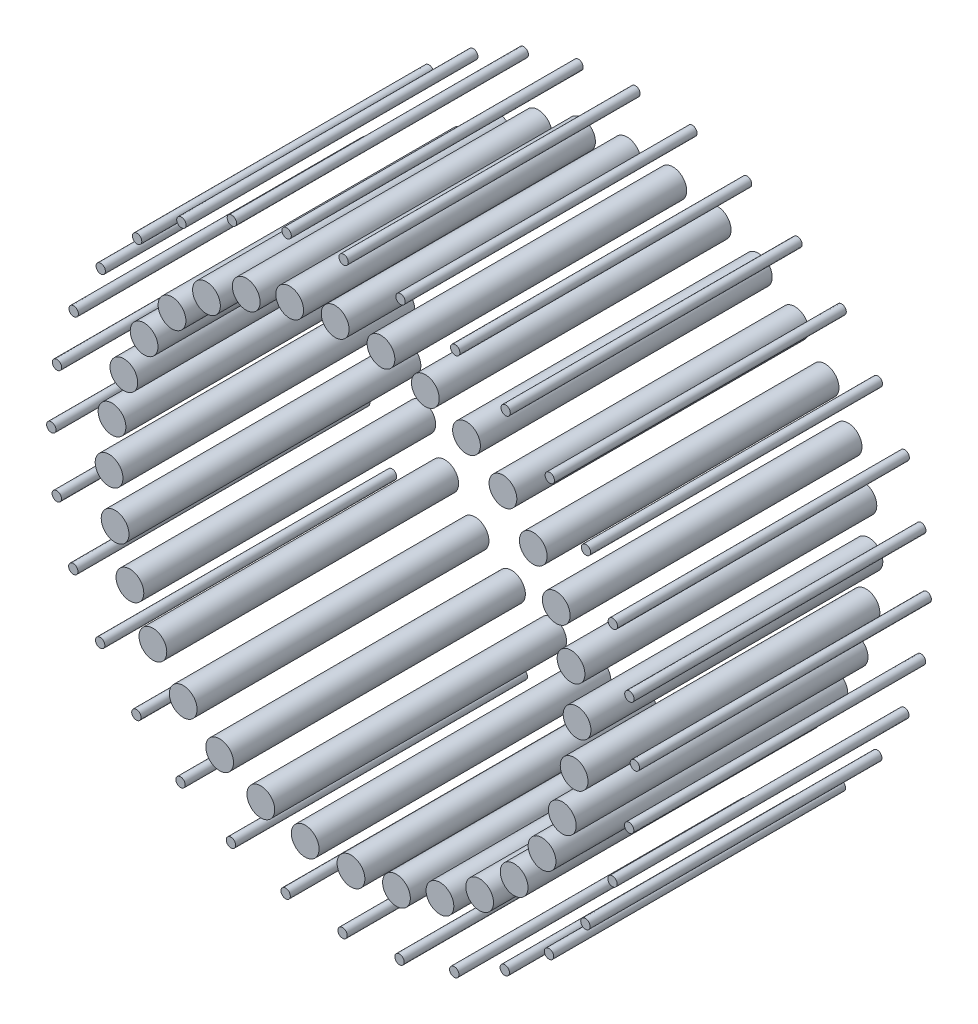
ISO-10303-21;
HEADER;
FILE_DESCRIPTION(('STEP AP214'),'2;1');
FILE_NAME('part.step','',(''),(''),'','','');
FILE_SCHEMA(('AUTOMOTIVE_DESIGN { 1 0 10303 214 1 1 1 1 }'));
ENDSEC;
DATA;
#1=APPLICATION_CONTEXT('core data for automotive mechanical design processes');
#2=APPLICATION_PROTOCOL_DEFINITION('international standard','automotive_design',2000,#1);
#3=PRODUCT_CONTEXT('',#1,'mechanical');
#4=PRODUCT('Part','Part','',(#3));
#5=PRODUCT_RELATED_PRODUCT_CATEGORY('part','',(#4));
#6=PRODUCT_DEFINITION_FORMATION('','',#4);
#7=PRODUCT_DEFINITION_CONTEXT('part definition',#1,'design');
#8=PRODUCT_DEFINITION('design','',#6,#7);
#9=PRODUCT_DEFINITION_SHAPE('','',#8);
#10=(LENGTH_UNIT() NAMED_UNIT(*) SI_UNIT(.MILLI.,.METRE.));
#11=(NAMED_UNIT(*) PLANE_ANGLE_UNIT() SI_UNIT($,.RADIAN.));
#12=(NAMED_UNIT(*) SI_UNIT($,.STERADIAN.) SOLID_ANGLE_UNIT());
#13=UNCERTAINTY_MEASURE_WITH_UNIT(LENGTH_MEASURE(1.E-05),#10,'distance_accuracy_value','');
#14=(GEOMETRIC_REPRESENTATION_CONTEXT(3) GLOBAL_UNCERTAINTY_ASSIGNED_CONTEXT((#13)) GLOBAL_UNIT_ASSIGNED_CONTEXT((#10,
#11,#12)) REPRESENTATION_CONTEXT('',''));
#15=CARTESIAN_POINT('',(0.,0.,0.));
#16=DIRECTION('',(0.,0.,1.));
#17=DIRECTION('',(1.,0.,0.));
#18=AXIS2_PLACEMENT_3D('',#15,#16,#17);
#19=CARTESIAN_POINT('',(-116.992229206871,162.897016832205,283.632279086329));
#20=DIRECTION('',(0.,0.,-1.));
#21=DIRECTION('',(-0.980785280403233,-0.195090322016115,0.));
#22=AXIS2_PLACEMENT_3D('',#19,#20,#21);
#23=CYLINDRICAL_SURFACE('',#22,11.8908063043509);
#24=CARTESIAN_POINT('',(-116.992229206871,162.897016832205,0.));
#25=DIRECTION('',(0.,0.,1.));
#26=DIRECTION('',(0.980785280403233,0.195090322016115,0.));
#27=AXIS2_PLACEMENT_3D('',#24,#25,#26);
#28=CIRCLE('',#27,11.8908063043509);
#29=CARTESIAN_POINT('',(-105.329901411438,165.216798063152,0.));
#30=VERTEX_POINT('',#29);
#31=EDGE_CURVE('E55',#30,#30,#28,.T.);
#32=ORIENTED_EDGE('',*,*,#31,.T.);
#33=EDGE_LOOP('',(#32));
#34=FACE_BOUND('',#33,.T.);
#35=CARTESIAN_POINT('',(-116.992229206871,162.897016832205,250.));
#36=DIRECTION('',(0.,0.,1.));
#37=DIRECTION('',(0.980785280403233,0.195090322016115,0.));
#38=AXIS2_PLACEMENT_3D('',#35,#36,#37);
#39=CIRCLE('',#38,11.8908063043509);
#40=CARTESIAN_POINT('',(-105.329901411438,165.216798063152,250.));
#41=VERTEX_POINT('',#40);
#42=EDGE_CURVE('E11',#41,#41,#39,.T.);
#43=ORIENTED_EDGE('',*,*,#42,.F.);
#44=EDGE_LOOP('',(#43));
#45=FACE_BOUND('',#44,.T.);
#46=ADVANCED_FACE('F48',(#34,#45),#23,.T.);
#47=CARTESIAN_POINT('',(-116.992229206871,162.897016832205,0.));
#48=DIRECTION('',(0.,0.,1.));
#49=DIRECTION('',(0.980785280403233,0.195090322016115,0.));
#50=AXIS2_PLACEMENT_3D('',#47,#48,#49);
#51=PLANE('',#50);
#52=ORIENTED_EDGE('',*,*,#31,.F.);
#53=EDGE_LOOP('',(#52));
#54=FACE_BOUND('',#53,.T.);
#55=ADVANCED_FACE('F63',(#54),#51,.F.);
#56=CARTESIAN_POINT('',(0.,0.,250.));
#57=DIRECTION('',(0.,0.,1.));
#58=DIRECTION('',(0.980785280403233,0.195090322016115,0.));
#59=AXIS2_PLACEMENT_3D('',#56,#57,#58);
#60=PLANE('',#59);
#61=ORIENTED_EDGE('',*,*,#42,.T.);
#62=EDGE_LOOP('',(#61));
#63=FACE_BOUND('',#62,.T.);
#64=ADVANCED_FACE('F50',(#63),#60,.T.);
#65=CLOSED_SHELL('',(#46,#55,#64));
#66=MANIFOLD_SOLID_BREP('B2',#65);
#67=CARTESIAN_POINT('',(-146.523887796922,136.942944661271,283.632279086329));
#68=DIRECTION('',(0.,0.,-1.));
#69=DIRECTION('',(-0.923879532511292,-0.382683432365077,0.));
#70=AXIS2_PLACEMENT_3D('',#67,#68,#69);
#71=CYLINDRICAL_SURFACE('',#70,11.8908063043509);
#72=CARTESIAN_POINT('',(-146.523887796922,136.942944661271,0.));
#73=DIRECTION('',(0.,0.,1.));
#74=DIRECTION('',(0.923879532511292,0.382683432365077,0.));
#75=AXIS2_PLACEMENT_3D('',#72,#73,#74);
#76=CIRCLE('',#75,11.8908063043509);
#77=CARTESIAN_POINT('',(-135.538215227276,141.493359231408,0.));
#78=VERTEX_POINT('',#77);
#79=EDGE_CURVE('E106',#78,#78,#76,.T.);
#80=ORIENTED_EDGE('',*,*,#79,.T.);
#81=EDGE_LOOP('',(#80));
#82=FACE_BOUND('',#81,.T.);
#83=CARTESIAN_POINT('',(-146.523887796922,136.942944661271,250.));
#84=DIRECTION('',(0.,0.,1.));
#85=DIRECTION('',(0.923879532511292,0.382683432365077,0.));
#86=AXIS2_PLACEMENT_3D('',#83,#84,#85);
#87=CIRCLE('',#86,11.8908063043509);
#88=CARTESIAN_POINT('',(-135.538215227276,141.493359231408,250.));
#89=VERTEX_POINT('',#88);
#90=EDGE_CURVE('E47',#89,#89,#87,.T.);
#91=ORIENTED_EDGE('',*,*,#90,.F.);
#92=EDGE_LOOP('',(#91));
#93=FACE_BOUND('',#92,.T.);
#94=ADVANCED_FACE('F99',(#82,#93),#71,.T.);
#95=CARTESIAN_POINT('',(-146.523887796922,136.942944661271,0.));
#96=DIRECTION('',(0.,0.,1.));
#97=DIRECTION('',(0.923879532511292,0.382683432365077,0.));
#98=AXIS2_PLACEMENT_3D('',#95,#96,#97);
#99=PLANE('',#98);
#100=ORIENTED_EDGE('',*,*,#79,.F.);
#101=EDGE_LOOP('',(#100));
#102=FACE_BOUND('',#101,.T.);
#103=ADVANCED_FACE('F114',(#102),#99,.F.);
#104=CARTESIAN_POINT('',(0.,0.,250.));
#105=DIRECTION('',(0.,0.,1.));
#106=DIRECTION('',(0.923879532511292,0.382683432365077,0.));
#107=AXIS2_PLACEMENT_3D('',#104,#105,#106);
#108=PLANE('',#107);
#109=ORIENTED_EDGE('',*,*,#90,.T.);
#110=EDGE_LOOP('',(#109));
#111=FACE_BOUND('',#110,.T.);
#112=ADVANCED_FACE('F101',(#111),#108,.T.);
#113=CLOSED_SHELL('',(#94,#103,#112));
#114=MANIFOLD_SOLID_BREP('B6',#113);
#115=CARTESIAN_POINT('',(-170.42471555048,105.726231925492,283.632279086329));
#116=DIRECTION('',(0.,0.,-1.));
#117=DIRECTION('',(-0.831469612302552,-0.555570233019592,0.));
#118=AXIS2_PLACEMENT_3D('',#115,#116,#117);
#119=CYLINDRICAL_SURFACE('',#118,11.8908063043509);
#120=CARTESIAN_POINT('',(-170.42471555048,105.726231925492,0.));
#121=DIRECTION('',(0.,0.,1.));
#122=DIRECTION('',(0.831469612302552,0.555570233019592,0.));
#123=AXIS2_PLACEMENT_3D('',#120,#121,#122);
#124=CIRCLE('',#123,11.8908063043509);
#125=CARTESIAN_POINT('',(-160.537871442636,112.332409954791,0.));
#126=VERTEX_POINT('',#125);
#127=EDGE_CURVE('E157',#126,#126,#124,.T.);
#128=ORIENTED_EDGE('',*,*,#127,.T.);
#129=EDGE_LOOP('',(#128));
#130=FACE_BOUND('',#129,.T.);
#131=CARTESIAN_POINT('',(-170.42471555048,105.726231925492,250.));
#132=DIRECTION('',(0.,0.,1.));
#133=DIRECTION('',(0.831469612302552,0.555570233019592,0.));
#134=AXIS2_PLACEMENT_3D('',#131,#132,#133);
#135=CIRCLE('',#134,11.8908063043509);
#136=CARTESIAN_POINT('',(-160.537871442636,112.332409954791,250.));
#137=VERTEX_POINT('',#136);
#138=EDGE_CURVE('E98',#137,#137,#135,.T.);
#139=ORIENTED_EDGE('',*,*,#138,.F.);
#140=EDGE_LOOP('',(#139));
#141=FACE_BOUND('',#140,.T.);
#142=ADVANCED_FACE('F150',(#130,#141),#119,.T.);
#143=CARTESIAN_POINT('',(-170.42471555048,105.726231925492,0.));
#144=DIRECTION('',(0.,0.,1.));
#145=DIRECTION('',(0.831469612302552,0.555570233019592,0.));
#146=AXIS2_PLACEMENT_3D('',#143,#144,#145);
#147=PLANE('',#146);
#148=ORIENTED_EDGE('',*,*,#127,.F.);
#149=EDGE_LOOP('',(#148));
#150=FACE_BOUND('',#149,.T.);
#151=ADVANCED_FACE('F165',(#150),#147,.F.);
#152=CARTESIAN_POINT('',(0.,0.,250.));
#153=DIRECTION('',(0.,0.,1.));
#154=DIRECTION('',(0.831469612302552,0.555570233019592,0.));
#155=AXIS2_PLACEMENT_3D('',#152,#153,#154);
#156=PLANE('',#155);
#157=ORIENTED_EDGE('',*,*,#138,.T.);
#158=EDGE_LOOP('',(#157));
#159=FACE_BOUND('',#158,.T.);
#160=ADVANCED_FACE('F152',(#159),#156,.T.);
#161=CLOSED_SHELL('',(#142,#151,#160));
#162=MANIFOLD_SOLID_BREP('B42',#161);
#163=CARTESIAN_POINT('',(-187.776217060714,70.4465193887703,283.632279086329));
#164=DIRECTION('',(0.,0.,-1.));
#165=DIRECTION('',(-0.707106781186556,-0.707106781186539,0.));
#166=AXIS2_PLACEMENT_3D('',#163,#164,#165);
#167=CYLINDRICAL_SURFACE('',#166,11.8908063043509);
#168=CARTESIAN_POINT('',(-187.776217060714,70.4465193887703,0.));
#169=DIRECTION('',(0.,0.,1.));
#170=DIRECTION('',(0.707106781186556,0.707106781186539,0.));
#171=AXIS2_PLACEMENT_3D('',#168,#169,#170);
#172=CIRCLE('',#171,11.8908063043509);
#173=CARTESIAN_POINT('',(-179.368147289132,78.8545891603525,0.));
#174=VERTEX_POINT('',#173);
#175=EDGE_CURVE('E208',#174,#174,#172,.T.);
#176=ORIENTED_EDGE('',*,*,#175,.T.);
#177=EDGE_LOOP('',(#176));
#178=FACE_BOUND('',#177,.T.);
#179=CARTESIAN_POINT('',(-187.776217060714,70.4465193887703,250.));
#180=DIRECTION('',(0.,0.,1.));
#181=DIRECTION('',(0.707106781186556,0.707106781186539,0.));
#182=AXIS2_PLACEMENT_3D('',#179,#180,#181);
#183=CIRCLE('',#182,11.8908063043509);
#184=CARTESIAN_POINT('',(-179.368147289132,78.8545891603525,250.));
#185=VERTEX_POINT('',#184);
#186=EDGE_CURVE('E149',#185,#185,#183,.T.);
#187=ORIENTED_EDGE('',*,*,#186,.F.);
#188=EDGE_LOOP('',(#187));
#189=FACE_BOUND('',#188,.T.);
#190=ADVANCED_FACE('F201',(#178,#189),#167,.T.);
#191=CARTESIAN_POINT('',(-187.776217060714,70.4465193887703,0.));
#192=DIRECTION('',(0.,0.,1.));
#193=DIRECTION('',(0.707106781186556,0.707106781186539,0.));
#194=AXIS2_PLACEMENT_3D('',#191,#192,#193);
#195=PLANE('',#194);
#196=ORIENTED_EDGE('',*,*,#175,.F.);
#197=EDGE_LOOP('',(#196));
#198=FACE_BOUND('',#197,.T.);
#199=ADVANCED_FACE('F216',(#198),#195,.F.);
#200=CARTESIAN_POINT('',(0.,0.,250.));
#201=DIRECTION('',(0.,0.,1.));
#202=DIRECTION('',(0.707106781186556,0.707106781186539,0.));
#203=AXIS2_PLACEMENT_3D('',#200,#201,#202);
#204=PLANE('',#203);
#205=ORIENTED_EDGE('',*,*,#186,.T.);
#206=EDGE_LOOP('',(#205));
#207=FACE_BOUND('',#206,.T.);
#208=ADVANCED_FACE('F203',(#207),#204,.T.);
#209=CLOSED_SHELL('',(#190,#199,#208));
#210=MANIFOLD_SOLID_BREP('B93',#209);
#211=CARTESIAN_POINT('',(-197.911583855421,32.4595866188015,283.632279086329));
#212=DIRECTION('',(0.,0.,-1.));
#213=DIRECTION('',(-0.555570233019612,-0.831469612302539,0.));
#214=AXIS2_PLACEMENT_3D('',#211,#212,#213);
#215=CYLINDRICAL_SURFACE('',#214,11.8908063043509);
#216=CARTESIAN_POINT('',(-197.911583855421,32.4595866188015,0.));
#217=DIRECTION('',(0.,0.,1.));
#218=DIRECTION('',(0.555570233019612,0.831469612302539,0.));
#219=AXIS2_PLACEMENT_3D('',#216,#217,#218);
#220=CIRCLE('',#219,11.8908063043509);
#221=CARTESIAN_POINT('',(-191.305405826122,42.3464307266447,0.));
#222=VERTEX_POINT('',#221);
#223=EDGE_CURVE('E259',#222,#222,#220,.T.);
#224=ORIENTED_EDGE('',*,*,#223,.T.);
#225=EDGE_LOOP('',(#224));
#226=FACE_BOUND('',#225,.T.);
#227=CARTESIAN_POINT('',(-197.911583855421,32.4595866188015,250.));
#228=DIRECTION('',(0.,0.,1.));
#229=DIRECTION('',(0.555570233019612,0.831469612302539,0.));
#230=AXIS2_PLACEMENT_3D('',#227,#228,#229);
#231=CIRCLE('',#230,11.8908063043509);
#232=CARTESIAN_POINT('',(-191.305405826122,42.3464307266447,250.));
#233=VERTEX_POINT('',#232);
#234=EDGE_CURVE('E200',#233,#233,#231,.T.);
#235=ORIENTED_EDGE('',*,*,#234,.F.);
#236=EDGE_LOOP('',(#235));
#237=FACE_BOUND('',#236,.T.);
#238=ADVANCED_FACE('F252',(#226,#237),#215,.T.);
#239=CARTESIAN_POINT('',(-197.911583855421,32.4595866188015,0.));
#240=DIRECTION('',(0.,0.,1.));
#241=DIRECTION('',(0.555570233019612,0.831469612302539,0.));
#242=AXIS2_PLACEMENT_3D('',#239,#240,#241);
#243=PLANE('',#242);
#244=ORIENTED_EDGE('',*,*,#223,.F.);
#245=EDGE_LOOP('',(#244));
#246=FACE_BOUND('',#245,.T.);
#247=ADVANCED_FACE('F267',(#246),#243,.F.);
#248=CARTESIAN_POINT('',(0.,0.,250.));
#249=DIRECTION('',(0.,0.,1.));
#250=DIRECTION('',(0.555570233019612,0.831469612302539,0.));
#251=AXIS2_PLACEMENT_3D('',#248,#249,#250);
#252=PLANE('',#251);
#253=ORIENTED_EDGE('',*,*,#234,.T.);
#254=EDGE_LOOP('',(#253));
#255=FACE_BOUND('',#254,.T.);
#256=ADVANCED_FACE('F254',(#255),#252,.T.);
#257=CLOSED_SHELL('',(#238,#247,#256));
#258=MANIFOLD_SOLID_BREP('B144',#257);
#259=CARTESIAN_POINT('',(-200.441319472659,-6.77474986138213,283.632279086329));
#260=DIRECTION('',(0.,0.,-1.));
#261=DIRECTION('',(-0.3826834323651,-0.923879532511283,0.));
#262=AXIS2_PLACEMENT_3D('',#259,#260,#261);
#263=CYLINDRICAL_SURFACE('',#262,11.8908063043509);
#264=CARTESIAN_POINT('',(-200.441319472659,-6.77474986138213,0.));
#265=DIRECTION('',(0.,0.,1.));
#266=DIRECTION('',(0.3826834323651,0.923879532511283,0.));
#267=AXIS2_PLACEMENT_3D('',#264,#265,#266);
#268=CIRCLE('',#267,11.8908063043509);
#269=CARTESIAN_POINT('',(-195.890904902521,4.2109227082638,0.));
#270=VERTEX_POINT('',#269);
#271=EDGE_CURVE('E310',#270,#270,#268,.T.);
#272=ORIENTED_EDGE('',*,*,#271,.T.);
#273=EDGE_LOOP('',(#272));
#274=FACE_BOUND('',#273,.T.);
#275=CARTESIAN_POINT('',(-200.441319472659,-6.77474986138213,250.));
#276=DIRECTION('',(0.,0.,1.));
#277=DIRECTION('',(0.3826834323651,0.923879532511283,0.));
#278=AXIS2_PLACEMENT_3D('',#275,#276,#277);
#279=CIRCLE('',#278,11.8908063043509);
#280=CARTESIAN_POINT('',(-195.890904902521,4.2109227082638,250.));
#281=VERTEX_POINT('',#280);
#282=EDGE_CURVE('E251',#281,#281,#279,.T.);
#283=ORIENTED_EDGE('',*,*,#282,.F.);
#284=EDGE_LOOP('',(#283));
#285=FACE_BOUND('',#284,.T.);
#286=ADVANCED_FACE('F303',(#274,#285),#263,.T.);
#287=CARTESIAN_POINT('',(-200.441319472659,-6.77474986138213,0.));
#288=DIRECTION('',(0.,0.,1.));
#289=DIRECTION('',(0.3826834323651,0.923879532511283,0.));
#290=AXIS2_PLACEMENT_3D('',#287,#288,#289);
#291=PLANE('',#290);
#292=ORIENTED_EDGE('',*,*,#271,.F.);
#293=EDGE_LOOP('',(#292));
#294=FACE_BOUND('',#293,.T.);
#295=ADVANCED_FACE('F318',(#294),#291,.F.);
#296=CARTESIAN_POINT('',(0.,0.,250.));
#297=DIRECTION('',(0.,0.,1.));
#298=DIRECTION('',(0.3826834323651,0.923879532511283,0.));
#299=AXIS2_PLACEMENT_3D('',#296,#297,#298);
#300=PLANE('',#299);
#301=ORIENTED_EDGE('',*,*,#282,.T.);
#302=EDGE_LOOP('',(#301));
#303=FACE_BOUND('',#302,.T.);
#304=ADVANCED_FACE('F305',(#303),#300,.T.);
#305=CLOSED_SHELL('',(#286,#295,#304));
#306=MANIFOLD_SOLID_BREP('B195',#305);
#307=CARTESIAN_POINT('',(-195.26820759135,-45.7487365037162,283.632279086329));
#308=DIRECTION('',(0.,0.,-1.));
#309=DIRECTION('',(-0.195090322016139,-0.980785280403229,0.));
#310=AXIS2_PLACEMENT_3D('',#307,#308,#309);
#311=CYLINDRICAL_SURFACE('',#310,11.8908063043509);
#312=CARTESIAN_POINT('',(-195.26820759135,-45.7487365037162,0.));
#313=DIRECTION('',(0.,0.,1.));
#314=DIRECTION('',(0.195090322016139,0.980785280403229,0.));
#315=AXIS2_PLACEMENT_3D('',#312,#313,#314);
#316=CIRCLE('',#315,11.8908063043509);
#317=CARTESIAN_POINT('',(-192.948426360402,-34.0864087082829,0.));
#318=VERTEX_POINT('',#317);
#319=EDGE_CURVE('E361',#318,#318,#316,.T.);
#320=ORIENTED_EDGE('',*,*,#319,.T.);
#321=EDGE_LOOP('',(#320));
#322=FACE_BOUND('',#321,.T.);
#323=CARTESIAN_POINT('',(-195.26820759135,-45.7487365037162,250.));
#324=DIRECTION('',(0.,0.,1.));
#325=DIRECTION('',(0.195090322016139,0.980785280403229,0.));
#326=AXIS2_PLACEMENT_3D('',#323,#324,#325);
#327=CIRCLE('',#326,11.8908063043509);
#328=CARTESIAN_POINT('',(-192.948426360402,-34.0864087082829,250.));
#329=VERTEX_POINT('',#328);
#330=EDGE_CURVE('E302',#329,#329,#327,.T.);
#331=ORIENTED_EDGE('',*,*,#330,.F.);
#332=EDGE_LOOP('',(#331));
#333=FACE_BOUND('',#332,.T.);
#334=ADVANCED_FACE('F354',(#322,#333),#311,.T.);
#335=CARTESIAN_POINT('',(-195.26820759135,-45.7487365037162,0.));
#336=DIRECTION('',(0.,0.,1.));
#337=DIRECTION('',(0.195090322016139,0.980785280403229,0.));
#338=AXIS2_PLACEMENT_3D('',#335,#336,#337);
#339=PLANE('',#338);
#340=ORIENTED_EDGE('',*,*,#319,.F.);
#341=EDGE_LOOP('',(#340));
#342=FACE_BOUND('',#341,.T.);
#343=ADVANCED_FACE('F369',(#342),#339,.F.);
#344=CARTESIAN_POINT('',(0.,0.,250.));
#345=DIRECTION('',(0.,0.,1.));
#346=DIRECTION('',(0.195090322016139,0.980785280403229,0.));
#347=AXIS2_PLACEMENT_3D('',#344,#345,#346);
#348=PLANE('',#347);
#349=ORIENTED_EDGE('',*,*,#330,.T.);
#350=EDGE_LOOP('',(#349));
#351=FACE_BOUND('',#350,.T.);
#352=ADVANCED_FACE('F356',(#351),#348,.T.);
#353=CLOSED_SHELL('',(#334,#343,#352));
#354=MANIFOLD_SOLID_BREP('B246',#353);
#355=CARTESIAN_POINT('',(-182.591047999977,-82.9646248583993,283.632279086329));
#356=DIRECTION('',(0.,0.,-1.));
#357=DIRECTION('',(0.,-1.,0.));
#358=AXIS2_PLACEMENT_3D('',#355,#356,#357);
#359=CYLINDRICAL_SURFACE('',#358,11.8908063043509);
#360=CARTESIAN_POINT('',(-182.591047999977,-82.9646248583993,0.));
#361=DIRECTION('',(0.,0.,1.));
#362=DIRECTION('',(0.,1.,0.));
#363=AXIS2_PLACEMENT_3D('',#360,#361,#362);
#364=CIRCLE('',#363,11.8908063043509);
#365=CARTESIAN_POINT('',(-182.591047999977,-71.0738185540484,0.));
#366=VERTEX_POINT('',#365);
#367=EDGE_CURVE('E412',#366,#366,#364,.T.);
#368=ORIENTED_EDGE('',*,*,#367,.T.);
#369=EDGE_LOOP('',(#368));
#370=FACE_BOUND('',#369,.T.);
#371=CARTESIAN_POINT('',(-182.591047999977,-82.9646248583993,250.));
#372=DIRECTION('',(0.,0.,1.));
#373=DIRECTION('',(0.,1.,0.));
#374=AXIS2_PLACEMENT_3D('',#371,#372,#373);
#375=CIRCLE('',#374,11.8908063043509);
#376=CARTESIAN_POINT('',(-182.591047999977,-71.0738185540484,250.));
#377=VERTEX_POINT('',#376);
#378=EDGE_CURVE('E353',#377,#377,#375,.T.);
#379=ORIENTED_EDGE('',*,*,#378,.F.);
#380=EDGE_LOOP('',(#379));
#381=FACE_BOUND('',#380,.T.);
#382=ADVANCED_FACE('F405',(#370,#381),#359,.T.);
#383=CARTESIAN_POINT('',(-182.591047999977,-82.9646248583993,0.));
#384=DIRECTION('',(0.,0.,1.));
#385=DIRECTION('',(0.,1.,0.));
#386=AXIS2_PLACEMENT_3D('',#383,#384,#385);
#387=PLANE('',#386);
#388=ORIENTED_EDGE('',*,*,#367,.F.);
#389=EDGE_LOOP('',(#388));
#390=FACE_BOUND('',#389,.T.);
#391=ADVANCED_FACE('F420',(#390),#387,.F.);
#392=CARTESIAN_POINT('',(0.,0.,250.));
#393=DIRECTION('',(0.,0.,1.));
#394=DIRECTION('',(0.,1.,0.));
#395=AXIS2_PLACEMENT_3D('',#392,#393,#394);
#396=PLANE('',#395);
#397=ORIENTED_EDGE('',*,*,#378,.T.);
#398=EDGE_LOOP('',(#397));
#399=FACE_BOUND('',#398,.T.);
#400=ADVANCED_FACE('F407',(#399),#396,.T.);
#401=CLOSED_SHELL('',(#382,#391,#400));
#402=MANIFOLD_SOLID_BREP('B297',#401);
#403=CARTESIAN_POINT('',(-162.897016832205,-116.992229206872,283.632279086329));
#404=DIRECTION('',(0.,0.,-1.));
#405=DIRECTION('',(0.195090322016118,-0.980785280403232,0.));
#406=AXIS2_PLACEMENT_3D('',#403,#404,#405);
#407=CYLINDRICAL_SURFACE('',#406,11.8908063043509);
#408=CARTESIAN_POINT('',(-162.897016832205,-116.992229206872,0.));
#409=DIRECTION('',(0.,0.,1.));
#410=DIRECTION('',(-0.195090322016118,0.980785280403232,0.));
#411=AXIS2_PLACEMENT_3D('',#408,#409,#410);
#412=CIRCLE('',#411,11.8908063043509);
#413=CARTESIAN_POINT('',(-165.216798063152,-105.329901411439,0.));
#414=VERTEX_POINT('',#413);
#415=EDGE_CURVE('E463',#414,#414,#412,.T.);
#416=ORIENTED_EDGE('',*,*,#415,.T.);
#417=EDGE_LOOP('',(#416));
#418=FACE_BOUND('',#417,.T.);
#419=CARTESIAN_POINT('',(-162.897016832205,-116.992229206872,250.));
#420=DIRECTION('',(0.,0.,1.));
#421=DIRECTION('',(-0.195090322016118,0.980785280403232,0.));
#422=AXIS2_PLACEMENT_3D('',#419,#420,#421);
#423=CIRCLE('',#422,11.8908063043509);
#424=CARTESIAN_POINT('',(-165.216798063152,-105.329901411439,250.));
#425=VERTEX_POINT('',#424);
#426=EDGE_CURVE('E404',#425,#425,#423,.T.);
#427=ORIENTED_EDGE('',*,*,#426,.F.);
#428=EDGE_LOOP('',(#427));
#429=FACE_BOUND('',#428,.T.);
#430=ADVANCED_FACE('F456',(#418,#429),#407,.T.);
#431=CARTESIAN_POINT('',(-162.897016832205,-116.992229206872,0.));
#432=DIRECTION('',(0.,0.,1.));
#433=DIRECTION('',(-0.195090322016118,0.980785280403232,0.));
#434=AXIS2_PLACEMENT_3D('',#431,#432,#433);
#435=PLANE('',#434);
#436=ORIENTED_EDGE('',*,*,#415,.F.);
#437=EDGE_LOOP('',(#436));
#438=FACE_BOUND('',#437,.T.);
#439=ADVANCED_FACE('F471',(#438),#435,.F.);
#440=CARTESIAN_POINT('',(0.,0.,250.));
#441=DIRECTION('',(0.,0.,1.));
#442=DIRECTION('',(-0.195090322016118,0.980785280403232,0.));
#443=AXIS2_PLACEMENT_3D('',#440,#441,#442);
#444=PLANE('',#443);
#445=ORIENTED_EDGE('',*,*,#426,.T.);
#446=EDGE_LOOP('',(#445));
#447=FACE_BOUND('',#446,.T.);
#448=ADVANCED_FACE('F458',(#447),#444,.T.);
#449=CLOSED_SHELL('',(#430,#439,#448));
#450=MANIFOLD_SOLID_BREP('B348',#449);
#451=CARTESIAN_POINT('',(-136.94294466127,-146.523887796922,283.632279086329));
#452=DIRECTION('',(0.,0.,-1.));
#453=DIRECTION('',(0.382683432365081,-0.923879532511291,0.));
#454=AXIS2_PLACEMENT_3D('',#451,#452,#453);
#455=CYLINDRICAL_SURFACE('',#454,11.8908063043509);
#456=CARTESIAN_POINT('',(-136.94294466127,-146.523887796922,0.));
#457=DIRECTION('',(0.,0.,1.));
#458=DIRECTION('',(-0.382683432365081,0.923879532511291,0.));
#459=AXIS2_PLACEMENT_3D('',#456,#457,#458);
#460=CIRCLE('',#459,11.8908063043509);
#461=CARTESIAN_POINT('',(-141.493359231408,-135.538215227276,0.));
#462=VERTEX_POINT('',#461);
#463=EDGE_CURVE('E514',#462,#462,#460,.T.);
#464=ORIENTED_EDGE('',*,*,#463,.T.);
#465=EDGE_LOOP('',(#464));
#466=FACE_BOUND('',#465,.T.);
#467=CARTESIAN_POINT('',(-136.94294466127,-146.523887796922,250.));
#468=DIRECTION('',(0.,0.,1.));
#469=DIRECTION('',(-0.382683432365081,0.923879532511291,0.));
#470=AXIS2_PLACEMENT_3D('',#467,#468,#469);
#471=CIRCLE('',#470,11.8908063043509);
#472=CARTESIAN_POINT('',(-141.493359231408,-135.538215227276,250.));
#473=VERTEX_POINT('',#472);
#474=EDGE_CURVE('E455',#473,#473,#471,.T.);
#475=ORIENTED_EDGE('',*,*,#474,.F.);
#476=EDGE_LOOP('',(#475));
#477=FACE_BOUND('',#476,.T.);
#478=ADVANCED_FACE('F507',(#466,#477),#455,.T.);
#479=CARTESIAN_POINT('',(-136.94294466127,-146.523887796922,0.));
#480=DIRECTION('',(0.,0.,1.));
#481=DIRECTION('',(-0.382683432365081,0.923879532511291,0.));
#482=AXIS2_PLACEMENT_3D('',#479,#480,#481);
#483=PLANE('',#482);
#484=ORIENTED_EDGE('',*,*,#463,.F.);
#485=EDGE_LOOP('',(#484));
#486=FACE_BOUND('',#485,.T.);
#487=ADVANCED_FACE('F522',(#486),#483,.F.);
#488=CARTESIAN_POINT('',(0.,0.,250.));
#489=DIRECTION('',(0.,0.,1.));
#490=DIRECTION('',(-0.382683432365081,0.923879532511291,0.));
#491=AXIS2_PLACEMENT_3D('',#488,#489,#490);
#492=PLANE('',#491);
#493=ORIENTED_EDGE('',*,*,#474,.T.);
#494=EDGE_LOOP('',(#493));
#495=FACE_BOUND('',#494,.T.);
#496=ADVANCED_FACE('F509',(#495),#492,.T.);
#497=CLOSED_SHELL('',(#478,#487,#496));
#498=MANIFOLD_SOLID_BREP('B399',#497);
#499=CARTESIAN_POINT('',(-105.726231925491,-170.42471555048,283.632279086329));
#500=DIRECTION('',(0.,0.,-1.));
#501=DIRECTION('',(0.555570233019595,-0.83146961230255,0.));
#502=AXIS2_PLACEMENT_3D('',#499,#500,#501);
#503=CYLINDRICAL_SURFACE('',#502,11.8908063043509);
#504=CARTESIAN_POINT('',(-105.726231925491,-170.42471555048,0.));
#505=DIRECTION('',(0.,0.,1.));
#506=DIRECTION('',(-0.555570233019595,0.83146961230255,0.));
#507=AXIS2_PLACEMENT_3D('',#504,#505,#506);
#508=CIRCLE('',#507,11.8908063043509);
#509=CARTESIAN_POINT('',(-112.33240995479,-160.537871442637,0.));
#510=VERTEX_POINT('',#509);
#511=EDGE_CURVE('E565',#510,#510,#508,.T.);
#512=ORIENTED_EDGE('',*,*,#511,.T.);
#513=EDGE_LOOP('',(#512));
#514=FACE_BOUND('',#513,.T.);
#515=CARTESIAN_POINT('',(-105.726231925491,-170.42471555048,250.));
#516=DIRECTION('',(0.,0.,1.));
#517=DIRECTION('',(-0.555570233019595,0.83146961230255,0.));
#518=AXIS2_PLACEMENT_3D('',#515,#516,#517);
#519=CIRCLE('',#518,11.8908063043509);
#520=CARTESIAN_POINT('',(-112.33240995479,-160.537871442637,250.));
#521=VERTEX_POINT('',#520);
#522=EDGE_CURVE('E506',#521,#521,#519,.T.);
#523=ORIENTED_EDGE('',*,*,#522,.F.);
#524=EDGE_LOOP('',(#523));
#525=FACE_BOUND('',#524,.T.);
#526=ADVANCED_FACE('F558',(#514,#525),#503,.T.);
#527=CARTESIAN_POINT('',(-105.726231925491,-170.42471555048,0.));
#528=DIRECTION('',(0.,0.,1.));
#529=DIRECTION('',(-0.555570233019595,0.83146961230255,0.));
#530=AXIS2_PLACEMENT_3D('',#527,#528,#529);
#531=PLANE('',#530);
#532=ORIENTED_EDGE('',*,*,#511,.F.);
#533=EDGE_LOOP('',(#532));
#534=FACE_BOUND('',#533,.T.);
#535=ADVANCED_FACE('F573',(#534),#531,.F.);
#536=CARTESIAN_POINT('',(0.,0.,250.));
#537=DIRECTION('',(0.,0.,1.));
#538=DIRECTION('',(-0.555570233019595,0.83146961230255,0.));
#539=AXIS2_PLACEMENT_3D('',#536,#537,#538);
#540=PLANE('',#539);
#541=ORIENTED_EDGE('',*,*,#522,.T.);
#542=EDGE_LOOP('',(#541));
#543=FACE_BOUND('',#542,.T.);
#544=ADVANCED_FACE('F560',(#543),#540,.T.);
#545=CLOSED_SHELL('',(#526,#535,#544));
#546=MANIFOLD_SOLID_BREP('B450',#545);
#547=CARTESIAN_POINT('',(-70.4465193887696,-187.776217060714,283.632279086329));
#548=DIRECTION('',(0.,0.,-1.));
#549=DIRECTION('',(0.707106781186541,-0.707106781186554,0.));
#550=AXIS2_PLACEMENT_3D('',#547,#548,#549);
#551=CYLINDRICAL_SURFACE('',#550,11.8908063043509);
#552=CARTESIAN_POINT('',(-70.4465193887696,-187.776217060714,0.));
#553=DIRECTION('',(0.,0.,1.));
#554=DIRECTION('',(-0.707106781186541,0.707106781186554,0.));
#555=AXIS2_PLACEMENT_3D('',#552,#553,#554);
#556=CIRCLE('',#555,11.8908063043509);
#557=CARTESIAN_POINT('',(-78.8545891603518,-179.368147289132,0.));
#558=VERTEX_POINT('',#557);
#559=EDGE_CURVE('E616',#558,#558,#556,.T.);
#560=ORIENTED_EDGE('',*,*,#559,.T.);
#561=EDGE_LOOP('',(#560));
#562=FACE_BOUND('',#561,.T.);
#563=CARTESIAN_POINT('',(-70.4465193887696,-187.776217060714,250.));
#564=DIRECTION('',(0.,0.,1.));
#565=DIRECTION('',(-0.707106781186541,0.707106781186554,0.));
#566=AXIS2_PLACEMENT_3D('',#563,#564,#565);
#567=CIRCLE('',#566,11.8908063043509);
#568=CARTESIAN_POINT('',(-78.8545891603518,-179.368147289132,250.));
#569=VERTEX_POINT('',#568);
#570=EDGE_CURVE('E557',#569,#569,#567,.T.);
#571=ORIENTED_EDGE('',*,*,#570,.F.);
#572=EDGE_LOOP('',(#571));
#573=FACE_BOUND('',#572,.T.);
#574=ADVANCED_FACE('F609',(#562,#573),#551,.T.);
#575=CARTESIAN_POINT('',(-70.4465193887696,-187.776217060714,0.));
#576=DIRECTION('',(0.,0.,1.));
#577=DIRECTION('',(-0.707106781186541,0.707106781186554,0.));
#578=AXIS2_PLACEMENT_3D('',#575,#576,#577);
#579=PLANE('',#578);
#580=ORIENTED_EDGE('',*,*,#559,.F.);
#581=EDGE_LOOP('',(#580));
#582=FACE_BOUND('',#581,.T.);
#583=ADVANCED_FACE('F624',(#582),#579,.F.);
#584=CARTESIAN_POINT('',(0.,0.,250.));
#585=DIRECTION('',(0.,0.,1.));
#586=DIRECTION('',(-0.707106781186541,0.707106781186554,0.));
#587=AXIS2_PLACEMENT_3D('',#584,#585,#586);
#588=PLANE('',#587);
#589=ORIENTED_EDGE('',*,*,#570,.T.);
#590=EDGE_LOOP('',(#589));
#591=FACE_BOUND('',#590,.T.);
#592=ADVANCED_FACE('F611',(#591),#588,.T.);
#593=CLOSED_SHELL('',(#574,#583,#592));
#594=MANIFOLD_SOLID_BREP('B501',#593);
#595=CARTESIAN_POINT('',(-32.4595866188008,-197.911583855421,283.632279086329));
#596=DIRECTION('',(0.,0.,-1.));
#597=DIRECTION('',(0.831469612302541,-0.555570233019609,0.));
#598=AXIS2_PLACEMENT_3D('',#595,#596,#597);
#599=CYLINDRICAL_SURFACE('',#598,11.8908063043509);
#600=CARTESIAN_POINT('',(-32.4595866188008,-197.911583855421,0.));
#601=DIRECTION('',(0.,0.,1.));
#602=DIRECTION('',(-0.831469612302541,0.555570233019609,0.));
#603=AXIS2_PLACEMENT_3D('',#600,#601,#602);
#604=CIRCLE('',#603,11.8908063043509);
#605=CARTESIAN_POINT('',(-42.3464307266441,-191.305405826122,0.));
#606=VERTEX_POINT('',#605);
#607=EDGE_CURVE('E667',#606,#606,#604,.T.);
#608=ORIENTED_EDGE('',*,*,#607,.T.);
#609=EDGE_LOOP('',(#608));
#610=FACE_BOUND('',#609,.T.);
#611=CARTESIAN_POINT('',(-32.4595866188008,-197.911583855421,250.));
#612=DIRECTION('',(0.,0.,1.));
#613=DIRECTION('',(-0.831469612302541,0.555570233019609,0.));
#614=AXIS2_PLACEMENT_3D('',#611,#612,#613);
#615=CIRCLE('',#614,11.8908063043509);
#616=CARTESIAN_POINT('',(-42.3464307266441,-191.305405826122,250.));
#617=VERTEX_POINT('',#616);
#618=EDGE_CURVE('E608',#617,#617,#615,.T.);
#619=ORIENTED_EDGE('',*,*,#618,.F.);
#620=EDGE_LOOP('',(#619));
#621=FACE_BOUND('',#620,.T.);
#622=ADVANCED_FACE('F660',(#610,#621),#599,.T.);
#623=CARTESIAN_POINT('',(-32.4595866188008,-197.911583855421,0.));
#624=DIRECTION('',(0.,0.,1.));
#625=DIRECTION('',(-0.831469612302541,0.555570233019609,0.));
#626=AXIS2_PLACEMENT_3D('',#623,#624,#625);
#627=PLANE('',#626);
#628=ORIENTED_EDGE('',*,*,#607,.F.);
#629=EDGE_LOOP('',(#628));
#630=FACE_BOUND('',#629,.T.);
#631=ADVANCED_FACE('F675',(#630),#627,.F.);
#632=CARTESIAN_POINT('',(0.,0.,250.));
#633=DIRECTION('',(0.,0.,1.));
#634=DIRECTION('',(-0.831469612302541,0.555570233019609,0.));
#635=AXIS2_PLACEMENT_3D('',#632,#633,#634);
#636=PLANE('',#635);
#637=ORIENTED_EDGE('',*,*,#618,.T.);
#638=EDGE_LOOP('',(#637));
#639=FACE_BOUND('',#638,.T.);
#640=ADVANCED_FACE('F662',(#639),#636,.T.);
#641=CLOSED_SHELL('',(#622,#631,#640));
#642=MANIFOLD_SOLID_BREP('B552',#641);
#643=CARTESIAN_POINT('',(6.77474986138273,-200.441319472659,283.632279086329));
#644=DIRECTION('',(0.,0.,-1.));
#645=DIRECTION('',(0.923879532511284,-0.382683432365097,0.));
#646=AXIS2_PLACEMENT_3D('',#643,#644,#645);
#647=CYLINDRICAL_SURFACE('',#646,11.8908063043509);
#648=CARTESIAN_POINT('',(6.77474986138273,-200.441319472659,0.));
#649=DIRECTION('',(0.,0.,1.));
#650=DIRECTION('',(-0.923879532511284,0.382683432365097,0.));
#651=AXIS2_PLACEMENT_3D('',#648,#649,#650);
#652=CIRCLE('',#651,11.8908063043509);
#653=CARTESIAN_POINT('',(-4.21092270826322,-195.890904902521,0.));
#654=VERTEX_POINT('',#653);
#655=EDGE_CURVE('E718',#654,#654,#652,.T.);
#656=ORIENTED_EDGE('',*,*,#655,.T.);
#657=EDGE_LOOP('',(#656));
#658=FACE_BOUND('',#657,.T.);
#659=CARTESIAN_POINT('',(6.77474986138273,-200.441319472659,250.));
#660=DIRECTION('',(0.,0.,1.));
#661=DIRECTION('',(-0.923879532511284,0.382683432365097,0.));
#662=AXIS2_PLACEMENT_3D('',#659,#660,#661);
#663=CIRCLE('',#662,11.8908063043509);
#664=CARTESIAN_POINT('',(-4.21092270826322,-195.890904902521,250.));
#665=VERTEX_POINT('',#664);
#666=EDGE_CURVE('E659',#665,#665,#663,.T.);
#667=ORIENTED_EDGE('',*,*,#666,.F.);
#668=EDGE_LOOP('',(#667));
#669=FACE_BOUND('',#668,.T.);
#670=ADVANCED_FACE('F711',(#658,#669),#647,.T.);
#671=CARTESIAN_POINT('',(6.77474986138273,-200.441319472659,0.));
#672=DIRECTION('',(0.,0.,1.));
#673=DIRECTION('',(-0.923879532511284,0.382683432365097,0.));
#674=AXIS2_PLACEMENT_3D('',#671,#672,#673);
#675=PLANE('',#674);
#676=ORIENTED_EDGE('',*,*,#655,.F.);
#677=EDGE_LOOP('',(#676));
#678=FACE_BOUND('',#677,.T.);
#679=ADVANCED_FACE('F726',(#678),#675,.F.);
#680=CARTESIAN_POINT('',(0.,0.,250.));
#681=DIRECTION('',(0.,0.,1.));
#682=DIRECTION('',(-0.923879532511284,0.382683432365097,0.));
#683=AXIS2_PLACEMENT_3D('',#680,#681,#682);
#684=PLANE('',#683);
#685=ORIENTED_EDGE('',*,*,#666,.T.);
#686=EDGE_LOOP('',(#685));
#687=FACE_BOUND('',#686,.T.);
#688=ADVANCED_FACE('F713',(#687),#684,.T.);
#689=CLOSED_SHELL('',(#670,#679,#688));
#690=MANIFOLD_SOLID_BREP('B603',#689);
#691=CARTESIAN_POINT('',(45.7487365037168,-195.268207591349,283.632279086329));
#692=DIRECTION('',(0.,0.,-1.));
#693=DIRECTION('',(0.980785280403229,-0.195090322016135,0.));
#694=AXIS2_PLACEMENT_3D('',#691,#692,#693);
#695=CYLINDRICAL_SURFACE('',#694,11.8908063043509);
#696=CARTESIAN_POINT('',(45.7487365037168,-195.268207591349,0.));
#697=DIRECTION('',(0.,0.,1.));
#698=DIRECTION('',(-0.980785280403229,0.195090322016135,0.));
#699=AXIS2_PLACEMENT_3D('',#696,#697,#698);
#700=CIRCLE('',#699,11.8908063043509);
#701=CARTESIAN_POINT('',(34.0864087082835,-192.948426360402,0.));
#702=VERTEX_POINT('',#701);
#703=EDGE_CURVE('E769',#702,#702,#700,.T.);
#704=ORIENTED_EDGE('',*,*,#703,.T.);
#705=EDGE_LOOP('',(#704));
#706=FACE_BOUND('',#705,.T.);
#707=CARTESIAN_POINT('',(45.7487365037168,-195.268207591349,250.));
#708=DIRECTION('',(0.,0.,1.));
#709=DIRECTION('',(-0.980785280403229,0.195090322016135,0.));
#710=AXIS2_PLACEMENT_3D('',#707,#708,#709);
#711=CIRCLE('',#710,11.8908063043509);
#712=CARTESIAN_POINT('',(34.0864087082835,-192.948426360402,250.));
#713=VERTEX_POINT('',#712);
#714=EDGE_CURVE('E710',#713,#713,#711,.T.);
#715=ORIENTED_EDGE('',*,*,#714,.F.);
#716=EDGE_LOOP('',(#715));
#717=FACE_BOUND('',#716,.T.);
#718=ADVANCED_FACE('F762',(#706,#717),#695,.T.);
#719=CARTESIAN_POINT('',(45.7487365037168,-195.268207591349,0.));
#720=DIRECTION('',(0.,0.,1.));
#721=DIRECTION('',(-0.980785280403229,0.195090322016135,0.));
#722=AXIS2_PLACEMENT_3D('',#719,#720,#721);
#723=PLANE('',#722);
#724=ORIENTED_EDGE('',*,*,#703,.F.);
#725=EDGE_LOOP('',(#724));
#726=FACE_BOUND('',#725,.T.);
#727=ADVANCED_FACE('F777',(#726),#723,.F.);
#728=CARTESIAN_POINT('',(0.,0.,250.));
#729=DIRECTION('',(0.,0.,1.));
#730=DIRECTION('',(-0.980785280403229,0.195090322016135,0.));
#731=AXIS2_PLACEMENT_3D('',#728,#729,#730);
#732=PLANE('',#731);
#733=ORIENTED_EDGE('',*,*,#714,.T.);
#734=EDGE_LOOP('',(#733));
#735=FACE_BOUND('',#734,.T.);
#736=ADVANCED_FACE('F764',(#735),#732,.T.);
#737=CLOSED_SHELL('',(#718,#727,#736));
#738=MANIFOLD_SOLID_BREP('B654',#737);
#739=CARTESIAN_POINT('',(82.9646248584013,-182.591047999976,283.632279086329));
#740=DIRECTION('',(0.,0.,-1.));
#741=DIRECTION('',(1.,0.,0.));
#742=AXIS2_PLACEMENT_3D('',#739,#740,#741);
#743=CYLINDRICAL_SURFACE('',#742,11.8908063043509);
#744=CARTESIAN_POINT('',(82.9646248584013,-182.591047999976,0.));
#745=DIRECTION('',(0.,0.,1.));
#746=DIRECTION('',(-1.,0.,0.));
#747=AXIS2_PLACEMENT_3D('',#744,#745,#746);
#748=CIRCLE('',#747,11.8908063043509);
#749=CARTESIAN_POINT('',(71.0738185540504,-182.591047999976,0.));
#750=VERTEX_POINT('',#749);
#751=EDGE_CURVE('E820',#750,#750,#748,.T.);
#752=ORIENTED_EDGE('',*,*,#751,.T.);
#753=EDGE_LOOP('',(#752));
#754=FACE_BOUND('',#753,.T.);
#755=CARTESIAN_POINT('',(82.9646248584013,-182.591047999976,250.));
#756=DIRECTION('',(0.,0.,1.));
#757=DIRECTION('',(-1.,0.,0.));
#758=AXIS2_PLACEMENT_3D('',#755,#756,#757);
#759=CIRCLE('',#758,11.8908063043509);
#760=CARTESIAN_POINT('',(71.0738185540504,-182.591047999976,250.));
#761=VERTEX_POINT('',#760);
#762=EDGE_CURVE('E761',#761,#761,#759,.T.);
#763=ORIENTED_EDGE('',*,*,#762,.F.);
#764=EDGE_LOOP('',(#763));
#765=FACE_BOUND('',#764,.T.);
#766=ADVANCED_FACE('F813',(#754,#765),#743,.T.);
#767=CARTESIAN_POINT('',(82.9646248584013,-182.591047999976,0.));
#768=DIRECTION('',(0.,0.,1.));
#769=DIRECTION('',(-1.,0.,0.));
#770=AXIS2_PLACEMENT_3D('',#767,#768,#769);
#771=PLANE('',#770);
#772=ORIENTED_EDGE('',*,*,#751,.F.);
#773=EDGE_LOOP('',(#772));
#774=FACE_BOUND('',#773,.T.);
#775=ADVANCED_FACE('F828',(#774),#771,.F.);
#776=CARTESIAN_POINT('',(0.,0.,250.));
#777=DIRECTION('',(0.,0.,1.));
#778=DIRECTION('',(-1.,0.,0.));
#779=AXIS2_PLACEMENT_3D('',#776,#777,#778);
#780=PLANE('',#779);
#781=ORIENTED_EDGE('',*,*,#762,.T.);
#782=EDGE_LOOP('',(#781));
#783=FACE_BOUND('',#782,.T.);
#784=ADVANCED_FACE('F815',(#783),#780,.T.);
#785=CLOSED_SHELL('',(#766,#775,#784));
#786=MANIFOLD_SOLID_BREP('B705',#785);
#787=CARTESIAN_POINT('',(116.992229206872,-162.897016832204,283.632279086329));
#788=DIRECTION('',(0.,0.,-1.));
#789=DIRECTION('',(0.980785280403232,0.195090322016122,0.));
#790=AXIS2_PLACEMENT_3D('',#787,#788,#789);
#791=CYLINDRICAL_SURFACE('',#790,11.8908063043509);
#792=CARTESIAN_POINT('',(116.992229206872,-162.897016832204,0.));
#793=DIRECTION('',(0.,0.,1.));
#794=DIRECTION('',(-0.980785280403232,-0.195090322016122,0.));
#795=AXIS2_PLACEMENT_3D('',#792,#793,#794);
#796=CIRCLE('',#795,11.8908063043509);
#797=CARTESIAN_POINT('',(105.329901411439,-165.216798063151,0.));
#798=VERTEX_POINT('',#797);
#799=EDGE_CURVE('E871',#798,#798,#796,.T.);
#800=ORIENTED_EDGE('',*,*,#799,.T.);
#801=EDGE_LOOP('',(#800));
#802=FACE_BOUND('',#801,.T.);
#803=CARTESIAN_POINT('',(116.992229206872,-162.897016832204,250.));
#804=DIRECTION('',(0.,0.,1.));
#805=DIRECTION('',(-0.980785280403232,-0.195090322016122,0.));
#806=AXIS2_PLACEMENT_3D('',#803,#804,#805);
#807=CIRCLE('',#806,11.8908063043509);
#808=CARTESIAN_POINT('',(105.329901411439,-165.216798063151,250.));
#809=VERTEX_POINT('',#808);
#810=EDGE_CURVE('E812',#809,#809,#807,.T.);
#811=ORIENTED_EDGE('',*,*,#810,.F.);
#812=EDGE_LOOP('',(#811));
#813=FACE_BOUND('',#812,.T.);
#814=ADVANCED_FACE('F864',(#802,#813),#791,.T.);
#815=CARTESIAN_POINT('',(116.992229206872,-162.897016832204,0.));
#816=DIRECTION('',(0.,0.,1.));
#817=DIRECTION('',(-0.980785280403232,-0.195090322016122,0.));
#818=AXIS2_PLACEMENT_3D('',#815,#816,#817);
#819=PLANE('',#818);
#820=ORIENTED_EDGE('',*,*,#799,.F.);
#821=EDGE_LOOP('',(#820));
#822=FACE_BOUND('',#821,.T.);
#823=ADVANCED_FACE('F879',(#822),#819,.F.);
#824=CARTESIAN_POINT('',(0.,0.,250.));
#825=DIRECTION('',(0.,0.,1.));
#826=DIRECTION('',(-0.980785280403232,-0.195090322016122,0.));
#827=AXIS2_PLACEMENT_3D('',#824,#825,#826);
#828=PLANE('',#827);
#829=ORIENTED_EDGE('',*,*,#810,.T.);
#830=EDGE_LOOP('',(#829));
#831=FACE_BOUND('',#830,.T.);
#832=ADVANCED_FACE('F866',(#831),#828,.T.);
#833=CLOSED_SHELL('',(#814,#823,#832));
#834=MANIFOLD_SOLID_BREP('B756',#833);
#835=CARTESIAN_POINT('',(146.523887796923,-136.94294466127,283.632279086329));
#836=DIRECTION('',(0.,0.,-1.));
#837=DIRECTION('',(0.923879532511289,0.382683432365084,0.));
#838=AXIS2_PLACEMENT_3D('',#835,#836,#837);
#839=CYLINDRICAL_SURFACE('',#838,11.8908063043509);
#840=CARTESIAN_POINT('',(146.523887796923,-136.94294466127,0.));
#841=DIRECTION('',(0.,0.,1.));
#842=DIRECTION('',(-0.923879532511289,-0.382683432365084,0.));
#843=AXIS2_PLACEMENT_3D('',#840,#841,#842);
#844=CIRCLE('',#843,11.8908063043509);
#845=CARTESIAN_POINT('',(135.538215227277,-141.493359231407,0.));
#846=VERTEX_POINT('',#845);
#847=EDGE_CURVE('E922',#846,#846,#844,.T.);
#848=ORIENTED_EDGE('',*,*,#847,.T.);
#849=EDGE_LOOP('',(#848));
#850=FACE_BOUND('',#849,.T.);
#851=CARTESIAN_POINT('',(146.523887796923,-136.94294466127,250.));
#852=DIRECTION('',(0.,0.,1.));
#853=DIRECTION('',(-0.923879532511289,-0.382683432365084,0.));
#854=AXIS2_PLACEMENT_3D('',#851,#852,#853);
#855=CIRCLE('',#854,11.8908063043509);
#856=CARTESIAN_POINT('',(135.538215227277,-141.493359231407,250.));
#857=VERTEX_POINT('',#856);
#858=EDGE_CURVE('E863',#857,#857,#855,.T.);
#859=ORIENTED_EDGE('',*,*,#858,.F.);
#860=EDGE_LOOP('',(#859));
#861=FACE_BOUND('',#860,.T.);
#862=ADVANCED_FACE('F915',(#850,#861),#839,.T.);
#863=CARTESIAN_POINT('',(146.523887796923,-136.94294466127,0.));
#864=DIRECTION('',(0.,0.,1.));
#865=DIRECTION('',(-0.923879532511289,-0.382683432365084,0.));
#866=AXIS2_PLACEMENT_3D('',#863,#864,#865);
#867=PLANE('',#866);
#868=ORIENTED_EDGE('',*,*,#847,.F.);
#869=EDGE_LOOP('',(#868));
#870=FACE_BOUND('',#869,.T.);
#871=ADVANCED_FACE('F930',(#870),#867,.F.);
#872=CARTESIAN_POINT('',(0.,0.,250.));
#873=DIRECTION('',(0.,0.,1.));
#874=DIRECTION('',(-0.923879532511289,-0.382683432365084,0.));
#875=AXIS2_PLACEMENT_3D('',#872,#873,#874);
#876=PLANE('',#875);
#877=ORIENTED_EDGE('',*,*,#858,.T.);
#878=EDGE_LOOP('',(#877));
#879=FACE_BOUND('',#878,.T.);
#880=ADVANCED_FACE('F917',(#879),#876,.T.);
#881=CLOSED_SHELL('',(#862,#871,#880));
#882=MANIFOLD_SOLID_BREP('B807',#881);
#883=CARTESIAN_POINT('',(170.424715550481,-105.726231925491,283.632279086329));
#884=DIRECTION('',(0.,0.,-1.));
#885=DIRECTION('',(0.831469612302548,0.555570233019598,0.));
#886=AXIS2_PLACEMENT_3D('',#883,#884,#885);
#887=CYLINDRICAL_SURFACE('',#886,11.8908063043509);
#888=CARTESIAN_POINT('',(170.424715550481,-105.726231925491,0.));
#889=DIRECTION('',(0.,0.,1.));
#890=DIRECTION('',(-0.831469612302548,-0.555570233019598,0.));
#891=AXIS2_PLACEMENT_3D('',#888,#889,#890);
#892=CIRCLE('',#891,11.8908063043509);
#893=CARTESIAN_POINT('',(160.537871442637,-112.33240995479,0.));
#894=VERTEX_POINT('',#893);
#895=EDGE_CURVE('E973',#894,#894,#892,.T.);
#896=ORIENTED_EDGE('',*,*,#895,.T.);
#897=EDGE_LOOP('',(#896));
#898=FACE_BOUND('',#897,.T.);
#899=CARTESIAN_POINT('',(170.424715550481,-105.726231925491,250.));
#900=DIRECTION('',(0.,0.,1.));
#901=DIRECTION('',(-0.831469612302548,-0.555570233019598,0.));
#902=AXIS2_PLACEMENT_3D('',#899,#900,#901);
#903=CIRCLE('',#902,11.8908063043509);
#904=CARTESIAN_POINT('',(160.537871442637,-112.33240995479,250.));
#905=VERTEX_POINT('',#904);
#906=EDGE_CURVE('E914',#905,#905,#903,.T.);
#907=ORIENTED_EDGE('',*,*,#906,.F.);
#908=EDGE_LOOP('',(#907));
#909=FACE_BOUND('',#908,.T.);
#910=ADVANCED_FACE('F966',(#898,#909),#887,.T.);
#911=CARTESIAN_POINT('',(170.424715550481,-105.726231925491,0.));
#912=DIRECTION('',(0.,0.,1.));
#913=DIRECTION('',(-0.831469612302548,-0.555570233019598,0.));
#914=AXIS2_PLACEMENT_3D('',#911,#912,#913);
#915=PLANE('',#914);
#916=ORIENTED_EDGE('',*,*,#895,.F.);
#917=EDGE_LOOP('',(#916));
#918=FACE_BOUND('',#917,.T.);
#919=ADVANCED_FACE('F981',(#918),#915,.F.);
#920=CARTESIAN_POINT('',(0.,0.,250.));
#921=DIRECTION('',(0.,0.,1.));
#922=DIRECTION('',(-0.831469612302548,-0.555570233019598,0.));
#923=AXIS2_PLACEMENT_3D('',#920,#921,#922);
#924=PLANE('',#923);
#925=ORIENTED_EDGE('',*,*,#906,.T.);
#926=EDGE_LOOP('',(#925));
#927=FACE_BOUND('',#926,.T.);
#928=ADVANCED_FACE('F968',(#927),#924,.T.);
#929=CLOSED_SHELL('',(#910,#919,#928));
#930=MANIFOLD_SOLID_BREP('B858',#929);
#931=CARTESIAN_POINT('',(187.776217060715,-70.446519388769,283.632279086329));
#932=DIRECTION('',(0.,0.,-1.));
#933=DIRECTION('',(0.707106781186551,0.707106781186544,0.));
#934=AXIS2_PLACEMENT_3D('',#931,#932,#933);
#935=CYLINDRICAL_SURFACE('',#934,11.8908063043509);
#936=CARTESIAN_POINT('',(187.776217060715,-70.446519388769,0.));
#937=DIRECTION('',(0.,0.,1.));
#938=DIRECTION('',(-0.707106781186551,-0.707106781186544,0.));
#939=AXIS2_PLACEMENT_3D('',#936,#937,#938);
#940=CIRCLE('',#939,11.8908063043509);
#941=CARTESIAN_POINT('',(179.368147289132,-78.8545891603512,0.));
#942=VERTEX_POINT('',#941);
#943=EDGE_CURVE('E1024',#942,#942,#940,.T.);
#944=ORIENTED_EDGE('',*,*,#943,.T.);
#945=EDGE_LOOP('',(#944));
#946=FACE_BOUND('',#945,.T.);
#947=CARTESIAN_POINT('',(187.776217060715,-70.446519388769,250.));
#948=DIRECTION('',(0.,0.,1.));
#949=DIRECTION('',(-0.707106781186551,-0.707106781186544,0.));
#950=AXIS2_PLACEMENT_3D('',#947,#948,#949);
#951=CIRCLE('',#950,11.8908063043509);
#952=CARTESIAN_POINT('',(179.368147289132,-78.8545891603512,250.));
#953=VERTEX_POINT('',#952);
#954=EDGE_CURVE('E965',#953,#953,#951,.T.);
#955=ORIENTED_EDGE('',*,*,#954,.F.);
#956=EDGE_LOOP('',(#955));
#957=FACE_BOUND('',#956,.T.);
#958=ADVANCED_FACE('F1017',(#946,#957),#935,.T.);
#959=CARTESIAN_POINT('',(187.776217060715,-70.446519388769,0.));
#960=DIRECTION('',(0.,0.,1.));
#961=DIRECTION('',(-0.707106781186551,-0.707106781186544,0.));
#962=AXIS2_PLACEMENT_3D('',#959,#960,#961);
#963=PLANE('',#962);
#964=ORIENTED_EDGE('',*,*,#943,.F.);
#965=EDGE_LOOP('',(#964));
#966=FACE_BOUND('',#965,.T.);
#967=ADVANCED_FACE('F1032',(#966),#963,.F.);
#968=CARTESIAN_POINT('',(0.,0.,250.));
#969=DIRECTION('',(0.,0.,1.));
#970=DIRECTION('',(-0.707106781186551,-0.707106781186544,0.));
#971=AXIS2_PLACEMENT_3D('',#968,#969,#970);
#972=PLANE('',#971);
#973=ORIENTED_EDGE('',*,*,#954,.T.);
#974=EDGE_LOOP('',(#973));
#975=FACE_BOUND('',#974,.T.);
#976=ADVANCED_FACE('F1019',(#975),#972,.T.);
#977=CLOSED_SHELL('',(#958,#967,#976));
#978=MANIFOLD_SOLID_BREP('B909',#977);
#979=CARTESIAN_POINT('',(197.911583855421,-32.4595866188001,283.632279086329));
#980=DIRECTION('',(0.,0.,-1.));
#981=DIRECTION('',(0.555570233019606,0.831469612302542,0.));
#982=AXIS2_PLACEMENT_3D('',#979,#980,#981);
#983=CYLINDRICAL_SURFACE('',#982,11.8908063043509);
#984=CARTESIAN_POINT('',(197.911583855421,-32.4595866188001,0.));
#985=DIRECTION('',(0.,0.,1.));
#986=DIRECTION('',(-0.555570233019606,-0.831469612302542,0.));
#987=AXIS2_PLACEMENT_3D('',#984,#985,#986);
#988=CIRCLE('',#987,11.8908063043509);
#989=CARTESIAN_POINT('',(191.305405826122,-42.3464307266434,0.));
#990=VERTEX_POINT('',#989);
#991=EDGE_CURVE('E1075',#990,#990,#988,.T.);
#992=ORIENTED_EDGE('',*,*,#991,.T.);
#993=EDGE_LOOP('',(#992));
#994=FACE_BOUND('',#993,.T.);
#995=CARTESIAN_POINT('',(197.911583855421,-32.4595866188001,250.));
#996=DIRECTION('',(0.,0.,1.));
#997=DIRECTION('',(-0.555570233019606,-0.831469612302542,0.));
#998=AXIS2_PLACEMENT_3D('',#995,#996,#997);
#999=CIRCLE('',#998,11.8908063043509);
#1000=CARTESIAN_POINT('',(191.305405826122,-42.3464307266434,250.));
#1001=VERTEX_POINT('',#1000);
#1002=EDGE_CURVE('E1016',#1001,#1001,#999,.T.);
#1003=ORIENTED_EDGE('',*,*,#1002,.F.);
#1004=EDGE_LOOP('',(#1003));
#1005=FACE_BOUND('',#1004,.T.);
#1006=ADVANCED_FACE('F1068',(#994,#1005),#983,.T.);
#1007=CARTESIAN_POINT('',(197.911583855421,-32.4595866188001,0.));
#1008=DIRECTION('',(0.,0.,1.));
#1009=DIRECTION('',(-0.555570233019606,-0.831469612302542,0.));
#1010=AXIS2_PLACEMENT_3D('',#1007,#1008,#1009);
#1011=PLANE('',#1010);
#1012=ORIENTED_EDGE('',*,*,#991,.F.);
#1013=EDGE_LOOP('',(#1012));
#1014=FACE_BOUND('',#1013,.T.);
#1015=ADVANCED_FACE('F1083',(#1014),#1011,.F.);
#1016=CARTESIAN_POINT('',(0.,0.,250.));
#1017=DIRECTION('',(0.,0.,1.));
#1018=DIRECTION('',(-0.555570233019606,-0.831469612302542,0.));
#1019=AXIS2_PLACEMENT_3D('',#1016,#1017,#1018);
#1020=PLANE('',#1019);
#1021=ORIENTED_EDGE('',*,*,#1002,.T.);
#1022=EDGE_LOOP('',(#1021));
#1023=FACE_BOUND('',#1022,.T.);
#1024=ADVANCED_FACE('F1070',(#1023),#1020,.T.);
#1025=CLOSED_SHELL('',(#1006,#1015,#1024));
#1026=MANIFOLD_SOLID_BREP('B960',#1025);
#1027=CARTESIAN_POINT('',(200.441319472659,6.77474986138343,283.632279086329));
#1028=DIRECTION('',(0.,0.,-1.));
#1029=DIRECTION('',(0.382683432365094,0.923879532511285,0.));
#1030=AXIS2_PLACEMENT_3D('',#1027,#1028,#1029);
#1031=CYLINDRICAL_SURFACE('',#1030,11.8908063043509);
#1032=CARTESIAN_POINT('',(200.441319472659,6.77474986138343,0.));
#1033=DIRECTION('',(0.,0.,1.));
#1034=DIRECTION('',(-0.382683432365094,-0.923879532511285,0.));
#1035=AXIS2_PLACEMENT_3D('',#1032,#1033,#1034);
#1036=CIRCLE('',#1035,11.8908063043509);
#1037=CARTESIAN_POINT('',(195.890904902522,-4.21092270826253,0.));
#1038=VERTEX_POINT('',#1037);
#1039=EDGE_CURVE('E1126',#1038,#1038,#1036,.T.);
#1040=ORIENTED_EDGE('',*,*,#1039,.T.);
#1041=EDGE_LOOP('',(#1040));
#1042=FACE_BOUND('',#1041,.T.);
#1043=CARTESIAN_POINT('',(200.441319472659,6.77474986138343,250.));
#1044=DIRECTION('',(0.,0.,1.));
#1045=DIRECTION('',(-0.382683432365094,-0.923879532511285,0.));
#1046=AXIS2_PLACEMENT_3D('',#1043,#1044,#1045);
#1047=CIRCLE('',#1046,11.8908063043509);
#1048=CARTESIAN_POINT('',(195.890904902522,-4.21092270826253,250.));
#1049=VERTEX_POINT('',#1048);
#1050=EDGE_CURVE('E1067',#1049,#1049,#1047,.T.);
#1051=ORIENTED_EDGE('',*,*,#1050,.F.);
#1052=EDGE_LOOP('',(#1051));
#1053=FACE_BOUND('',#1052,.T.);
#1054=ADVANCED_FACE('F1119',(#1042,#1053),#1031,.T.);
#1055=CARTESIAN_POINT('',(200.441319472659,6.77474986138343,0.));
#1056=DIRECTION('',(0.,0.,1.));
#1057=DIRECTION('',(-0.382683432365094,-0.923879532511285,0.));
#1058=AXIS2_PLACEMENT_3D('',#1055,#1056,#1057);
#1059=PLANE('',#1058);
#1060=ORIENTED_EDGE('',*,*,#1039,.F.);
#1061=EDGE_LOOP('',(#1060));
#1062=FACE_BOUND('',#1061,.T.);
#1063=ADVANCED_FACE('F1134',(#1062),#1059,.F.);
#1064=CARTESIAN_POINT('',(0.,0.,250.));
#1065=DIRECTION('',(0.,0.,1.));
#1066=DIRECTION('',(-0.382683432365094,-0.923879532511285,0.));
#1067=AXIS2_PLACEMENT_3D('',#1064,#1065,#1066);
#1068=PLANE('',#1067);
#1069=ORIENTED_EDGE('',*,*,#1050,.T.);
#1070=EDGE_LOOP('',(#1069));
#1071=FACE_BOUND('',#1070,.T.);
#1072=ADVANCED_FACE('F1121',(#1071),#1068,.T.);
#1073=CLOSED_SHELL('',(#1054,#1063,#1072));
#1074=MANIFOLD_SOLID_BREP('B1011',#1073);
#1075=CARTESIAN_POINT('',(195.268207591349,45.7487365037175,283.632279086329));
#1076=DIRECTION('',(0.,0.,-1.));
#1077=DIRECTION('',(0.195090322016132,0.98078528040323,0.));
#1078=AXIS2_PLACEMENT_3D('',#1075,#1076,#1077);
#1079=CYLINDRICAL_SURFACE('',#1078,11.8908063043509);
#1080=CARTESIAN_POINT('',(195.268207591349,45.7487365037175,0.));
#1081=DIRECTION('',(0.,0.,1.));
#1082=DIRECTION('',(-0.195090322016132,-0.98078528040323,0.));
#1083=AXIS2_PLACEMENT_3D('',#1080,#1081,#1082);
#1084=CIRCLE('',#1083,11.8908063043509);
#1085=CARTESIAN_POINT('',(192.948426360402,34.0864087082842,0.));
#1086=VERTEX_POINT('',#1085);
#1087=EDGE_CURVE('E1177',#1086,#1086,#1084,.T.);
#1088=ORIENTED_EDGE('',*,*,#1087,.T.);
#1089=EDGE_LOOP('',(#1088));
#1090=FACE_BOUND('',#1089,.T.);
#1091=CARTESIAN_POINT('',(195.268207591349,45.7487365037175,250.));
#1092=DIRECTION('',(0.,0.,1.));
#1093=DIRECTION('',(-0.195090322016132,-0.98078528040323,0.));
#1094=AXIS2_PLACEMENT_3D('',#1091,#1092,#1093);
#1095=CIRCLE('',#1094,11.8908063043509);
#1096=CARTESIAN_POINT('',(192.948426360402,34.0864087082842,250.));
#1097=VERTEX_POINT('',#1096);
#1098=EDGE_CURVE('E1118',#1097,#1097,#1095,.T.);
#1099=ORIENTED_EDGE('',*,*,#1098,.F.);
#1100=EDGE_LOOP('',(#1099));
#1101=FACE_BOUND('',#1100,.T.);
#1102=ADVANCED_FACE('F1170',(#1090,#1101),#1079,.T.);
#1103=CARTESIAN_POINT('',(195.268207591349,45.7487365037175,0.));
#1104=DIRECTION('',(0.,0.,1.));
#1105=DIRECTION('',(-0.195090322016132,-0.98078528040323,0.));
#1106=AXIS2_PLACEMENT_3D('',#1103,#1104,#1105);
#1107=PLANE('',#1106);
#1108=ORIENTED_EDGE('',*,*,#1087,.F.);
#1109=EDGE_LOOP('',(#1108));
#1110=FACE_BOUND('',#1109,.T.);
#1111=ADVANCED_FACE('F1185',(#1110),#1107,.F.);
#1112=CARTESIAN_POINT('',(0.,0.,250.));
#1113=DIRECTION('',(0.,0.,1.));
#1114=DIRECTION('',(-0.195090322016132,-0.98078528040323,0.));
#1115=AXIS2_PLACEMENT_3D('',#1112,#1113,#1114);
#1116=PLANE('',#1115);
#1117=ORIENTED_EDGE('',*,*,#1098,.T.);
#1118=EDGE_LOOP('',(#1117));
#1119=FACE_BOUND('',#1118,.T.);
#1120=ADVANCED_FACE('F1172',(#1119),#1116,.T.);
#1121=CLOSED_SHELL('',(#1102,#1111,#1120));
#1122=MANIFOLD_SOLID_BREP('B1062',#1121);
#1123=CARTESIAN_POINT('',(182.591047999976,82.9646248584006,283.632279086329));
#1124=DIRECTION('',(0.,0.,-1.));
#1125=DIRECTION('',(0.,1.,0.));
#1126=AXIS2_PLACEMENT_3D('',#1123,#1124,#1125);
#1127=CYLINDRICAL_SURFACE('',#1126,11.8908063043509);
#1128=CARTESIAN_POINT('',(182.591047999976,82.9646248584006,0.));
#1129=DIRECTION('',(0.,0.,1.));
#1130=DIRECTION('',(0.,-1.,0.));
#1131=AXIS2_PLACEMENT_3D('',#1128,#1129,#1130);
#1132=CIRCLE('',#1131,11.8908063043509);
#1133=CARTESIAN_POINT('',(182.591047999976,71.0738185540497,0.));
#1134=VERTEX_POINT('',#1133);
#1135=EDGE_CURVE('E1228',#1134,#1134,#1132,.T.);
#1136=ORIENTED_EDGE('',*,*,#1135,.T.);
#1137=EDGE_LOOP('',(#1136));
#1138=FACE_BOUND('',#1137,.T.);
#1139=CARTESIAN_POINT('',(182.591047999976,82.9646248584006,250.));
#1140=DIRECTION('',(0.,0.,1.));
#1141=DIRECTION('',(0.,-1.,0.));
#1142=AXIS2_PLACEMENT_3D('',#1139,#1140,#1141);
#1143=CIRCLE('',#1142,11.8908063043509);
#1144=CARTESIAN_POINT('',(182.591047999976,71.0738185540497,250.));
#1145=VERTEX_POINT('',#1144);
#1146=EDGE_CURVE('E1169',#1145,#1145,#1143,.T.);
#1147=ORIENTED_EDGE('',*,*,#1146,.F.);
#1148=EDGE_LOOP('',(#1147));
#1149=FACE_BOUND('',#1148,.T.);
#1150=ADVANCED_FACE('F1221',(#1138,#1149),#1127,.T.);
#1151=CARTESIAN_POINT('',(182.591047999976,82.9646248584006,0.));
#1152=DIRECTION('',(0.,0.,1.));
#1153=DIRECTION('',(0.,-1.,0.));
#1154=AXIS2_PLACEMENT_3D('',#1151,#1152,#1153);
#1155=PLANE('',#1154);
#1156=ORIENTED_EDGE('',*,*,#1135,.F.);
#1157=EDGE_LOOP('',(#1156));
#1158=FACE_BOUND('',#1157,.T.);
#1159=ADVANCED_FACE('F1236',(#1158),#1155,.F.);
#1160=CARTESIAN_POINT('',(0.,0.,250.));
#1161=DIRECTION('',(0.,0.,1.));
#1162=DIRECTION('',(0.,-1.,0.));
#1163=AXIS2_PLACEMENT_3D('',#1160,#1161,#1162);
#1164=PLANE('',#1163);
#1165=ORIENTED_EDGE('',*,*,#1146,.T.);
#1166=EDGE_LOOP('',(#1165));
#1167=FACE_BOUND('',#1166,.T.);
#1168=ADVANCED_FACE('F1223',(#1167),#1164,.T.);
#1169=CLOSED_SHELL('',(#1150,#1159,#1168));
#1170=MANIFOLD_SOLID_BREP('B1113',#1169);
#1171=CARTESIAN_POINT('',(162.897016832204,116.992229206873,283.632279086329));
#1172=DIRECTION('',(0.,0.,-1.));
#1173=DIRECTION('',(-0.195090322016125,0.980785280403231,0.));
#1174=AXIS2_PLACEMENT_3D('',#1171,#1172,#1173);
#1175=CYLINDRICAL_SURFACE('',#1174,11.8908063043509);
#1176=CARTESIAN_POINT('',(162.897016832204,116.992229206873,0.));
#1177=DIRECTION('',(0.,0.,1.));
#1178=DIRECTION('',(0.195090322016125,-0.980785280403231,0.));
#1179=AXIS2_PLACEMENT_3D('',#1176,#1177,#1178);
#1180=CIRCLE('',#1179,11.8908063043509);
#1181=CARTESIAN_POINT('',(165.216798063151,105.32990141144,0.));
#1182=VERTEX_POINT('',#1181);
#1183=EDGE_CURVE('E1279',#1182,#1182,#1180,.T.);
#1184=ORIENTED_EDGE('',*,*,#1183,.T.);
#1185=EDGE_LOOP('',(#1184));
#1186=FACE_BOUND('',#1185,.T.);
#1187=CARTESIAN_POINT('',(162.897016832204,116.992229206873,250.));
#1188=DIRECTION('',(0.,0.,1.));
#1189=DIRECTION('',(0.195090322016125,-0.980785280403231,0.));
#1190=AXIS2_PLACEMENT_3D('',#1187,#1188,#1189);
#1191=CIRCLE('',#1190,11.8908063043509);
#1192=CARTESIAN_POINT('',(165.216798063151,105.32990141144,250.));
#1193=VERTEX_POINT('',#1192);
#1194=EDGE_CURVE('E1220',#1193,#1193,#1191,.T.);
#1195=ORIENTED_EDGE('',*,*,#1194,.F.);
#1196=EDGE_LOOP('',(#1195));
#1197=FACE_BOUND('',#1196,.T.);
#1198=ADVANCED_FACE('F1272',(#1186,#1197),#1175,.T.);
#1199=CARTESIAN_POINT('',(162.897016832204,116.992229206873,0.));
#1200=DIRECTION('',(0.,0.,1.));
#1201=DIRECTION('',(0.195090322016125,-0.980785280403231,0.));
#1202=AXIS2_PLACEMENT_3D('',#1199,#1200,#1201);
#1203=PLANE('',#1202);
#1204=ORIENTED_EDGE('',*,*,#1183,.F.);
#1205=EDGE_LOOP('',(#1204));
#1206=FACE_BOUND('',#1205,.T.);
#1207=ADVANCED_FACE('F1287',(#1206),#1203,.F.);
#1208=CARTESIAN_POINT('',(0.,0.,250.));
#1209=DIRECTION('',(0.,0.,1.));
#1210=DIRECTION('',(0.195090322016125,-0.980785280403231,0.));
#1211=AXIS2_PLACEMENT_3D('',#1208,#1209,#1210);
#1212=PLANE('',#1211);
#1213=ORIENTED_EDGE('',*,*,#1194,.T.);
#1214=EDGE_LOOP('',(#1213));
#1215=FACE_BOUND('',#1214,.T.);
#1216=ADVANCED_FACE('F1274',(#1215),#1212,.T.);
#1217=CLOSED_SHELL('',(#1198,#1207,#1216));
#1218=MANIFOLD_SOLID_BREP('B1164',#1217);
#1219=CARTESIAN_POINT('',(136.942944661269,146.523887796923,283.632279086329));
#1220=DIRECTION('',(0.,0.,-1.));
#1221=DIRECTION('',(-0.382683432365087,0.923879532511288,0.));
#1222=AXIS2_PLACEMENT_3D('',#1219,#1220,#1221);
#1223=CYLINDRICAL_SURFACE('',#1222,11.8908063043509);
#1224=CARTESIAN_POINT('',(136.942944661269,146.523887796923,0.));
#1225=DIRECTION('',(0.,0.,1.));
#1226=DIRECTION('',(0.382683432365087,-0.923879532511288,0.));
#1227=AXIS2_PLACEMENT_3D('',#1224,#1225,#1226);
#1228=CIRCLE('',#1227,11.8908063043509);
#1229=CARTESIAN_POINT('',(141.493359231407,135.538215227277,0.));
#1230=VERTEX_POINT('',#1229);
#1231=EDGE_CURVE('E1330',#1230,#1230,#1228,.T.);
#1232=ORIENTED_EDGE('',*,*,#1231,.T.);
#1233=EDGE_LOOP('',(#1232));
#1234=FACE_BOUND('',#1233,.T.);
#1235=CARTESIAN_POINT('',(136.942944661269,146.523887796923,250.));
#1236=DIRECTION('',(0.,0.,1.));
#1237=DIRECTION('',(0.382683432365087,-0.923879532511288,0.));
#1238=AXIS2_PLACEMENT_3D('',#1235,#1236,#1237);
#1239=CIRCLE('',#1238,11.8908063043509);
#1240=CARTESIAN_POINT('',(141.493359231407,135.538215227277,250.));
#1241=VERTEX_POINT('',#1240);
#1242=EDGE_CURVE('E1271',#1241,#1241,#1239,.T.);
#1243=ORIENTED_EDGE('',*,*,#1242,.F.);
#1244=EDGE_LOOP('',(#1243));
#1245=FACE_BOUND('',#1244,.T.);
#1246=ADVANCED_FACE('F1323',(#1234,#1245),#1223,.T.);
#1247=CARTESIAN_POINT('',(136.942944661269,146.523887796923,0.));
#1248=DIRECTION('',(0.,0.,1.));
#1249=DIRECTION('',(0.382683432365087,-0.923879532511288,0.));
#1250=AXIS2_PLACEMENT_3D('',#1247,#1248,#1249);
#1251=PLANE('',#1250);
#1252=ORIENTED_EDGE('',*,*,#1231,.F.);
#1253=EDGE_LOOP('',(#1252));
#1254=FACE_BOUND('',#1253,.T.);
#1255=ADVANCED_FACE('F1338',(#1254),#1251,.F.);
#1256=CARTESIAN_POINT('',(0.,0.,250.));
#1257=DIRECTION('',(0.,0.,1.));
#1258=DIRECTION('',(0.382683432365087,-0.923879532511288,0.));
#1259=AXIS2_PLACEMENT_3D('',#1256,#1257,#1258);
#1260=PLANE('',#1259);
#1261=ORIENTED_EDGE('',*,*,#1242,.T.);
#1262=EDGE_LOOP('',(#1261));
#1263=FACE_BOUND('',#1262,.T.);
#1264=ADVANCED_FACE('F1325',(#1263),#1260,.T.);
#1265=CLOSED_SHELL('',(#1246,#1255,#1264));
#1266=MANIFOLD_SOLID_BREP('B1215',#1265);
#1267=CARTESIAN_POINT('',(105.72623192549,170.424715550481,283.632279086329));
#1268=DIRECTION('',(0.,0.,-1.));
#1269=DIRECTION('',(-0.5555702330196,0.831469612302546,0.));
#1270=AXIS2_PLACEMENT_3D('',#1267,#1268,#1269);
#1271=CYLINDRICAL_SURFACE('',#1270,11.8908063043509);
#1272=CARTESIAN_POINT('',(105.72623192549,170.424715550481,0.));
#1273=DIRECTION('',(0.,0.,1.));
#1274=DIRECTION('',(0.5555702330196,-0.831469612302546,0.));
#1275=AXIS2_PLACEMENT_3D('',#1272,#1273,#1274);
#1276=CIRCLE('',#1275,11.8908063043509);
#1277=CARTESIAN_POINT('',(112.332409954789,160.537871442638,0.));
#1278=VERTEX_POINT('',#1277);
#1279=EDGE_CURVE('E1381',#1278,#1278,#1276,.T.);
#1280=ORIENTED_EDGE('',*,*,#1279,.T.);
#1281=EDGE_LOOP('',(#1280));
#1282=FACE_BOUND('',#1281,.T.);
#1283=CARTESIAN_POINT('',(105.72623192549,170.424715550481,250.));
#1284=DIRECTION('',(0.,0.,1.));
#1285=DIRECTION('',(0.5555702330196,-0.831469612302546,0.));
#1286=AXIS2_PLACEMENT_3D('',#1283,#1284,#1285);
#1287=CIRCLE('',#1286,11.8908063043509);
#1288=CARTESIAN_POINT('',(112.332409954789,160.537871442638,250.));
#1289=VERTEX_POINT('',#1288);
#1290=EDGE_CURVE('E1322',#1289,#1289,#1287,.T.);
#1291=ORIENTED_EDGE('',*,*,#1290,.F.);
#1292=EDGE_LOOP('',(#1291));
#1293=FACE_BOUND('',#1292,.T.);
#1294=ADVANCED_FACE('F1374',(#1282,#1293),#1271,.T.);
#1295=CARTESIAN_POINT('',(105.72623192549,170.424715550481,0.));
#1296=DIRECTION('',(0.,0.,1.));
#1297=DIRECTION('',(0.5555702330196,-0.831469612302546,0.));
#1298=AXIS2_PLACEMENT_3D('',#1295,#1296,#1297);
#1299=PLANE('',#1298);
#1300=ORIENTED_EDGE('',*,*,#1279,.F.);
#1301=EDGE_LOOP('',(#1300));
#1302=FACE_BOUND('',#1301,.T.);
#1303=ADVANCED_FACE('F1389',(#1302),#1299,.F.);
#1304=CARTESIAN_POINT('',(0.,0.,250.));
#1305=DIRECTION('',(0.,0.,1.));
#1306=DIRECTION('',(0.5555702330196,-0.831469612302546,0.));
#1307=AXIS2_PLACEMENT_3D('',#1304,#1305,#1306);
#1308=PLANE('',#1307);
#1309=ORIENTED_EDGE('',*,*,#1290,.T.);
#1310=EDGE_LOOP('',(#1309));
#1311=FACE_BOUND('',#1310,.T.);
#1312=ADVANCED_FACE('F1376',(#1311),#1308,.T.);
#1313=CLOSED_SHELL('',(#1294,#1303,#1312));
#1314=MANIFOLD_SOLID_BREP('B1266',#1313);
#1315=CARTESIAN_POINT('',(70.4465193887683,187.776217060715,283.632279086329));
#1316=DIRECTION('',(0.,0.,-1.));
#1317=DIRECTION('',(-0.707106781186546,0.707106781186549,0.));
#1318=AXIS2_PLACEMENT_3D('',#1315,#1316,#1317);
#1319=CYLINDRICAL_SURFACE('',#1318,11.8908063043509);
#1320=CARTESIAN_POINT('',(70.4465193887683,187.776217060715,0.));
#1321=DIRECTION('',(0.,0.,1.));
#1322=DIRECTION('',(0.707106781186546,-0.707106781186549,0.));
#1323=AXIS2_PLACEMENT_3D('',#1320,#1321,#1322);
#1324=CIRCLE('',#1323,11.8908063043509);
#1325=CARTESIAN_POINT('',(78.8545891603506,179.368147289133,0.));
#1326=VERTEX_POINT('',#1325);
#1327=EDGE_CURVE('E1432',#1326,#1326,#1324,.T.);
#1328=ORIENTED_EDGE('',*,*,#1327,.T.);
#1329=EDGE_LOOP('',(#1328));
#1330=FACE_BOUND('',#1329,.T.);
#1331=CARTESIAN_POINT('',(70.4465193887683,187.776217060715,250.));
#1332=DIRECTION('',(0.,0.,1.));
#1333=DIRECTION('',(0.707106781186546,-0.707106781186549,0.));
#1334=AXIS2_PLACEMENT_3D('',#1331,#1332,#1333);
#1335=CIRCLE('',#1334,11.8908063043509);
#1336=CARTESIAN_POINT('',(78.8545891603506,179.368147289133,250.));
#1337=VERTEX_POINT('',#1336);
#1338=EDGE_CURVE('E1373',#1337,#1337,#1335,.T.);
#1339=ORIENTED_EDGE('',*,*,#1338,.F.);
#1340=EDGE_LOOP('',(#1339));
#1341=FACE_BOUND('',#1340,.T.);
#1342=ADVANCED_FACE('F1425',(#1330,#1341),#1319,.T.);
#1343=CARTESIAN_POINT('',(70.4465193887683,187.776217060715,0.));
#1344=DIRECTION('',(0.,0.,1.));
#1345=DIRECTION('',(0.707106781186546,-0.707106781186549,0.));
#1346=AXIS2_PLACEMENT_3D('',#1343,#1344,#1345);
#1347=PLANE('',#1346);
#1348=ORIENTED_EDGE('',*,*,#1327,.F.);
#1349=EDGE_LOOP('',(#1348));
#1350=FACE_BOUND('',#1349,.T.);
#1351=ADVANCED_FACE('F1440',(#1350),#1347,.F.);
#1352=CARTESIAN_POINT('',(0.,0.,250.));
#1353=DIRECTION('',(0.,0.,1.));
#1354=DIRECTION('',(0.707106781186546,-0.707106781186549,0.));
#1355=AXIS2_PLACEMENT_3D('',#1352,#1353,#1354);
#1356=PLANE('',#1355);
#1357=ORIENTED_EDGE('',*,*,#1338,.T.);
#1358=EDGE_LOOP('',(#1357));
#1359=FACE_BOUND('',#1358,.T.);
#1360=ADVANCED_FACE('F1427',(#1359),#1356,.T.);
#1361=CLOSED_SHELL('',(#1342,#1351,#1360));
#1362=MANIFOLD_SOLID_BREP('B1317',#1361);
#1363=CARTESIAN_POINT('',(32.4595866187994,197.911583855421,283.632279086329));
#1364=DIRECTION('',(0.,0.,-1.));
#1365=DIRECTION('',(-0.831469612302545,0.555570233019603,0.));
#1366=AXIS2_PLACEMENT_3D('',#1363,#1364,#1365);
#1367=CYLINDRICAL_SURFACE('',#1366,11.8908063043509);
#1368=CARTESIAN_POINT('',(32.4595866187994,197.911583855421,0.));
#1369=DIRECTION('',(0.,0.,1.));
#1370=DIRECTION('',(0.831469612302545,-0.555570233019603,0.));
#1371=AXIS2_PLACEMENT_3D('',#1368,#1369,#1370);
#1372=CIRCLE('',#1371,11.8908063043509);
#1373=CARTESIAN_POINT('',(42.3464307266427,191.305405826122,0.));
#1374=VERTEX_POINT('',#1373);
#1375=EDGE_CURVE('E1483',#1374,#1374,#1372,.T.);
#1376=ORIENTED_EDGE('',*,*,#1375,.T.);
#1377=EDGE_LOOP('',(#1376));
#1378=FACE_BOUND('',#1377,.T.);
#1379=CARTESIAN_POINT('',(32.4595866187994,197.911583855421,250.));
#1380=DIRECTION('',(0.,0.,1.));
#1381=DIRECTION('',(0.831469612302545,-0.555570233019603,0.));
#1382=AXIS2_PLACEMENT_3D('',#1379,#1380,#1381);
#1383=CIRCLE('',#1382,11.8908063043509);
#1384=CARTESIAN_POINT('',(42.3464307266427,191.305405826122,250.));
#1385=VERTEX_POINT('',#1384);
#1386=EDGE_CURVE('E1424',#1385,#1385,#1383,.T.);
#1387=ORIENTED_EDGE('',*,*,#1386,.F.);
#1388=EDGE_LOOP('',(#1387));
#1389=FACE_BOUND('',#1388,.T.);
#1390=ADVANCED_FACE('F1476',(#1378,#1389),#1367,.T.);
#1391=CARTESIAN_POINT('',(32.4595866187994,197.911583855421,0.));
#1392=DIRECTION('',(0.,0.,1.));
#1393=DIRECTION('',(0.831469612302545,-0.555570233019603,0.));
#1394=AXIS2_PLACEMENT_3D('',#1391,#1392,#1393);
#1395=PLANE('',#1394);
#1396=ORIENTED_EDGE('',*,*,#1375,.F.);
#1397=EDGE_LOOP('',(#1396));
#1398=FACE_BOUND('',#1397,.T.);
#1399=ADVANCED_FACE('F1491',(#1398),#1395,.F.);
#1400=CARTESIAN_POINT('',(0.,0.,250.));
#1401=DIRECTION('',(0.,0.,1.));
#1402=DIRECTION('',(0.831469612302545,-0.555570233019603,0.));
#1403=AXIS2_PLACEMENT_3D('',#1400,#1401,#1402);
#1404=PLANE('',#1403);
#1405=ORIENTED_EDGE('',*,*,#1386,.T.);
#1406=EDGE_LOOP('',(#1405));
#1407=FACE_BOUND('',#1406,.T.);
#1408=ADVANCED_FACE('F1478',(#1407),#1404,.T.);
#1409=CLOSED_SHELL('',(#1390,#1399,#1408));
#1410=MANIFOLD_SOLID_BREP('B1368',#1409);
#1411=CARTESIAN_POINT('',(-6.77474986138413,200.441319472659,283.632279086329));
#1412=DIRECTION('',(0.,0.,-1.));
#1413=DIRECTION('',(-0.923879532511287,0.382683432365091,0.));
#1414=AXIS2_PLACEMENT_3D('',#1411,#1412,#1413);
#1415=CYLINDRICAL_SURFACE('',#1414,11.8908063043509);
#1416=CARTESIAN_POINT('',(-6.77474986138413,200.441319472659,0.));
#1417=DIRECTION('',(0.,0.,1.));
#1418=DIRECTION('',(0.923879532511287,-0.382683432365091,0.));
#1419=AXIS2_PLACEMENT_3D('',#1416,#1417,#1418);
#1420=CIRCLE('',#1419,11.8908063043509);
#1421=CARTESIAN_POINT('',(4.21092270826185,195.890904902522,0.));
#1422=VERTEX_POINT('',#1421);
#1423=EDGE_CURVE('E1534',#1422,#1422,#1420,.T.);
#1424=ORIENTED_EDGE('',*,*,#1423,.T.);
#1425=EDGE_LOOP('',(#1424));
#1426=FACE_BOUND('',#1425,.T.);
#1427=CARTESIAN_POINT('',(-6.77474986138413,200.441319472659,250.));
#1428=DIRECTION('',(0.,0.,1.));
#1429=DIRECTION('',(0.923879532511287,-0.382683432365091,0.));
#1430=AXIS2_PLACEMENT_3D('',#1427,#1428,#1429);
#1431=CIRCLE('',#1430,11.8908063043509);
#1432=CARTESIAN_POINT('',(4.21092270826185,195.890904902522,250.));
#1433=VERTEX_POINT('',#1432);
#1434=EDGE_CURVE('E1475',#1433,#1433,#1431,.T.);
#1435=ORIENTED_EDGE('',*,*,#1434,.F.);
#1436=EDGE_LOOP('',(#1435));
#1437=FACE_BOUND('',#1436,.T.);
#1438=ADVANCED_FACE('F1527',(#1426,#1437),#1415,.T.);
#1439=CARTESIAN_POINT('',(-6.77474986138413,200.441319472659,0.));
#1440=DIRECTION('',(0.,0.,1.));
#1441=DIRECTION('',(0.923879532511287,-0.382683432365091,0.));
#1442=AXIS2_PLACEMENT_3D('',#1439,#1440,#1441);
#1443=PLANE('',#1442);
#1444=ORIENTED_EDGE('',*,*,#1423,.F.);
#1445=EDGE_LOOP('',(#1444));
#1446=FACE_BOUND('',#1445,.T.);
#1447=ADVANCED_FACE('F1542',(#1446),#1443,.F.);
#1448=CARTESIAN_POINT('',(0.,0.,250.));
#1449=DIRECTION('',(0.,0.,1.));
#1450=DIRECTION('',(0.923879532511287,-0.382683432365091,0.));
#1451=AXIS2_PLACEMENT_3D('',#1448,#1449,#1450);
#1452=PLANE('',#1451);
#1453=ORIENTED_EDGE('',*,*,#1434,.T.);
#1454=EDGE_LOOP('',(#1453));
#1455=FACE_BOUND('',#1454,.T.);
#1456=ADVANCED_FACE('F1529',(#1455),#1452,.T.);
#1457=CLOSED_SHELL('',(#1438,#1447,#1456));
#1458=MANIFOLD_SOLID_BREP('B1419',#1457);
#1459=CARTESIAN_POINT('',(-45.7487365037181,195.268207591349,283.632279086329));
#1460=DIRECTION('',(0.,0.,-1.));
#1461=DIRECTION('',(-0.980785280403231,0.195090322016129,0.));
#1462=AXIS2_PLACEMENT_3D('',#1459,#1460,#1461);
#1463=CYLINDRICAL_SURFACE('',#1462,11.8908063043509);
#1464=CARTESIAN_POINT('',(-45.7487365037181,195.268207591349,0.));
#1465=DIRECTION('',(0.,0.,1.));
#1466=DIRECTION('',(0.980785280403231,-0.195090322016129,0.));
#1467=AXIS2_PLACEMENT_3D('',#1464,#1465,#1466);
#1468=CIRCLE('',#1467,11.8908063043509);
#1469=CARTESIAN_POINT('',(-34.0864087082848,192.948426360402,0.));
#1470=VERTEX_POINT('',#1469);
#1471=EDGE_CURVE('E1585',#1470,#1470,#1468,.T.);
#1472=ORIENTED_EDGE('',*,*,#1471,.T.);
#1473=EDGE_LOOP('',(#1472));
#1474=FACE_BOUND('',#1473,.T.);
#1475=CARTESIAN_POINT('',(-45.7487365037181,195.268207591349,250.));
#1476=DIRECTION('',(0.,0.,1.));
#1477=DIRECTION('',(0.980785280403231,-0.195090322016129,0.));
#1478=AXIS2_PLACEMENT_3D('',#1475,#1476,#1477);
#1479=CIRCLE('',#1478,11.8908063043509);
#1480=CARTESIAN_POINT('',(-34.0864087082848,192.948426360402,250.));
#1481=VERTEX_POINT('',#1480);
#1482=EDGE_CURVE('E1526',#1481,#1481,#1479,.T.);
#1483=ORIENTED_EDGE('',*,*,#1482,.F.);
#1484=EDGE_LOOP('',(#1483));
#1485=FACE_BOUND('',#1484,.T.);
#1486=ADVANCED_FACE('F1578',(#1474,#1485),#1463,.T.);
#1487=CARTESIAN_POINT('',(-45.7487365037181,195.268207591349,0.));
#1488=DIRECTION('',(0.,0.,1.));
#1489=DIRECTION('',(0.980785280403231,-0.195090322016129,0.));
#1490=AXIS2_PLACEMENT_3D('',#1487,#1488,#1489);
#1491=PLANE('',#1490);
#1492=ORIENTED_EDGE('',*,*,#1471,.F.);
#1493=EDGE_LOOP('',(#1492));
#1494=FACE_BOUND('',#1493,.T.);
#1495=ADVANCED_FACE('F1593',(#1494),#1491,.F.);
#1496=CARTESIAN_POINT('',(0.,0.,250.));
#1497=DIRECTION('',(0.,0.,1.));
#1498=DIRECTION('',(0.980785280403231,-0.195090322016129,0.));
#1499=AXIS2_PLACEMENT_3D('',#1496,#1497,#1498);
#1500=PLANE('',#1499);
#1501=ORIENTED_EDGE('',*,*,#1482,.T.);
#1502=EDGE_LOOP('',(#1501));
#1503=FACE_BOUND('',#1502,.T.);
#1504=ADVANCED_FACE('F1580',(#1503),#1500,.T.);
#1505=CLOSED_SHELL('',(#1486,#1495,#1504));
#1506=MANIFOLD_SOLID_BREP('B1470',#1505);
#1507=CARTESIAN_POINT('',(-176.418676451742,177.042822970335,283.632279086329));
#1508=DIRECTION('',(0.,0.,-1.));
#1509=DIRECTION('',(-0.980785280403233,-0.195090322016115,0.));
#1510=AXIS2_PLACEMENT_3D('',#1507,#1508,#1509);
#1511=CYLINDRICAL_SURFACE('',#1510,4.00666803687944);
#1512=CARTESIAN_POINT('',(-176.418676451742,177.042822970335,0.));
#1513=DIRECTION('',(0.,0.,1.));
#1514=DIRECTION('',(0.980785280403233,0.195090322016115,0.));
#1515=AXIS2_PLACEMENT_3D('',#1512,#1513,#1514);
#1516=CIRCLE('',#1515,4.00666803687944);
#1517=CARTESIAN_POINT('',(-172.488995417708,177.824485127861,0.));
#1518=VERTEX_POINT('',#1517);
#1519=EDGE_CURVE('E1636',#1518,#1518,#1516,.T.);
#1520=ORIENTED_EDGE('',*,*,#1519,.T.);
#1521=EDGE_LOOP('',(#1520));
#1522=FACE_BOUND('',#1521,.T.);
#1523=CARTESIAN_POINT('',(-176.418676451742,177.042822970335,250.));
#1524=DIRECTION('',(0.,0.,1.));
#1525=DIRECTION('',(0.980785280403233,0.195090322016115,0.));
#1526=AXIS2_PLACEMENT_3D('',#1523,#1524,#1525);
#1527=CIRCLE('',#1526,4.00666803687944);
#1528=CARTESIAN_POINT('',(-172.488995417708,177.824485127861,250.));
#1529=VERTEX_POINT('',#1528);
#1530=EDGE_CURVE('E1577',#1529,#1529,#1527,.T.);
#1531=ORIENTED_EDGE('',*,*,#1530,.F.);
#1532=EDGE_LOOP('',(#1531));
#1533=FACE_BOUND('',#1532,.T.);
#1534=ADVANCED_FACE('F1629',(#1522,#1533),#1511,.T.);
#1535=CARTESIAN_POINT('',(-176.418676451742,177.042822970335,0.));
#1536=DIRECTION('',(0.,0.,1.));
#1537=DIRECTION('',(0.980785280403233,0.195090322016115,0.));
#1538=AXIS2_PLACEMENT_3D('',#1535,#1536,#1537);
#1539=PLANE('',#1538);
#1540=ORIENTED_EDGE('',*,*,#1519,.F.);
#1541=EDGE_LOOP('',(#1540));
#1542=FACE_BOUND('',#1541,.T.);
#1543=ADVANCED_FACE('F1644',(#1542),#1539,.F.);
#1544=CARTESIAN_POINT('',(0.,0.,250.));
#1545=DIRECTION('',(0.,0.,1.));
#1546=DIRECTION('',(0.980785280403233,0.195090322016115,0.));
#1547=AXIS2_PLACEMENT_3D('',#1544,#1545,#1546);
#1548=PLANE('',#1547);
#1549=ORIENTED_EDGE('',*,*,#1530,.T.);
#1550=EDGE_LOOP('',(#1549));
#1551=FACE_BOUND('',#1550,.T.);
#1552=ADVANCED_FACE('F1631',(#1551),#1548,.T.);
#1553=CLOSED_SHELL('',(#1534,#1543,#1552));
#1554=MANIFOLD_SOLID_BREP('B1521',#1553);
#1555=CARTESIAN_POINT('',(-207.568182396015,139.22341837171,283.632279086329));
#1556=DIRECTION('',(0.,0.,-1.));
#1557=DIRECTION('',(-0.923879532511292,-0.382683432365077,0.));
#1558=AXIS2_PLACEMENT_3D('',#1555,#1556,#1557);
#1559=CYLINDRICAL_SURFACE('',#1558,4.00666803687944);
#1560=CARTESIAN_POINT('',(-207.568182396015,139.22341837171,0.));
#1561=DIRECTION('',(0.,0.,1.));
#1562=DIRECTION('',(0.923879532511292,0.382683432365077,0.));
#1563=AXIS2_PLACEMENT_3D('',#1560,#1561,#1562);
#1564=CIRCLE('',#1563,4.00666803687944);
#1565=CARTESIAN_POINT('',(-203.866503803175,140.75670384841,0.));
#1566=VERTEX_POINT('',#1565);
#1567=EDGE_CURVE('E1687',#1566,#1566,#1564,.T.);
#1568=ORIENTED_EDGE('',*,*,#1567,.T.);
#1569=EDGE_LOOP('',(#1568));
#1570=FACE_BOUND('',#1569,.T.);
#1571=CARTESIAN_POINT('',(-207.568182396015,139.22341837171,250.));
#1572=DIRECTION('',(0.,0.,1.));
#1573=DIRECTION('',(0.923879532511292,0.382683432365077,0.));
#1574=AXIS2_PLACEMENT_3D('',#1571,#1572,#1573);
#1575=CIRCLE('',#1574,4.00666803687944);
#1576=CARTESIAN_POINT('',(-203.866503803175,140.75670384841,250.));
#1577=VERTEX_POINT('',#1576);
#1578=EDGE_CURVE('E1628',#1577,#1577,#1575,.T.);
#1579=ORIENTED_EDGE('',*,*,#1578,.F.);
#1580=EDGE_LOOP('',(#1579));
#1581=FACE_BOUND('',#1580,.T.);
#1582=ADVANCED_FACE('F1680',(#1570,#1581),#1559,.T.);
#1583=CARTESIAN_POINT('',(-207.568182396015,139.22341837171,0.));
#1584=DIRECTION('',(0.,0.,1.));
#1585=DIRECTION('',(0.923879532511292,0.382683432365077,0.));
#1586=AXIS2_PLACEMENT_3D('',#1583,#1584,#1585);
#1587=PLANE('',#1586);
#1588=ORIENTED_EDGE('',*,*,#1567,.F.);
#1589=EDGE_LOOP('',(#1588));
#1590=FACE_BOUND('',#1589,.T.);
#1591=ADVANCED_FACE('F1695',(#1590),#1587,.F.);
#1592=CARTESIAN_POINT('',(0.,0.,250.));
#1593=DIRECTION('',(0.,0.,1.));
#1594=DIRECTION('',(0.923879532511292,0.382683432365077,0.));
#1595=AXIS2_PLACEMENT_3D('',#1592,#1593,#1594);
#1596=PLANE('',#1595);
#1597=ORIENTED_EDGE('',*,*,#1578,.T.);
#1598=EDGE_LOOP('',(#1597));
#1599=FACE_BOUND('',#1598,.T.);
#1600=ADVANCED_FACE('F1682',(#1599),#1596,.T.);
#1601=CLOSED_SHELL('',(#1582,#1591,#1600));
#1602=MANIFOLD_SOLID_BREP('B1572',#1601);
#1603=CARTESIAN_POINT('',(-230.740959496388,96.0537358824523,283.632279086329));
#1604=DIRECTION('',(0.,0.,-1.));
#1605=DIRECTION('',(-0.831469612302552,-0.555570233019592,0.));
#1606=AXIS2_PLACEMENT_3D('',#1603,#1604,#1605);
#1607=CYLINDRICAL_SURFACE('',#1606,4.00666803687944);
#1608=CARTESIAN_POINT('',(-230.740959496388,96.0537358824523,0.));
#1609=DIRECTION('',(0.,0.,1.));
#1610=DIRECTION('',(0.831469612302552,0.555570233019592,0.));
#1611=AXIS2_PLACEMENT_3D('',#1608,#1609,#1610);
#1612=CIRCLE('',#1611,4.00666803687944);
#1613=CARTESIAN_POINT('',(-227.409536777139,98.2797213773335,0.));
#1614=VERTEX_POINT('',#1613);
#1615=EDGE_CURVE('E1738',#1614,#1614,#1612,.T.);
#1616=ORIENTED_EDGE('',*,*,#1615,.T.);
#1617=EDGE_LOOP('',(#1616));
#1618=FACE_BOUND('',#1617,.T.);
#1619=CARTESIAN_POINT('',(-230.740959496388,96.0537358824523,250.));
#1620=DIRECTION('',(0.,0.,1.));
#1621=DIRECTION('',(0.831469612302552,0.555570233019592,0.));
#1622=AXIS2_PLACEMENT_3D('',#1619,#1620,#1621);
#1623=CIRCLE('',#1622,4.00666803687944);
#1624=CARTESIAN_POINT('',(-227.409536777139,98.2797213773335,250.));
#1625=VERTEX_POINT('',#1624);
#1626=EDGE_CURVE('E1679',#1625,#1625,#1623,.T.);
#1627=ORIENTED_EDGE('',*,*,#1626,.F.);
#1628=EDGE_LOOP('',(#1627));
#1629=FACE_BOUND('',#1628,.T.);
#1630=ADVANCED_FACE('F1731',(#1618,#1629),#1607,.T.);
#1631=CARTESIAN_POINT('',(-230.740959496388,96.0537358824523,0.));
#1632=DIRECTION('',(0.,0.,1.));
#1633=DIRECTION('',(0.831469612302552,0.555570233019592,0.));
#1634=AXIS2_PLACEMENT_3D('',#1631,#1632,#1633);
#1635=PLANE('',#1634);
#1636=ORIENTED_EDGE('',*,*,#1615,.F.);
#1637=EDGE_LOOP('',(#1636));
#1638=FACE_BOUND('',#1637,.T.);
#1639=ADVANCED_FACE('F1746',(#1638),#1635,.F.);
#1640=CARTESIAN_POINT('',(0.,0.,250.));
#1641=DIRECTION('',(0.,0.,1.));
#1642=DIRECTION('',(0.831469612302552,0.555570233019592,0.));
#1643=AXIS2_PLACEMENT_3D('',#1640,#1641,#1642);
#1644=PLANE('',#1643);
#1645=ORIENTED_EDGE('',*,*,#1626,.T.);
#1646=EDGE_LOOP('',(#1645));
#1647=FACE_BOUND('',#1646,.T.);
#1648=ADVANCED_FACE('F1733',(#1647),#1644,.T.);
#1649=CLOSED_SHELL('',(#1630,#1639,#1648));
#1650=MANIFOLD_SOLID_BREP('B1623',#1649);
#1651=CARTESIAN_POINT('',(-245.046490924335,49.192762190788,283.632279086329));
#1652=DIRECTION('',(0.,0.,-1.));
#1653=DIRECTION('',(-0.707106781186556,-0.707106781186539,0.));
#1654=AXIS2_PLACEMENT_3D('',#1651,#1652,#1653);
#1655=CYLINDRICAL_SURFACE('',#1654,4.00666803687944);
#1656=CARTESIAN_POINT('',(-245.046490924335,49.192762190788,0.));
#1657=DIRECTION('',(0.,0.,1.));
#1658=DIRECTION('',(0.707106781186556,0.707106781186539,0.));
#1659=AXIS2_PLACEMENT_3D('',#1656,#1657,#1658);
#1660=CIRCLE('',#1659,4.00666803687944);
#1661=CARTESIAN_POINT('',(-242.213348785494,52.0259043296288,0.));
#1662=VERTEX_POINT('',#1661);
#1663=EDGE_CURVE('E1789',#1662,#1662,#1660,.T.);
#1664=ORIENTED_EDGE('',*,*,#1663,.T.);
#1665=EDGE_LOOP('',(#1664));
#1666=FACE_BOUND('',#1665,.T.);
#1667=CARTESIAN_POINT('',(-245.046490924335,49.192762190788,250.));
#1668=DIRECTION('',(0.,0.,1.));
#1669=DIRECTION('',(0.707106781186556,0.707106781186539,0.));
#1670=AXIS2_PLACEMENT_3D('',#1667,#1668,#1669);
#1671=CIRCLE('',#1670,4.00666803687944);
#1672=CARTESIAN_POINT('',(-242.213348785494,52.0259043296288,250.));
#1673=VERTEX_POINT('',#1672);
#1674=EDGE_CURVE('E1730',#1673,#1673,#1671,.T.);
#1675=ORIENTED_EDGE('',*,*,#1674,.F.);
#1676=EDGE_LOOP('',(#1675));
#1677=FACE_BOUND('',#1676,.T.);
#1678=ADVANCED_FACE('F1782',(#1666,#1677),#1655,.T.);
#1679=CARTESIAN_POINT('',(-245.046490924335,49.192762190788,0.));
#1680=DIRECTION('',(0.,0.,1.));
#1681=DIRECTION('',(0.707106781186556,0.707106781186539,0.));
#1682=AXIS2_PLACEMENT_3D('',#1679,#1680,#1681);
#1683=PLANE('',#1682);
#1684=ORIENTED_EDGE('',*,*,#1663,.F.);
#1685=EDGE_LOOP('',(#1684));
#1686=FACE_BOUND('',#1685,.T.);
#1687=ADVANCED_FACE('F1797',(#1686),#1683,.F.);
#1688=CARTESIAN_POINT('',(0.,0.,250.));
#1689=DIRECTION('',(0.,0.,1.));
#1690=DIRECTION('',(0.707106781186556,0.707106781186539,0.));
#1691=AXIS2_PLACEMENT_3D('',#1688,#1689,#1690);
#1692=PLANE('',#1691);
#1693=ORIENTED_EDGE('',*,*,#1674,.T.);
#1694=EDGE_LOOP('',(#1693));
#1695=FACE_BOUND('',#1694,.T.);
#1696=ADVANCED_FACE('F1784',(#1695),#1692,.T.);
#1697=CLOSED_SHELL('',(#1678,#1687,#1696));
#1698=MANIFOLD_SOLID_BREP('B1674',#1697);
#1699=CARTESIAN_POINT('',(-249.935023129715,0.441338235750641,283.632279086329));
#1700=DIRECTION('',(0.,0.,-1.));
#1701=DIRECTION('',(-0.555570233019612,-0.831469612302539,0.));
#1702=AXIS2_PLACEMENT_3D('',#1699,#1700,#1701);
#1703=CYLINDRICAL_SURFACE('',#1702,4.00666803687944);
#1704=CARTESIAN_POINT('',(-249.935023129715,0.441338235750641,0.));
#1705=DIRECTION('',(0.,0.,1.));
#1706=DIRECTION('',(0.555570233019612,0.831469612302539,0.));
#1707=AXIS2_PLACEMENT_3D('',#1704,#1705,#1706);
#1708=CIRCLE('',#1707,4.00666803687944);
#1709=CARTESIAN_POINT('',(-247.709037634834,3.77276095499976,0.));
#1710=VERTEX_POINT('',#1709);
#1711=EDGE_CURVE('E1840',#1710,#1710,#1708,.T.);
#1712=ORIENTED_EDGE('',*,*,#1711,.T.);
#1713=EDGE_LOOP('',(#1712));
#1714=FACE_BOUND('',#1713,.T.);
#1715=CARTESIAN_POINT('',(-249.935023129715,0.441338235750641,250.));
#1716=DIRECTION('',(0.,0.,1.));
#1717=DIRECTION('',(0.555570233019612,0.831469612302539,0.));
#1718=AXIS2_PLACEMENT_3D('',#1715,#1716,#1717);
#1719=CIRCLE('',#1718,4.00666803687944);
#1720=CARTESIAN_POINT('',(-247.709037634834,3.77276095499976,250.));
#1721=VERTEX_POINT('',#1720);
#1722=EDGE_CURVE('E1781',#1721,#1721,#1719,.T.);
#1723=ORIENTED_EDGE('',*,*,#1722,.F.);
#1724=EDGE_LOOP('',(#1723));
#1725=FACE_BOUND('',#1724,.T.);
#1726=ADVANCED_FACE('F1833',(#1714,#1725),#1703,.T.);
#1727=CARTESIAN_POINT('',(-249.935023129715,0.441338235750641,0.));
#1728=DIRECTION('',(0.,0.,1.));
#1729=DIRECTION('',(0.555570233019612,0.831469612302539,0.));
#1730=AXIS2_PLACEMENT_3D('',#1727,#1728,#1729);
#1731=PLANE('',#1730);
#1732=ORIENTED_EDGE('',*,*,#1711,.F.);
#1733=EDGE_LOOP('',(#1732));
#1734=FACE_BOUND('',#1733,.T.);
#1735=ADVANCED_FACE('F1848',(#1734),#1731,.F.);
#1736=CARTESIAN_POINT('',(0.,0.,250.));
#1737=DIRECTION('',(0.,0.,1.));
#1738=DIRECTION('',(0.555570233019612,0.831469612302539,0.));
#1739=AXIS2_PLACEMENT_3D('',#1736,#1737,#1738);
#1740=PLANE('',#1739);
#1741=ORIENTED_EDGE('',*,*,#1722,.T.);
#1742=EDGE_LOOP('',(#1741));
#1743=FACE_BOUND('',#1742,.T.);
#1744=ADVANCED_FACE('F1835',(#1743),#1740,.T.);
#1745=CLOSED_SHELL('',(#1726,#1735,#1744));
#1746=MANIFOLD_SOLID_BREP('B1725',#1745);
#1747=CARTESIAN_POINT('',(-245.218692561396,-48.3270461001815,283.632279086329));
#1748=DIRECTION('',(0.,0.,-1.));
#1749=DIRECTION('',(-0.3826834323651,-0.923879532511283,0.));
#1750=AXIS2_PLACEMENT_3D('',#1747,#1748,#1749);
#1751=CYLINDRICAL_SURFACE('',#1750,4.00666803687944);
#1752=CARTESIAN_POINT('',(-245.218692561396,-48.3270461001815,0.));
#1753=DIRECTION('',(0.,0.,1.));
#1754=DIRECTION('',(0.3826834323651,0.923879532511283,0.));
#1755=AXIS2_PLACEMENT_3D('',#1752,#1753,#1754);
#1756=CIRCLE('',#1755,4.00666803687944);
#1757=CARTESIAN_POINT('',(-243.685407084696,-44.6253675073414,0.));
#1758=VERTEX_POINT('',#1757);
#1759=EDGE_CURVE('E1891',#1758,#1758,#1756,.T.);
#1760=ORIENTED_EDGE('',*,*,#1759,.T.);
#1761=EDGE_LOOP('',(#1760));
#1762=FACE_BOUND('',#1761,.T.);
#1763=CARTESIAN_POINT('',(-245.218692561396,-48.3270461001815,250.));
#1764=DIRECTION('',(0.,0.,1.));
#1765=DIRECTION('',(0.3826834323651,0.923879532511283,0.));
#1766=AXIS2_PLACEMENT_3D('',#1763,#1764,#1765);
#1767=CIRCLE('',#1766,4.00666803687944);
#1768=CARTESIAN_POINT('',(-243.685407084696,-44.6253675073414,250.));
#1769=VERTEX_POINT('',#1768);
#1770=EDGE_CURVE('E1832',#1769,#1769,#1767,.T.);
#1771=ORIENTED_EDGE('',*,*,#1770,.F.);
#1772=EDGE_LOOP('',(#1771));
#1773=FACE_BOUND('',#1772,.T.);
#1774=ADVANCED_FACE('F1884',(#1762,#1773),#1751,.T.);
#1775=CARTESIAN_POINT('',(-245.218692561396,-48.3270461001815,0.));
#1776=DIRECTION('',(0.,0.,1.));
#1777=DIRECTION('',(0.3826834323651,0.923879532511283,0.));
#1778=AXIS2_PLACEMENT_3D('',#1775,#1776,#1777);
#1779=PLANE('',#1778);
#1780=ORIENTED_EDGE('',*,*,#1759,.F.);
#1781=EDGE_LOOP('',(#1780));
#1782=FACE_BOUND('',#1781,.T.);
#1783=ADVANCED_FACE('F1899',(#1782),#1779,.F.);
#1784=CARTESIAN_POINT('',(0.,0.,250.));
#1785=DIRECTION('',(0.,0.,1.));
#1786=DIRECTION('',(0.3826834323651,0.923879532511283,0.));
#1787=AXIS2_PLACEMENT_3D('',#1784,#1785,#1786);
#1788=PLANE('',#1787);
#1789=ORIENTED_EDGE('',*,*,#1770,.T.);
#1790=EDGE_LOOP('',(#1789));
#1791=FACE_BOUND('',#1790,.T.);
#1792=ADVANCED_FACE('F1886',(#1791),#1788,.T.);
#1793=CLOSED_SHELL('',(#1774,#1783,#1792));
#1794=MANIFOLD_SOLID_BREP('B1776',#1793);
#1795=CARTESIAN_POINT('',(-231.07874515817,-95.2382491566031,283.632279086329));
#1796=DIRECTION('',(0.,0.,-1.));
#1797=DIRECTION('',(-0.195090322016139,-0.980785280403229,0.));
#1798=AXIS2_PLACEMENT_3D('',#1795,#1796,#1797);
#1799=CYLINDRICAL_SURFACE('',#1798,4.00666803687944);
#1800=CARTESIAN_POINT('',(-231.07874515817,-95.2382491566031,0.));
#1801=DIRECTION('',(0.,0.,1.));
#1802=DIRECTION('',(0.195090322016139,0.980785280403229,0.));
#1803=AXIS2_PLACEMENT_3D('',#1800,#1801,#1802);
#1804=CIRCLE('',#1803,4.00666803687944);
#1805=CARTESIAN_POINT('',(-230.297083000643,-91.3085681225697,0.));
#1806=VERTEX_POINT('',#1805);
#1807=EDGE_CURVE('E1942',#1806,#1806,#1804,.T.);
#1808=ORIENTED_EDGE('',*,*,#1807,.T.);
#1809=EDGE_LOOP('',(#1808));
#1810=FACE_BOUND('',#1809,.T.);
#1811=CARTESIAN_POINT('',(-231.07874515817,-95.2382491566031,250.));
#1812=DIRECTION('',(0.,0.,1.));
#1813=DIRECTION('',(0.195090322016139,0.980785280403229,0.));
#1814=AXIS2_PLACEMENT_3D('',#1811,#1812,#1813);
#1815=CIRCLE('',#1814,4.00666803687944);
#1816=CARTESIAN_POINT('',(-230.297083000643,-91.3085681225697,250.));
#1817=VERTEX_POINT('',#1816);
#1818=EDGE_CURVE('E1883',#1817,#1817,#1815,.T.);
#1819=ORIENTED_EDGE('',*,*,#1818,.F.);
#1820=EDGE_LOOP('',(#1819));
#1821=FACE_BOUND('',#1820,.T.);
#1822=ADVANCED_FACE('F1935',(#1810,#1821),#1799,.T.);
#1823=CARTESIAN_POINT('',(-231.07874515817,-95.2382491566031,0.));
#1824=DIRECTION('',(0.,0.,1.));
#1825=DIRECTION('',(0.195090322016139,0.980785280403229,0.));
#1826=AXIS2_PLACEMENT_3D('',#1823,#1824,#1825);
#1827=PLANE('',#1826);
#1828=ORIENTED_EDGE('',*,*,#1807,.F.);
#1829=EDGE_LOOP('',(#1828));
#1830=FACE_BOUND('',#1829,.T.);
#1831=ADVANCED_FACE('F1950',(#1830),#1827,.F.);
#1832=CARTESIAN_POINT('',(0.,0.,250.));
#1833=DIRECTION('',(0.,0.,1.));
#1834=DIRECTION('',(0.195090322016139,0.980785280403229,0.));
#1835=AXIS2_PLACEMENT_3D('',#1832,#1833,#1834);
#1836=PLANE('',#1835);
#1837=ORIENTED_EDGE('',*,*,#1818,.T.);
#1838=EDGE_LOOP('',(#1837));
#1839=FACE_BOUND('',#1838,.T.);
#1840=ADVANCED_FACE('F1937',(#1839),#1836,.T.);
#1841=CLOSED_SHELL('',(#1822,#1831,#1840));
#1842=MANIFOLD_SOLID_BREP('B1827',#1841);
#1843=CARTESIAN_POINT('',(-208.058571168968,-138.489499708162,283.632279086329));
#1844=DIRECTION('',(0.,0.,-1.));
#1845=DIRECTION('',(0.,-1.,0.));
#1846=AXIS2_PLACEMENT_3D('',#1843,#1844,#1845);
#1847=CYLINDRICAL_SURFACE('',#1846,4.00666803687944);
#1848=CARTESIAN_POINT('',(-208.058571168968,-138.489499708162,0.));
#1849=DIRECTION('',(0.,0.,1.));
#1850=DIRECTION('',(0.,1.,0.));
#1851=AXIS2_PLACEMENT_3D('',#1848,#1849,#1850);
#1852=CIRCLE('',#1851,4.00666803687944);
#1853=CARTESIAN_POINT('',(-208.058571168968,-134.482831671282,0.));
#1854=VERTEX_POINT('',#1853);
#1855=EDGE_CURVE('E1993',#1854,#1854,#1852,.T.);
#1856=ORIENTED_EDGE('',*,*,#1855,.T.);
#1857=EDGE_LOOP('',(#1856));
#1858=FACE_BOUND('',#1857,.T.);
#1859=CARTESIAN_POINT('',(-208.058571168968,-138.489499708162,250.));
#1860=DIRECTION('',(0.,0.,1.));
#1861=DIRECTION('',(0.,1.,0.));
#1862=AXIS2_PLACEMENT_3D('',#1859,#1860,#1861);
#1863=CIRCLE('',#1862,4.00666803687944);
#1864=CARTESIAN_POINT('',(-208.058571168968,-134.482831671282,250.));
#1865=VERTEX_POINT('',#1864);
#1866=EDGE_CURVE('E1934',#1865,#1865,#1863,.T.);
#1867=ORIENTED_EDGE('',*,*,#1866,.F.);
#1868=EDGE_LOOP('',(#1867));
#1869=FACE_BOUND('',#1868,.T.);
#1870=ADVANCED_FACE('F1986',(#1858,#1869),#1847,.T.);
#1871=CARTESIAN_POINT('',(-208.058571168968,-138.489499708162,0.));
#1872=DIRECTION('',(0.,0.,1.));
#1873=DIRECTION('',(0.,1.,0.));
#1874=AXIS2_PLACEMENT_3D('',#1871,#1872,#1873);
#1875=PLANE('',#1874);
#1876=ORIENTED_EDGE('',*,*,#1855,.F.);
#1877=EDGE_LOOP('',(#1876));
#1878=FACE_BOUND('',#1877,.T.);
#1879=ADVANCED_FACE('F2001',(#1878),#1875,.F.);
#1880=CARTESIAN_POINT('',(0.,0.,250.));
#1881=DIRECTION('',(0.,0.,1.));
#1882=DIRECTION('',(0.,1.,0.));
#1883=AXIS2_PLACEMENT_3D('',#1880,#1881,#1882);
#1884=PLANE('',#1883);
#1885=ORIENTED_EDGE('',*,*,#1866,.T.);
#1886=EDGE_LOOP('',(#1885));
#1887=FACE_BOUND('',#1886,.T.);
#1888=ADVANCED_FACE('F1988',(#1887),#1884,.T.);
#1889=CLOSED_SHELL('',(#1870,#1879,#1888));
#1890=MANIFOLD_SOLID_BREP('B1878',#1889);
#1891=CARTESIAN_POINT('',(-177.042822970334,-176.418676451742,283.632279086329));
#1892=DIRECTION('',(0.,0.,-1.));
#1893=DIRECTION('',(0.195090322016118,-0.980785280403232,0.));
#1894=AXIS2_PLACEMENT_3D('',#1891,#1892,#1893);
#1895=CYLINDRICAL_SURFACE('',#1894,4.00666803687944);
#1896=CARTESIAN_POINT('',(-177.042822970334,-176.418676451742,0.));
#1897=DIRECTION('',(0.,0.,1.));
#1898=DIRECTION('',(-0.195090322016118,0.980785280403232,0.));
#1899=AXIS2_PLACEMENT_3D('',#1896,#1897,#1898);
#1900=CIRCLE('',#1899,4.00666803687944);
#1901=CARTESIAN_POINT('',(-177.824485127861,-172.488995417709,0.));
#1902=VERTEX_POINT('',#1901);
#1903=EDGE_CURVE('E2044',#1902,#1902,#1900,.T.);
#1904=ORIENTED_EDGE('',*,*,#1903,.T.);
#1905=EDGE_LOOP('',(#1904));
#1906=FACE_BOUND('',#1905,.T.);
#1907=CARTESIAN_POINT('',(-177.042822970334,-176.418676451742,250.));
#1908=DIRECTION('',(0.,0.,1.));
#1909=DIRECTION('',(-0.195090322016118,0.980785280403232,0.));
#1910=AXIS2_PLACEMENT_3D('',#1907,#1908,#1909);
#1911=CIRCLE('',#1910,4.00666803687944);
#1912=CARTESIAN_POINT('',(-177.824485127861,-172.488995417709,250.));
#1913=VERTEX_POINT('',#1912);
#1914=EDGE_CURVE('E1985',#1913,#1913,#1911,.T.);
#1915=ORIENTED_EDGE('',*,*,#1914,.F.);
#1916=EDGE_LOOP('',(#1915));
#1917=FACE_BOUND('',#1916,.T.);
#1918=ADVANCED_FACE('F2037',(#1906,#1917),#1895,.T.);
#1919=CARTESIAN_POINT('',(-177.042822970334,-176.418676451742,0.));
#1920=DIRECTION('',(0.,0.,1.));
#1921=DIRECTION('',(-0.195090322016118,0.980785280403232,0.));
#1922=AXIS2_PLACEMENT_3D('',#1919,#1920,#1921);
#1923=PLANE('',#1922);
#1924=ORIENTED_EDGE('',*,*,#1903,.F.);
#1925=EDGE_LOOP('',(#1924));
#1926=FACE_BOUND('',#1925,.T.);
#1927=ADVANCED_FACE('F2052',(#1926),#1923,.F.);
#1928=CARTESIAN_POINT('',(0.,0.,250.));
#1929=DIRECTION('',(0.,0.,1.));
#1930=DIRECTION('',(-0.195090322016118,0.980785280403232,0.));
#1931=AXIS2_PLACEMENT_3D('',#1928,#1929,#1930);
#1932=PLANE('',#1931);
#1933=ORIENTED_EDGE('',*,*,#1914,.T.);
#1934=EDGE_LOOP('',(#1933));
#1935=FACE_BOUND('',#1934,.T.);
#1936=ADVANCED_FACE('F2039',(#1935),#1932,.T.);
#1937=CLOSED_SHELL('',(#1918,#1927,#1936));
#1938=MANIFOLD_SOLID_BREP('B1929',#1937);
#1939=CARTESIAN_POINT('',(-139.223418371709,-207.568182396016,283.632279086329));
#1940=DIRECTION('',(0.,0.,-1.));
#1941=DIRECTION('',(0.382683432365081,-0.923879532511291,0.));
#1942=AXIS2_PLACEMENT_3D('',#1939,#1940,#1941);
#1943=CYLINDRICAL_SURFACE('',#1942,4.00666803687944);
#1944=CARTESIAN_POINT('',(-139.223418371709,-207.568182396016,0.));
#1945=DIRECTION('',(0.,0.,1.));
#1946=DIRECTION('',(-0.382683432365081,0.923879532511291,0.));
#1947=AXIS2_PLACEMENT_3D('',#1944,#1945,#1946);
#1948=CIRCLE('',#1947,4.00666803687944);
#1949=CARTESIAN_POINT('',(-140.756703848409,-203.866503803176,0.));
#1950=VERTEX_POINT('',#1949);
#1951=EDGE_CURVE('E2095',#1950,#1950,#1948,.T.);
#1952=ORIENTED_EDGE('',*,*,#1951,.T.);
#1953=EDGE_LOOP('',(#1952));
#1954=FACE_BOUND('',#1953,.T.);
#1955=CARTESIAN_POINT('',(-139.223418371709,-207.568182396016,250.));
#1956=DIRECTION('',(0.,0.,1.));
#1957=DIRECTION('',(-0.382683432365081,0.923879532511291,0.));
#1958=AXIS2_PLACEMENT_3D('',#1955,#1956,#1957);
#1959=CIRCLE('',#1958,4.00666803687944);
#1960=CARTESIAN_POINT('',(-140.756703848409,-203.866503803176,250.));
#1961=VERTEX_POINT('',#1960);
#1962=EDGE_CURVE('E2036',#1961,#1961,#1959,.T.);
#1963=ORIENTED_EDGE('',*,*,#1962,.F.);
#1964=EDGE_LOOP('',(#1963));
#1965=FACE_BOUND('',#1964,.T.);
#1966=ADVANCED_FACE('F2088',(#1954,#1965),#1943,.T.);
#1967=CARTESIAN_POINT('',(-139.223418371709,-207.568182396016,0.));
#1968=DIRECTION('',(0.,0.,1.));
#1969=DIRECTION('',(-0.382683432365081,0.923879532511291,0.));
#1970=AXIS2_PLACEMENT_3D('',#1967,#1968,#1969);
#1971=PLANE('',#1970);
#1972=ORIENTED_EDGE('',*,*,#1951,.F.);
#1973=EDGE_LOOP('',(#1972));
#1974=FACE_BOUND('',#1973,.T.);
#1975=ADVANCED_FACE('F2103',(#1974),#1971,.F.);
#1976=CARTESIAN_POINT('',(0.,0.,250.));
#1977=DIRECTION('',(0.,0.,1.));
#1978=DIRECTION('',(-0.382683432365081,0.923879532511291,0.));
#1979=AXIS2_PLACEMENT_3D('',#1976,#1977,#1978);
#1980=PLANE('',#1979);
#1981=ORIENTED_EDGE('',*,*,#1962,.T.);
#1982=EDGE_LOOP('',(#1981));
#1983=FACE_BOUND('',#1982,.T.);
#1984=ADVANCED_FACE('F2090',(#1983),#1980,.T.);
#1985=CLOSED_SHELL('',(#1966,#1975,#1984));
#1986=MANIFOLD_SOLID_BREP('B1980',#1985);
#1987=CARTESIAN_POINT('',(-96.0537358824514,-230.740959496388,283.632279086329));
#1988=DIRECTION('',(0.,0.,-1.));
#1989=DIRECTION('',(0.555570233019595,-0.83146961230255,0.));
#1990=AXIS2_PLACEMENT_3D('',#1987,#1988,#1989);
#1991=CYLINDRICAL_SURFACE('',#1990,4.00666803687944);
#1992=CARTESIAN_POINT('',(-96.0537358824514,-230.740959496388,0.));
#1993=DIRECTION('',(0.,0.,1.));
#1994=DIRECTION('',(-0.555570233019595,0.83146961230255,0.));
#1995=AXIS2_PLACEMENT_3D('',#1992,#1993,#1994);
#1996=CIRCLE('',#1995,4.00666803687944);
#1997=CARTESIAN_POINT('',(-98.2797213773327,-227.409536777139,0.));
#1998=VERTEX_POINT('',#1997);
#1999=EDGE_CURVE('E2146',#1998,#1998,#1996,.T.);
#2000=ORIENTED_EDGE('',*,*,#1999,.T.);
#2001=EDGE_LOOP('',(#2000));
#2002=FACE_BOUND('',#2001,.T.);
#2003=CARTESIAN_POINT('',(-96.0537358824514,-230.740959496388,250.));
#2004=DIRECTION('',(0.,0.,1.));
#2005=DIRECTION('',(-0.555570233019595,0.83146961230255,0.));
#2006=AXIS2_PLACEMENT_3D('',#2003,#2004,#2005);
#2007=CIRCLE('',#2006,4.00666803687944);
#2008=CARTESIAN_POINT('',(-98.2797213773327,-227.409536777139,250.));
#2009=VERTEX_POINT('',#2008);
#2010=EDGE_CURVE('E2087',#2009,#2009,#2007,.T.);
#2011=ORIENTED_EDGE('',*,*,#2010,.F.);
#2012=EDGE_LOOP('',(#2011));
#2013=FACE_BOUND('',#2012,.T.);
#2014=ADVANCED_FACE('F2139',(#2002,#2013),#1991,.T.);
#2015=CARTESIAN_POINT('',(-96.0537358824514,-230.740959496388,0.));
#2016=DIRECTION('',(0.,0.,1.));
#2017=DIRECTION('',(-0.555570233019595,0.83146961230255,0.));
#2018=AXIS2_PLACEMENT_3D('',#2015,#2016,#2017);
#2019=PLANE('',#2018);
#2020=ORIENTED_EDGE('',*,*,#1999,.F.);
#2021=EDGE_LOOP('',(#2020));
#2022=FACE_BOUND('',#2021,.T.);
#2023=ADVANCED_FACE('F2154',(#2022),#2019,.F.);
#2024=CARTESIAN_POINT('',(0.,0.,250.));
#2025=DIRECTION('',(0.,0.,1.));
#2026=DIRECTION('',(-0.555570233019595,0.83146961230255,0.));
#2027=AXIS2_PLACEMENT_3D('',#2024,#2025,#2026);
#2028=PLANE('',#2027);
#2029=ORIENTED_EDGE('',*,*,#2010,.T.);
#2030=EDGE_LOOP('',(#2029));
#2031=FACE_BOUND('',#2030,.T.);
#2032=ADVANCED_FACE('F2141',(#2031),#2028,.T.);
#2033=CLOSED_SHELL('',(#2014,#2023,#2032));
#2034=MANIFOLD_SOLID_BREP('B2031',#2033);
#2035=CARTESIAN_POINT('',(-49.1927621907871,-245.046490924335,283.632279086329));
#2036=DIRECTION('',(0.,0.,-1.));
#2037=DIRECTION('',(0.707106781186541,-0.707106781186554,0.));
#2038=AXIS2_PLACEMENT_3D('',#2035,#2036,#2037);
#2039=CYLINDRICAL_SURFACE('',#2038,4.00666803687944);
#2040=CARTESIAN_POINT('',(-49.1927621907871,-245.046490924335,0.));
#2041=DIRECTION('',(0.,0.,1.));
#2042=DIRECTION('',(-0.707106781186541,0.707106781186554,0.));
#2043=AXIS2_PLACEMENT_3D('',#2040,#2041,#2042);
#2044=CIRCLE('',#2043,4.00666803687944);
#2045=CARTESIAN_POINT('',(-52.025904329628,-242.213348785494,0.));
#2046=VERTEX_POINT('',#2045);
#2047=EDGE_CURVE('E2197',#2046,#2046,#2044,.T.);
#2048=ORIENTED_EDGE('',*,*,#2047,.T.);
#2049=EDGE_LOOP('',(#2048));
#2050=FACE_BOUND('',#2049,.T.);
#2051=CARTESIAN_POINT('',(-49.1927621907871,-245.046490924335,250.));
#2052=DIRECTION('',(0.,0.,1.));
#2053=DIRECTION('',(-0.707106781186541,0.707106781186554,0.));
#2054=AXIS2_PLACEMENT_3D('',#2051,#2052,#2053);
#2055=CIRCLE('',#2054,4.00666803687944);
#2056=CARTESIAN_POINT('',(-52.025904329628,-242.213348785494,250.));
#2057=VERTEX_POINT('',#2056);
#2058=EDGE_CURVE('E2138',#2057,#2057,#2055,.T.);
#2059=ORIENTED_EDGE('',*,*,#2058,.F.);
#2060=EDGE_LOOP('',(#2059));
#2061=FACE_BOUND('',#2060,.T.);
#2062=ADVANCED_FACE('F2190',(#2050,#2061),#2039,.T.);
#2063=CARTESIAN_POINT('',(-49.1927621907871,-245.046490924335,0.));
#2064=DIRECTION('',(0.,0.,1.));
#2065=DIRECTION('',(-0.707106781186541,0.707106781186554,0.));
#2066=AXIS2_PLACEMENT_3D('',#2063,#2064,#2065);
#2067=PLANE('',#2066);
#2068=ORIENTED_EDGE('',*,*,#2047,.F.);
#2069=EDGE_LOOP('',(#2068));
#2070=FACE_BOUND('',#2069,.T.);
#2071=ADVANCED_FACE('F2205',(#2070),#2067,.F.);
#2072=CARTESIAN_POINT('',(0.,0.,250.));
#2073=DIRECTION('',(0.,0.,1.));
#2074=DIRECTION('',(-0.707106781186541,0.707106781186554,0.));
#2075=AXIS2_PLACEMENT_3D('',#2072,#2073,#2074);
#2076=PLANE('',#2075);
#2077=ORIENTED_EDGE('',*,*,#2058,.T.);
#2078=EDGE_LOOP('',(#2077));
#2079=FACE_BOUND('',#2078,.T.);
#2080=ADVANCED_FACE('F2192',(#2079),#2076,.T.);
#2081=CLOSED_SHELL('',(#2062,#2071,#2080));
#2082=MANIFOLD_SOLID_BREP('B2082',#2081);
#2083=CARTESIAN_POINT('',(-0.44133823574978,-249.935023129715,283.632279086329));
#2084=DIRECTION('',(0.,0.,-1.));
#2085=DIRECTION('',(0.831469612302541,-0.555570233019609,0.));
#2086=AXIS2_PLACEMENT_3D('',#2083,#2084,#2085);
#2087=CYLINDRICAL_SURFACE('',#2086,4.00666803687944);
#2088=CARTESIAN_POINT('',(-0.44133823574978,-249.935023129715,0.));
#2089=DIRECTION('',(0.,0.,1.));
#2090=DIRECTION('',(-0.831469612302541,0.555570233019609,0.));
#2091=AXIS2_PLACEMENT_3D('',#2088,#2089,#2090);
#2092=CIRCLE('',#2091,4.00666803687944);
#2093=CARTESIAN_POINT('',(-3.77276095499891,-247.709037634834,0.));
#2094=VERTEX_POINT('',#2093);
#2095=EDGE_CURVE('E2248',#2094,#2094,#2092,.T.);
#2096=ORIENTED_EDGE('',*,*,#2095,.T.);
#2097=EDGE_LOOP('',(#2096));
#2098=FACE_BOUND('',#2097,.T.);
#2099=CARTESIAN_POINT('',(-0.44133823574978,-249.935023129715,250.));
#2100=DIRECTION('',(0.,0.,1.));
#2101=DIRECTION('',(-0.831469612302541,0.555570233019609,0.));
#2102=AXIS2_PLACEMENT_3D('',#2099,#2100,#2101);
#2103=CIRCLE('',#2102,4.00666803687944);
#2104=CARTESIAN_POINT('',(-3.77276095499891,-247.709037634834,250.));
#2105=VERTEX_POINT('',#2104);
#2106=EDGE_CURVE('E2189',#2105,#2105,#2103,.T.);
#2107=ORIENTED_EDGE('',*,*,#2106,.F.);
#2108=EDGE_LOOP('',(#2107));
#2109=FACE_BOUND('',#2108,.T.);
#2110=ADVANCED_FACE('F2241',(#2098,#2109),#2087,.T.);
#2111=CARTESIAN_POINT('',(-0.44133823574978,-249.935023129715,0.));
#2112=DIRECTION('',(0.,0.,1.));
#2113=DIRECTION('',(-0.831469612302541,0.555570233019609,0.));
#2114=AXIS2_PLACEMENT_3D('',#2111,#2112,#2113);
#2115=PLANE('',#2114);
#2116=ORIENTED_EDGE('',*,*,#2095,.F.);
#2117=EDGE_LOOP('',(#2116));
#2118=FACE_BOUND('',#2117,.T.);
#2119=ADVANCED_FACE('F2256',(#2118),#2115,.F.);
#2120=CARTESIAN_POINT('',(0.,0.,250.));
#2121=DIRECTION('',(0.,0.,1.));
#2122=DIRECTION('',(-0.831469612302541,0.555570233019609,0.));
#2123=AXIS2_PLACEMENT_3D('',#2120,#2121,#2122);
#2124=PLANE('',#2123);
#2125=ORIENTED_EDGE('',*,*,#2106,.T.);
#2126=EDGE_LOOP('',(#2125));
#2127=FACE_BOUND('',#2126,.T.);
#2128=ADVANCED_FACE('F2243',(#2127),#2124,.T.);
#2129=CLOSED_SHELL('',(#2110,#2119,#2128));
#2130=MANIFOLD_SOLID_BREP('B2133',#2129);
#2131=CARTESIAN_POINT('',(48.3270461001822,-245.218692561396,283.632279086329));
#2132=DIRECTION('',(0.,0.,-1.));
#2133=DIRECTION('',(0.923879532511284,-0.382683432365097,0.));
#2134=AXIS2_PLACEMENT_3D('',#2131,#2132,#2133);
#2135=CYLINDRICAL_SURFACE('',#2134,4.00666803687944);
#2136=CARTESIAN_POINT('',(48.3270461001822,-245.218692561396,0.));
#2137=DIRECTION('',(0.,0.,1.));
#2138=DIRECTION('',(-0.923879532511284,0.382683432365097,0.));
#2139=AXIS2_PLACEMENT_3D('',#2136,#2137,#2138);
#2140=CIRCLE('',#2139,4.00666803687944);
#2141=CARTESIAN_POINT('',(44.6253675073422,-243.685407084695,0.));
#2142=VERTEX_POINT('',#2141);
#2143=EDGE_CURVE('E2299',#2142,#2142,#2140,.T.);
#2144=ORIENTED_EDGE('',*,*,#2143,.T.);
#2145=EDGE_LOOP('',(#2144));
#2146=FACE_BOUND('',#2145,.T.);
#2147=CARTESIAN_POINT('',(48.3270461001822,-245.218692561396,250.));
#2148=DIRECTION('',(0.,0.,1.));
#2149=DIRECTION('',(-0.923879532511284,0.382683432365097,0.));
#2150=AXIS2_PLACEMENT_3D('',#2147,#2148,#2149);
#2151=CIRCLE('',#2150,4.00666803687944);
#2152=CARTESIAN_POINT('',(44.6253675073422,-243.685407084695,250.));
#2153=VERTEX_POINT('',#2152);
#2154=EDGE_CURVE('E2240',#2153,#2153,#2151,.T.);
#2155=ORIENTED_EDGE('',*,*,#2154,.F.);
#2156=EDGE_LOOP('',(#2155));
#2157=FACE_BOUND('',#2156,.T.);
#2158=ADVANCED_FACE('F2292',(#2146,#2157),#2135,.T.);
#2159=CARTESIAN_POINT('',(48.3270461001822,-245.218692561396,0.));
#2160=DIRECTION('',(0.,0.,1.));
#2161=DIRECTION('',(-0.923879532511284,0.382683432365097,0.));
#2162=AXIS2_PLACEMENT_3D('',#2159,#2160,#2161);
#2163=PLANE('',#2162);
#2164=ORIENTED_EDGE('',*,*,#2143,.F.);
#2165=EDGE_LOOP('',(#2164));
#2166=FACE_BOUND('',#2165,.T.);
#2167=ADVANCED_FACE('F2307',(#2166),#2163,.F.);
#2168=CARTESIAN_POINT('',(0.,0.,250.));
#2169=DIRECTION('',(0.,0.,1.));
#2170=DIRECTION('',(-0.923879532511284,0.382683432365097,0.));
#2171=AXIS2_PLACEMENT_3D('',#2168,#2169,#2170);
#2172=PLANE('',#2171);
#2173=ORIENTED_EDGE('',*,*,#2154,.T.);
#2174=EDGE_LOOP('',(#2173));
#2175=FACE_BOUND('',#2174,.T.);
#2176=ADVANCED_FACE('F2294',(#2175),#2172,.T.);
#2177=CLOSED_SHELL('',(#2158,#2167,#2176));
#2178=MANIFOLD_SOLID_BREP('B2184',#2177);
#2179=CARTESIAN_POINT('',(95.2382491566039,-231.078745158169,283.632279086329));
#2180=DIRECTION('',(0.,0.,-1.));
#2181=DIRECTION('',(0.980785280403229,-0.195090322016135,0.));
#2182=AXIS2_PLACEMENT_3D('',#2179,#2180,#2181);
#2183=CYLINDRICAL_SURFACE('',#2182,4.00666803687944);
#2184=CARTESIAN_POINT('',(95.2382491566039,-231.078745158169,0.));
#2185=DIRECTION('',(0.,0.,1.));
#2186=DIRECTION('',(-0.980785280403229,0.195090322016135,0.));
#2187=AXIS2_PLACEMENT_3D('',#2184,#2185,#2186);
#2188=CIRCLE('',#2187,4.00666803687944);
#2189=CARTESIAN_POINT('',(91.3085681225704,-230.297083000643,0.));
#2190=VERTEX_POINT('',#2189);
#2191=EDGE_CURVE('E2350',#2190,#2190,#2188,.T.);
#2192=ORIENTED_EDGE('',*,*,#2191,.T.);
#2193=EDGE_LOOP('',(#2192));
#2194=FACE_BOUND('',#2193,.T.);
#2195=CARTESIAN_POINT('',(95.2382491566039,-231.078745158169,250.));
#2196=DIRECTION('',(0.,0.,1.));
#2197=DIRECTION('',(-0.980785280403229,0.195090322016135,0.));
#2198=AXIS2_PLACEMENT_3D('',#2195,#2196,#2197);
#2199=CIRCLE('',#2198,4.00666803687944);
#2200=CARTESIAN_POINT('',(91.3085681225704,-230.297083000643,250.));
#2201=VERTEX_POINT('',#2200);
#2202=EDGE_CURVE('E2291',#2201,#2201,#2199,.T.);
#2203=ORIENTED_EDGE('',*,*,#2202,.F.);
#2204=EDGE_LOOP('',(#2203));
#2205=FACE_BOUND('',#2204,.T.);
#2206=ADVANCED_FACE('F2343',(#2194,#2205),#2183,.T.);
#2207=CARTESIAN_POINT('',(95.2382491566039,-231.078745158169,0.));
#2208=DIRECTION('',(0.,0.,1.));
#2209=DIRECTION('',(-0.980785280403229,0.195090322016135,0.));
#2210=AXIS2_PLACEMENT_3D('',#2207,#2208,#2209);
#2211=PLANE('',#2210);
#2212=ORIENTED_EDGE('',*,*,#2191,.F.);
#2213=EDGE_LOOP('',(#2212));
#2214=FACE_BOUND('',#2213,.T.);
#2215=ADVANCED_FACE('F2358',(#2214),#2211,.F.);
#2216=CARTESIAN_POINT('',(0.,0.,250.));
#2217=DIRECTION('',(0.,0.,1.));
#2218=DIRECTION('',(-0.980785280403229,0.195090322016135,0.));
#2219=AXIS2_PLACEMENT_3D('',#2216,#2217,#2218);
#2220=PLANE('',#2219);
#2221=ORIENTED_EDGE('',*,*,#2202,.T.);
#2222=EDGE_LOOP('',(#2221));
#2223=FACE_BOUND('',#2222,.T.);
#2224=ADVANCED_FACE('F2345',(#2223),#2220,.T.);
#2225=CLOSED_SHELL('',(#2206,#2215,#2224));
#2226=MANIFOLD_SOLID_BREP('B2235',#2225);
#2227=CARTESIAN_POINT('',(138.489499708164,-208.058571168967,283.632279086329));
#2228=DIRECTION('',(0.,0.,-1.));
#2229=DIRECTION('',(1.,0.,0.));
#2230=AXIS2_PLACEMENT_3D('',#2227,#2228,#2229);
#2231=CYLINDRICAL_SURFACE('',#2230,4.00666803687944);
#2232=CARTESIAN_POINT('',(138.489499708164,-208.058571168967,0.));
#2233=DIRECTION('',(0.,0.,1.));
#2234=DIRECTION('',(-1.,0.,0.));
#2235=AXIS2_PLACEMENT_3D('',#2232,#2233,#2234);
#2236=CIRCLE('',#2235,4.00666803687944);
#2237=CARTESIAN_POINT('',(134.482831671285,-208.058571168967,0.));
#2238=VERTEX_POINT('',#2237);
#2239=EDGE_CURVE('E2401',#2238,#2238,#2236,.T.);
#2240=ORIENTED_EDGE('',*,*,#2239,.T.);
#2241=EDGE_LOOP('',(#2240));
#2242=FACE_BOUND('',#2241,.T.);
#2243=CARTESIAN_POINT('',(138.489499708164,-208.058571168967,250.));
#2244=DIRECTION('',(0.,0.,1.));
#2245=DIRECTION('',(-1.,0.,0.));
#2246=AXIS2_PLACEMENT_3D('',#2243,#2244,#2245);
#2247=CIRCLE('',#2246,4.00666803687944);
#2248=CARTESIAN_POINT('',(134.482831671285,-208.058571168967,250.));
#2249=VERTEX_POINT('',#2248);
#2250=EDGE_CURVE('E2342',#2249,#2249,#2247,.T.);
#2251=ORIENTED_EDGE('',*,*,#2250,.F.);
#2252=EDGE_LOOP('',(#2251));
#2253=FACE_BOUND('',#2252,.T.);
#2254=ADVANCED_FACE('F2394',(#2242,#2253),#2231,.T.);
#2255=CARTESIAN_POINT('',(138.489499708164,-208.058571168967,0.));
#2256=DIRECTION('',(0.,0.,1.));
#2257=DIRECTION('',(-1.,0.,0.));
#2258=AXIS2_PLACEMENT_3D('',#2255,#2256,#2257);
#2259=PLANE('',#2258);
#2260=ORIENTED_EDGE('',*,*,#2239,.F.);
#2261=EDGE_LOOP('',(#2260));
#2262=FACE_BOUND('',#2261,.T.);
#2263=ADVANCED_FACE('F2409',(#2262),#2259,.F.);
#2264=CARTESIAN_POINT('',(0.,0.,250.));
#2265=DIRECTION('',(0.,0.,1.));
#2266=DIRECTION('',(-1.,0.,0.));
#2267=AXIS2_PLACEMENT_3D('',#2264,#2265,#2266);
#2268=PLANE('',#2267);
#2269=ORIENTED_EDGE('',*,*,#2250,.T.);
#2270=EDGE_LOOP('',(#2269));
#2271=FACE_BOUND('',#2270,.T.);
#2272=ADVANCED_FACE('F2396',(#2271),#2268,.T.);
#2273=CLOSED_SHELL('',(#2254,#2263,#2272));
#2274=MANIFOLD_SOLID_BREP('B2286',#2273);
#2275=CARTESIAN_POINT('',(176.418676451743,-177.042822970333,283.632279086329));
#2276=DIRECTION('',(0.,0.,-1.));
#2277=DIRECTION('',(0.980785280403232,0.195090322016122,0.));
#2278=AXIS2_PLACEMENT_3D('',#2275,#2276,#2277);
#2279=CYLINDRICAL_SURFACE('',#2278,4.00666803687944);
#2280=CARTESIAN_POINT('',(176.418676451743,-177.042822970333,0.));
#2281=DIRECTION('',(0.,0.,1.));
#2282=DIRECTION('',(-0.980785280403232,-0.195090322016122,0.));
#2283=AXIS2_PLACEMENT_3D('',#2280,#2281,#2282);
#2284=CIRCLE('',#2283,4.00666803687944);
#2285=CARTESIAN_POINT('',(172.488995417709,-177.82448512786,0.));
#2286=VERTEX_POINT('',#2285);
#2287=EDGE_CURVE('E2452',#2286,#2286,#2284,.T.);
#2288=ORIENTED_EDGE('',*,*,#2287,.T.);
#2289=EDGE_LOOP('',(#2288));
#2290=FACE_BOUND('',#2289,.T.);
#2291=CARTESIAN_POINT('',(176.418676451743,-177.042822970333,250.));
#2292=DIRECTION('',(0.,0.,1.));
#2293=DIRECTION('',(-0.980785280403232,-0.195090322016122,0.));
#2294=AXIS2_PLACEMENT_3D('',#2291,#2292,#2293);
#2295=CIRCLE('',#2294,4.00666803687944);
#2296=CARTESIAN_POINT('',(172.488995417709,-177.82448512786,250.));
#2297=VERTEX_POINT('',#2296);
#2298=EDGE_CURVE('E2393',#2297,#2297,#2295,.T.);
#2299=ORIENTED_EDGE('',*,*,#2298,.F.);
#2300=EDGE_LOOP('',(#2299));
#2301=FACE_BOUND('',#2300,.T.);
#2302=ADVANCED_FACE('F2445',(#2290,#2301),#2279,.T.);
#2303=CARTESIAN_POINT('',(176.418676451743,-177.042822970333,0.));
#2304=DIRECTION('',(0.,0.,1.));
#2305=DIRECTION('',(-0.980785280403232,-0.195090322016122,0.));
#2306=AXIS2_PLACEMENT_3D('',#2303,#2304,#2305);
#2307=PLANE('',#2306);
#2308=ORIENTED_EDGE('',*,*,#2287,.F.);
#2309=EDGE_LOOP('',(#2308));
#2310=FACE_BOUND('',#2309,.T.);
#2311=ADVANCED_FACE('F2460',(#2310),#2307,.F.);
#2312=CARTESIAN_POINT('',(0.,0.,250.));
#2313=DIRECTION('',(0.,0.,1.));
#2314=DIRECTION('',(-0.980785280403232,-0.195090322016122,0.));
#2315=AXIS2_PLACEMENT_3D('',#2312,#2313,#2314);
#2316=PLANE('',#2315);
#2317=ORIENTED_EDGE('',*,*,#2298,.T.);
#2318=EDGE_LOOP('',(#2317));
#2319=FACE_BOUND('',#2318,.T.);
#2320=ADVANCED_FACE('F2447',(#2319),#2316,.T.);
#2321=CLOSED_SHELL('',(#2302,#2311,#2320));
#2322=MANIFOLD_SOLID_BREP('B2337',#2321);
#2323=CARTESIAN_POINT('',(207.568182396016,-139.223418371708,283.632279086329));
#2324=DIRECTION('',(0.,0.,-1.));
#2325=DIRECTION('',(0.923879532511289,0.382683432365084,0.));
#2326=AXIS2_PLACEMENT_3D('',#2323,#2324,#2325);
#2327=CYLINDRICAL_SURFACE('',#2326,4.00666803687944);
#2328=CARTESIAN_POINT('',(207.568182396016,-139.223418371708,0.));
#2329=DIRECTION('',(0.,0.,1.));
#2330=DIRECTION('',(-0.923879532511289,-0.382683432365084,0.));
#2331=AXIS2_PLACEMENT_3D('',#2328,#2329,#2330);
#2332=CIRCLE('',#2331,4.00666803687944);
#2333=CARTESIAN_POINT('',(203.866503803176,-140.756703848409,0.));
#2334=VERTEX_POINT('',#2333);
#2335=EDGE_CURVE('E2503',#2334,#2334,#2332,.T.);
#2336=ORIENTED_EDGE('',*,*,#2335,.T.);
#2337=EDGE_LOOP('',(#2336));
#2338=FACE_BOUND('',#2337,.T.);
#2339=CARTESIAN_POINT('',(207.568182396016,-139.223418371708,250.));
#2340=DIRECTION('',(0.,0.,1.));
#2341=DIRECTION('',(-0.923879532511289,-0.382683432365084,0.));
#2342=AXIS2_PLACEMENT_3D('',#2339,#2340,#2341);
#2343=CIRCLE('',#2342,4.00666803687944);
#2344=CARTESIAN_POINT('',(203.866503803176,-140.756703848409,250.));
#2345=VERTEX_POINT('',#2344);
#2346=EDGE_CURVE('E2444',#2345,#2345,#2343,.T.);
#2347=ORIENTED_EDGE('',*,*,#2346,.F.);
#2348=EDGE_LOOP('',(#2347));
#2349=FACE_BOUND('',#2348,.T.);
#2350=ADVANCED_FACE('F2496',(#2338,#2349),#2327,.T.);
#2351=CARTESIAN_POINT('',(207.568182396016,-139.223418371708,0.));
#2352=DIRECTION('',(0.,0.,1.));
#2353=DIRECTION('',(-0.923879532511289,-0.382683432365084,0.));
#2354=AXIS2_PLACEMENT_3D('',#2351,#2352,#2353);
#2355=PLANE('',#2354);
#2356=ORIENTED_EDGE('',*,*,#2335,.F.);
#2357=EDGE_LOOP('',(#2356));
#2358=FACE_BOUND('',#2357,.T.);
#2359=ADVANCED_FACE('F2511',(#2358),#2355,.F.);
#2360=CARTESIAN_POINT('',(0.,0.,250.));
#2361=DIRECTION('',(0.,0.,1.));
#2362=DIRECTION('',(-0.923879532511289,-0.382683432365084,0.));
#2363=AXIS2_PLACEMENT_3D('',#2360,#2361,#2362);
#2364=PLANE('',#2363);
#2365=ORIENTED_EDGE('',*,*,#2346,.T.);
#2366=EDGE_LOOP('',(#2365));
#2367=FACE_BOUND('',#2366,.T.);
#2368=ADVANCED_FACE('F2498',(#2367),#2364,.T.);
#2369=CLOSED_SHELL('',(#2350,#2359,#2368));
#2370=MANIFOLD_SOLID_BREP('B2388',#2369);
#2371=CARTESIAN_POINT('',(230.740959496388,-96.0537358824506,283.632279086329));
#2372=DIRECTION('',(0.,0.,-1.));
#2373=DIRECTION('',(0.831469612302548,0.555570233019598,0.));
#2374=AXIS2_PLACEMENT_3D('',#2371,#2372,#2373);
#2375=CYLINDRICAL_SURFACE('',#2374,4.00666803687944);
#2376=CARTESIAN_POINT('',(230.740959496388,-96.0537358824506,0.));
#2377=DIRECTION('',(0.,0.,1.));
#2378=DIRECTION('',(-0.831469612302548,-0.555570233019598,0.));
#2379=AXIS2_PLACEMENT_3D('',#2376,#2377,#2378);
#2380=CIRCLE('',#2379,4.00666803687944);
#2381=CARTESIAN_POINT('',(227.409536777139,-98.2797213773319,0.));
#2382=VERTEX_POINT('',#2381);
#2383=EDGE_CURVE('E2554',#2382,#2382,#2380,.T.);
#2384=ORIENTED_EDGE('',*,*,#2383,.T.);
#2385=EDGE_LOOP('',(#2384));
#2386=FACE_BOUND('',#2385,.T.);
#2387=CARTESIAN_POINT('',(230.740959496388,-96.0537358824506,250.));
#2388=DIRECTION('',(0.,0.,1.));
#2389=DIRECTION('',(-0.831469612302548,-0.555570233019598,0.));
#2390=AXIS2_PLACEMENT_3D('',#2387,#2388,#2389);
#2391=CIRCLE('',#2390,4.00666803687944);
#2392=CARTESIAN_POINT('',(227.409536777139,-98.2797213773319,250.));
#2393=VERTEX_POINT('',#2392);
#2394=EDGE_CURVE('E2495',#2393,#2393,#2391,.T.);
#2395=ORIENTED_EDGE('',*,*,#2394,.F.);
#2396=EDGE_LOOP('',(#2395));
#2397=FACE_BOUND('',#2396,.T.);
#2398=ADVANCED_FACE('F2547',(#2386,#2397),#2375,.T.);
#2399=CARTESIAN_POINT('',(230.740959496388,-96.0537358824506,0.));
#2400=DIRECTION('',(0.,0.,1.));
#2401=DIRECTION('',(-0.831469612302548,-0.555570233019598,0.));
#2402=AXIS2_PLACEMENT_3D('',#2399,#2400,#2401);
#2403=PLANE('',#2402);
#2404=ORIENTED_EDGE('',*,*,#2383,.F.);
#2405=EDGE_LOOP('',(#2404));
#2406=FACE_BOUND('',#2405,.T.);
#2407=ADVANCED_FACE('F2562',(#2406),#2403,.F.);
#2408=CARTESIAN_POINT('',(0.,0.,250.));
#2409=DIRECTION('',(0.,0.,1.));
#2410=DIRECTION('',(-0.831469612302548,-0.555570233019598,0.));
#2411=AXIS2_PLACEMENT_3D('',#2408,#2409,#2410);
#2412=PLANE('',#2411);
#2413=ORIENTED_EDGE('',*,*,#2394,.T.);
#2414=EDGE_LOOP('',(#2413));
#2415=FACE_BOUND('',#2414,.T.);
#2416=ADVANCED_FACE('F2549',(#2415),#2412,.T.);
#2417=CLOSED_SHELL('',(#2398,#2407,#2416));
#2418=MANIFOLD_SOLID_BREP('B2439',#2417);
#2419=CARTESIAN_POINT('',(245.046490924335,-49.1927621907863,283.632279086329));
#2420=DIRECTION('',(0.,0.,-1.));
#2421=DIRECTION('',(0.707106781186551,0.707106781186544,0.));
#2422=AXIS2_PLACEMENT_3D('',#2419,#2420,#2421);
#2423=CYLINDRICAL_SURFACE('',#2422,4.00666803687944);
#2424=CARTESIAN_POINT('',(245.046490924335,-49.1927621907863,0.));
#2425=DIRECTION('',(0.,0.,1.));
#2426=DIRECTION('',(-0.707106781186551,-0.707106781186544,0.));
#2427=AXIS2_PLACEMENT_3D('',#2424,#2425,#2426);
#2428=CIRCLE('',#2427,4.00666803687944);
#2429=CARTESIAN_POINT('',(242.213348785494,-52.0259043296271,0.));
#2430=VERTEX_POINT('',#2429);
#2431=EDGE_CURVE('E2605',#2430,#2430,#2428,.T.);
#2432=ORIENTED_EDGE('',*,*,#2431,.T.);
#2433=EDGE_LOOP('',(#2432));
#2434=FACE_BOUND('',#2433,.T.);
#2435=CARTESIAN_POINT('',(245.046490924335,-49.1927621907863,250.));
#2436=DIRECTION('',(0.,0.,1.));
#2437=DIRECTION('',(-0.707106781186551,-0.707106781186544,0.));
#2438=AXIS2_PLACEMENT_3D('',#2435,#2436,#2437);
#2439=CIRCLE('',#2438,4.00666803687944);
#2440=CARTESIAN_POINT('',(242.213348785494,-52.0259043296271,250.));
#2441=VERTEX_POINT('',#2440);
#2442=EDGE_CURVE('E2546',#2441,#2441,#2439,.T.);
#2443=ORIENTED_EDGE('',*,*,#2442,.F.);
#2444=EDGE_LOOP('',(#2443));
#2445=FACE_BOUND('',#2444,.T.);
#2446=ADVANCED_FACE('F2598',(#2434,#2445),#2423,.T.);
#2447=CARTESIAN_POINT('',(245.046490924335,-49.1927621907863,0.));
#2448=DIRECTION('',(0.,0.,1.));
#2449=DIRECTION('',(-0.707106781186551,-0.707106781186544,0.));
#2450=AXIS2_PLACEMENT_3D('',#2447,#2448,#2449);
#2451=PLANE('',#2450);
#2452=ORIENTED_EDGE('',*,*,#2431,.F.);
#2453=EDGE_LOOP('',(#2452));
#2454=FACE_BOUND('',#2453,.T.);
#2455=ADVANCED_FACE('F2613',(#2454),#2451,.F.);
#2456=CARTESIAN_POINT('',(0.,0.,250.));
#2457=DIRECTION('',(0.,0.,1.));
#2458=DIRECTION('',(-0.707106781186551,-0.707106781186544,0.));
#2459=AXIS2_PLACEMENT_3D('',#2456,#2457,#2458);
#2460=PLANE('',#2459);
#2461=ORIENTED_EDGE('',*,*,#2442,.T.);
#2462=EDGE_LOOP('',(#2461));
#2463=FACE_BOUND('',#2462,.T.);
#2464=ADVANCED_FACE('F2600',(#2463),#2460,.T.);
#2465=CLOSED_SHELL('',(#2446,#2455,#2464));
#2466=MANIFOLD_SOLID_BREP('B2490',#2465);
#2467=CARTESIAN_POINT('',(249.935023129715,-0.441338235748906,283.632279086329));
#2468=DIRECTION('',(0.,0.,-1.));
#2469=DIRECTION('',(0.555570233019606,0.831469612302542,0.));
#2470=AXIS2_PLACEMENT_3D('',#2467,#2468,#2469);
#2471=CYLINDRICAL_SURFACE('',#2470,4.00666803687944);
#2472=CARTESIAN_POINT('',(249.935023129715,-0.441338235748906,0.));
#2473=DIRECTION('',(0.,0.,1.));
#2474=DIRECTION('',(-0.555570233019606,-0.831469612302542,0.));
#2475=AXIS2_PLACEMENT_3D('',#2472,#2473,#2474);
#2476=CIRCLE('',#2475,4.00666803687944);
#2477=CARTESIAN_POINT('',(247.709037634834,-3.77276095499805,0.));
#2478=VERTEX_POINT('',#2477);
#2479=EDGE_CURVE('E2656',#2478,#2478,#2476,.T.);
#2480=ORIENTED_EDGE('',*,*,#2479,.T.);
#2481=EDGE_LOOP('',(#2480));
#2482=FACE_BOUND('',#2481,.T.);
#2483=CARTESIAN_POINT('',(249.935023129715,-0.441338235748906,250.));
#2484=DIRECTION('',(0.,0.,1.));
#2485=DIRECTION('',(-0.555570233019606,-0.831469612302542,0.));
#2486=AXIS2_PLACEMENT_3D('',#2483,#2484,#2485);
#2487=CIRCLE('',#2486,4.00666803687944);
#2488=CARTESIAN_POINT('',(247.709037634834,-3.77276095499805,250.));
#2489=VERTEX_POINT('',#2488);
#2490=EDGE_CURVE('E2597',#2489,#2489,#2487,.T.);
#2491=ORIENTED_EDGE('',*,*,#2490,.F.);
#2492=EDGE_LOOP('',(#2491));
#2493=FACE_BOUND('',#2492,.T.);
#2494=ADVANCED_FACE('F2649',(#2482,#2493),#2471,.T.);
#2495=CARTESIAN_POINT('',(249.935023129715,-0.441338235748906,0.));
#2496=DIRECTION('',(0.,0.,1.));
#2497=DIRECTION('',(-0.555570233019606,-0.831469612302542,0.));
#2498=AXIS2_PLACEMENT_3D('',#2495,#2496,#2497);
#2499=PLANE('',#2498);
#2500=ORIENTED_EDGE('',*,*,#2479,.F.);
#2501=EDGE_LOOP('',(#2500));
#2502=FACE_BOUND('',#2501,.T.);
#2503=ADVANCED_FACE('F2664',(#2502),#2499,.F.);
#2504=CARTESIAN_POINT('',(0.,0.,250.));
#2505=DIRECTION('',(0.,0.,1.));
#2506=DIRECTION('',(-0.555570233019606,-0.831469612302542,0.));
#2507=AXIS2_PLACEMENT_3D('',#2504,#2505,#2506);
#2508=PLANE('',#2507);
#2509=ORIENTED_EDGE('',*,*,#2490,.T.);
#2510=EDGE_LOOP('',(#2509));
#2511=FACE_BOUND('',#2510,.T.);
#2512=ADVANCED_FACE('F2651',(#2511),#2508,.T.);
#2513=CLOSED_SHELL('',(#2494,#2503,#2512));
#2514=MANIFOLD_SOLID_BREP('B2541',#2513);
#2515=CARTESIAN_POINT('',(245.218692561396,48.3270461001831,283.632279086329));
#2516=DIRECTION('',(0.,0.,-1.));
#2517=DIRECTION('',(0.382683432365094,0.923879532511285,0.));
#2518=AXIS2_PLACEMENT_3D('',#2515,#2516,#2517);
#2519=CYLINDRICAL_SURFACE('',#2518,4.00666803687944);
#2520=CARTESIAN_POINT('',(245.218692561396,48.3270461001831,0.));
#2521=DIRECTION('',(0.,0.,1.));
#2522=DIRECTION('',(-0.382683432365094,-0.923879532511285,0.));
#2523=AXIS2_PLACEMENT_3D('',#2520,#2521,#2522);
#2524=CIRCLE('',#2523,4.00666803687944);
#2525=CARTESIAN_POINT('',(243.685407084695,44.625367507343,0.));
#2526=VERTEX_POINT('',#2525);
#2527=EDGE_CURVE('E2707',#2526,#2526,#2524,.T.);
#2528=ORIENTED_EDGE('',*,*,#2527,.T.);
#2529=EDGE_LOOP('',(#2528));
#2530=FACE_BOUND('',#2529,.T.);
#2531=CARTESIAN_POINT('',(245.218692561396,48.3270461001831,250.));
#2532=DIRECTION('',(0.,0.,1.));
#2533=DIRECTION('',(-0.382683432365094,-0.923879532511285,0.));
#2534=AXIS2_PLACEMENT_3D('',#2531,#2532,#2533);
#2535=CIRCLE('',#2534,4.00666803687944);
#2536=CARTESIAN_POINT('',(243.685407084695,44.625367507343,250.));
#2537=VERTEX_POINT('',#2536);
#2538=EDGE_CURVE('E2648',#2537,#2537,#2535,.T.);
#2539=ORIENTED_EDGE('',*,*,#2538,.F.);
#2540=EDGE_LOOP('',(#2539));
#2541=FACE_BOUND('',#2540,.T.);
#2542=ADVANCED_FACE('F2700',(#2530,#2541),#2519,.T.);
#2543=CARTESIAN_POINT('',(245.218692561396,48.3270461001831,0.));
#2544=DIRECTION('',(0.,0.,1.));
#2545=DIRECTION('',(-0.382683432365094,-0.923879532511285,0.));
#2546=AXIS2_PLACEMENT_3D('',#2543,#2544,#2545);
#2547=PLANE('',#2546);
#2548=ORIENTED_EDGE('',*,*,#2527,.F.);
#2549=EDGE_LOOP('',(#2548));
#2550=FACE_BOUND('',#2549,.T.);
#2551=ADVANCED_FACE('F2715',(#2550),#2547,.F.);
#2552=CARTESIAN_POINT('',(0.,0.,250.));
#2553=DIRECTION('',(0.,0.,1.));
#2554=DIRECTION('',(-0.382683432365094,-0.923879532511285,0.));
#2555=AXIS2_PLACEMENT_3D('',#2552,#2553,#2554);
#2556=PLANE('',#2555);
#2557=ORIENTED_EDGE('',*,*,#2538,.T.);
#2558=EDGE_LOOP('',(#2557));
#2559=FACE_BOUND('',#2558,.T.);
#2560=ADVANCED_FACE('F2702',(#2559),#2556,.T.);
#2561=CLOSED_SHELL('',(#2542,#2551,#2560));
#2562=MANIFOLD_SOLID_BREP('B2592',#2561);
#2563=CARTESIAN_POINT('',(231.078745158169,95.2382491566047,283.632279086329));
#2564=DIRECTION('',(0.,0.,-1.));
#2565=DIRECTION('',(0.195090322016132,0.98078528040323,0.));
#2566=AXIS2_PLACEMENT_3D('',#2563,#2564,#2565);
#2567=CYLINDRICAL_SURFACE('',#2566,4.00666803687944);
#2568=CARTESIAN_POINT('',(231.078745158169,95.2382491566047,0.));
#2569=DIRECTION('',(0.,0.,1.));
#2570=DIRECTION('',(-0.195090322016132,-0.98078528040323,0.));
#2571=AXIS2_PLACEMENT_3D('',#2568,#2569,#2570);
#2572=CIRCLE('',#2571,4.00666803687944);
#2573=CARTESIAN_POINT('',(230.297083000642,91.3085681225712,0.));
#2574=VERTEX_POINT('',#2573);
#2575=EDGE_CURVE('E2758',#2574,#2574,#2572,.T.);
#2576=ORIENTED_EDGE('',*,*,#2575,.T.);
#2577=EDGE_LOOP('',(#2576));
#2578=FACE_BOUND('',#2577,.T.);
#2579=CARTESIAN_POINT('',(231.078745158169,95.2382491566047,250.));
#2580=DIRECTION('',(0.,0.,1.));
#2581=DIRECTION('',(-0.195090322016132,-0.98078528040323,0.));
#2582=AXIS2_PLACEMENT_3D('',#2579,#2580,#2581);
#2583=CIRCLE('',#2582,4.00666803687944);
#2584=CARTESIAN_POINT('',(230.297083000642,91.3085681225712,250.));
#2585=VERTEX_POINT('',#2584);
#2586=EDGE_CURVE('E2699',#2585,#2585,#2583,.T.);
#2587=ORIENTED_EDGE('',*,*,#2586,.F.);
#2588=EDGE_LOOP('',(#2587));
#2589=FACE_BOUND('',#2588,.T.);
#2590=ADVANCED_FACE('F2751',(#2578,#2589),#2567,.T.);
#2591=CARTESIAN_POINT('',(231.078745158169,95.2382491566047,0.));
#2592=DIRECTION('',(0.,0.,1.));
#2593=DIRECTION('',(-0.195090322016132,-0.98078528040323,0.));
#2594=AXIS2_PLACEMENT_3D('',#2591,#2592,#2593);
#2595=PLANE('',#2594);
#2596=ORIENTED_EDGE('',*,*,#2575,.F.);
#2597=EDGE_LOOP('',(#2596));
#2598=FACE_BOUND('',#2597,.T.);
#2599=ADVANCED_FACE('F2766',(#2598),#2595,.F.);
#2600=CARTESIAN_POINT('',(0.,0.,250.));
#2601=DIRECTION('',(0.,0.,1.));
#2602=DIRECTION('',(-0.195090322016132,-0.98078528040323,0.));
#2603=AXIS2_PLACEMENT_3D('',#2600,#2601,#2602);
#2604=PLANE('',#2603);
#2605=ORIENTED_EDGE('',*,*,#2586,.T.);
#2606=EDGE_LOOP('',(#2605));
#2607=FACE_BOUND('',#2606,.T.);
#2608=ADVANCED_FACE('F2753',(#2607),#2604,.T.);
#2609=CLOSED_SHELL('',(#2590,#2599,#2608));
#2610=MANIFOLD_SOLID_BREP('B2643',#2609);
#2611=CARTESIAN_POINT('',(208.058571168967,138.489499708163,283.632279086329));
#2612=DIRECTION('',(0.,0.,-1.));
#2613=DIRECTION('',(0.,1.,0.));
#2614=AXIS2_PLACEMENT_3D('',#2611,#2612,#2613);
#2615=CYLINDRICAL_SURFACE('',#2614,4.00666803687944);
#2616=CARTESIAN_POINT('',(208.058571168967,138.489499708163,0.));
#2617=DIRECTION('',(0.,0.,1.));
#2618=DIRECTION('',(0.,-1.,0.));
#2619=AXIS2_PLACEMENT_3D('',#2616,#2617,#2618);
#2620=CIRCLE('',#2619,4.00666803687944);
#2621=CARTESIAN_POINT('',(208.058571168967,134.482831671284,0.));
#2622=VERTEX_POINT('',#2621);
#2623=EDGE_CURVE('E2809',#2622,#2622,#2620,.T.);
#2624=ORIENTED_EDGE('',*,*,#2623,.T.);
#2625=EDGE_LOOP('',(#2624));
#2626=FACE_BOUND('',#2625,.T.);
#2627=CARTESIAN_POINT('',(208.058571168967,138.489499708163,250.));
#2628=DIRECTION('',(0.,0.,1.));
#2629=DIRECTION('',(0.,-1.,0.));
#2630=AXIS2_PLACEMENT_3D('',#2627,#2628,#2629);
#2631=CIRCLE('',#2630,4.00666803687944);
#2632=CARTESIAN_POINT('',(208.058571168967,134.482831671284,250.));
#2633=VERTEX_POINT('',#2632);
#2634=EDGE_CURVE('E2750',#2633,#2633,#2631,.T.);
#2635=ORIENTED_EDGE('',*,*,#2634,.F.);
#2636=EDGE_LOOP('',(#2635));
#2637=FACE_BOUND('',#2636,.T.);
#2638=ADVANCED_FACE('F2802',(#2626,#2637),#2615,.T.);
#2639=CARTESIAN_POINT('',(208.058571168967,138.489499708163,0.));
#2640=DIRECTION('',(0.,0.,1.));
#2641=DIRECTION('',(0.,-1.,0.));
#2642=AXIS2_PLACEMENT_3D('',#2639,#2640,#2641);
#2643=PLANE('',#2642);
#2644=ORIENTED_EDGE('',*,*,#2623,.F.);
#2645=EDGE_LOOP('',(#2644));
#2646=FACE_BOUND('',#2645,.T.);
#2647=ADVANCED_FACE('F2817',(#2646),#2643,.F.);
#2648=CARTESIAN_POINT('',(0.,0.,250.));
#2649=DIRECTION('',(0.,0.,1.));
#2650=DIRECTION('',(0.,-1.,0.));
#2651=AXIS2_PLACEMENT_3D('',#2648,#2649,#2650);
#2652=PLANE('',#2651);
#2653=ORIENTED_EDGE('',*,*,#2634,.T.);
#2654=EDGE_LOOP('',(#2653));
#2655=FACE_BOUND('',#2654,.T.);
#2656=ADVANCED_FACE('F2804',(#2655),#2652,.T.);
#2657=CLOSED_SHELL('',(#2638,#2647,#2656));
#2658=MANIFOLD_SOLID_BREP('B2694',#2657);
#2659=CARTESIAN_POINT('',(177.042822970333,176.418676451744,283.632279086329));
#2660=DIRECTION('',(0.,0.,-1.));
#2661=DIRECTION('',(-0.195090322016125,0.980785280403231,0.));
#2662=AXIS2_PLACEMENT_3D('',#2659,#2660,#2661);
#2663=CYLINDRICAL_SURFACE('',#2662,4.00666803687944);
#2664=CARTESIAN_POINT('',(177.042822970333,176.418676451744,0.));
#2665=DIRECTION('',(0.,0.,1.));
#2666=DIRECTION('',(0.195090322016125,-0.980785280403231,0.));
#2667=AXIS2_PLACEMENT_3D('',#2664,#2665,#2666);
#2668=CIRCLE('',#2667,4.00666803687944);
#2669=CARTESIAN_POINT('',(177.824485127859,172.48899541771,0.));
#2670=VERTEX_POINT('',#2669);
#2671=EDGE_CURVE('E2860',#2670,#2670,#2668,.T.);
#2672=ORIENTED_EDGE('',*,*,#2671,.T.);
#2673=EDGE_LOOP('',(#2672));
#2674=FACE_BOUND('',#2673,.T.);
#2675=CARTESIAN_POINT('',(177.042822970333,176.418676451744,250.));
#2676=DIRECTION('',(0.,0.,1.));
#2677=DIRECTION('',(0.195090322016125,-0.980785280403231,0.));
#2678=AXIS2_PLACEMENT_3D('',#2675,#2676,#2677);
#2679=CIRCLE('',#2678,4.00666803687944);
#2680=CARTESIAN_POINT('',(177.824485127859,172.48899541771,250.));
#2681=VERTEX_POINT('',#2680);
#2682=EDGE_CURVE('E2801',#2681,#2681,#2679,.T.);
#2683=ORIENTED_EDGE('',*,*,#2682,.F.);
#2684=EDGE_LOOP('',(#2683));
#2685=FACE_BOUND('',#2684,.T.);
#2686=ADVANCED_FACE('F2853',(#2674,#2685),#2663,.T.);
#2687=CARTESIAN_POINT('',(177.042822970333,176.418676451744,0.));
#2688=DIRECTION('',(0.,0.,1.));
#2689=DIRECTION('',(0.195090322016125,-0.980785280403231,0.));
#2690=AXIS2_PLACEMENT_3D('',#2687,#2688,#2689);
#2691=PLANE('',#2690);
#2692=ORIENTED_EDGE('',*,*,#2671,.F.);
#2693=EDGE_LOOP('',(#2692));
#2694=FACE_BOUND('',#2693,.T.);
#2695=ADVANCED_FACE('F2868',(#2694),#2691,.F.);
#2696=CARTESIAN_POINT('',(0.,0.,250.));
#2697=DIRECTION('',(0.,0.,1.));
#2698=DIRECTION('',(0.195090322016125,-0.980785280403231,0.));
#2699=AXIS2_PLACEMENT_3D('',#2696,#2697,#2698);
#2700=PLANE('',#2699);
#2701=ORIENTED_EDGE('',*,*,#2682,.T.);
#2702=EDGE_LOOP('',(#2701));
#2703=FACE_BOUND('',#2702,.T.);
#2704=ADVANCED_FACE('F2855',(#2703),#2700,.T.);
#2705=CLOSED_SHELL('',(#2686,#2695,#2704));
#2706=MANIFOLD_SOLID_BREP('B2745',#2705);
#2707=CARTESIAN_POINT('',(139.223418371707,207.568182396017,283.632279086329));
#2708=DIRECTION('',(0.,0.,-1.));
#2709=DIRECTION('',(-0.382683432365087,0.923879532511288,0.));
#2710=AXIS2_PLACEMENT_3D('',#2707,#2708,#2709);
#2711=CYLINDRICAL_SURFACE('',#2710,4.00666803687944);
#2712=CARTESIAN_POINT('',(139.223418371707,207.568182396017,0.));
#2713=DIRECTION('',(0.,0.,1.));
#2714=DIRECTION('',(0.382683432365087,-0.923879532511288,0.));
#2715=AXIS2_PLACEMENT_3D('',#2712,#2713,#2714);
#2716=CIRCLE('',#2715,4.00666803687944);
#2717=CARTESIAN_POINT('',(140.756703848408,203.866503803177,0.));
#2718=VERTEX_POINT('',#2717);
#2719=EDGE_CURVE('E2911',#2718,#2718,#2716,.T.);
#2720=ORIENTED_EDGE('',*,*,#2719,.T.);
#2721=EDGE_LOOP('',(#2720));
#2722=FACE_BOUND('',#2721,.T.);
#2723=CARTESIAN_POINT('',(139.223418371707,207.568182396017,250.));
#2724=DIRECTION('',(0.,0.,1.));
#2725=DIRECTION('',(0.382683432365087,-0.923879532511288,0.));
#2726=AXIS2_PLACEMENT_3D('',#2723,#2724,#2725);
#2727=CIRCLE('',#2726,4.00666803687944);
#2728=CARTESIAN_POINT('',(140.756703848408,203.866503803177,250.));
#2729=VERTEX_POINT('',#2728);
#2730=EDGE_CURVE('E2852',#2729,#2729,#2727,.T.);
#2731=ORIENTED_EDGE('',*,*,#2730,.F.);
#2732=EDGE_LOOP('',(#2731));
#2733=FACE_BOUND('',#2732,.T.);
#2734=ADVANCED_FACE('F2904',(#2722,#2733),#2711,.T.);
#2735=CARTESIAN_POINT('',(139.223418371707,207.568182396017,0.));
#2736=DIRECTION('',(0.,0.,1.));
#2737=DIRECTION('',(0.382683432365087,-0.923879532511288,0.));
#2738=AXIS2_PLACEMENT_3D('',#2735,#2736,#2737);
#2739=PLANE('',#2738);
#2740=ORIENTED_EDGE('',*,*,#2719,.F.);
#2741=EDGE_LOOP('',(#2740));
#2742=FACE_BOUND('',#2741,.T.);
#2743=ADVANCED_FACE('F2919',(#2742),#2739,.F.);
#2744=CARTESIAN_POINT('',(0.,0.,250.));
#2745=DIRECTION('',(0.,0.,1.));
#2746=DIRECTION('',(0.382683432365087,-0.923879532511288,0.));
#2747=AXIS2_PLACEMENT_3D('',#2744,#2745,#2746);
#2748=PLANE('',#2747);
#2749=ORIENTED_EDGE('',*,*,#2730,.T.);
#2750=EDGE_LOOP('',(#2749));
#2751=FACE_BOUND('',#2750,.T.);
#2752=ADVANCED_FACE('F2906',(#2751),#2748,.T.);
#2753=CLOSED_SHELL('',(#2734,#2743,#2752));
#2754=MANIFOLD_SOLID_BREP('B2796',#2753);
#2755=CARTESIAN_POINT('',(96.0537358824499,230.740959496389,283.632279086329));
#2756=DIRECTION('',(0.,0.,-1.));
#2757=DIRECTION('',(-0.5555702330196,0.831469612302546,0.));
#2758=AXIS2_PLACEMENT_3D('',#2755,#2756,#2757);
#2759=CYLINDRICAL_SURFACE('',#2758,4.00666803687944);
#2760=CARTESIAN_POINT('',(96.0537358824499,230.740959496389,0.));
#2761=DIRECTION('',(0.,0.,1.));
#2762=DIRECTION('',(0.5555702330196,-0.831469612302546,0.));
#2763=AXIS2_PLACEMENT_3D('',#2760,#2761,#2762);
#2764=CIRCLE('',#2763,4.00666803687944);
#2765=CARTESIAN_POINT('',(98.2797213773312,227.40953677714,0.));
#2766=VERTEX_POINT('',#2765);
#2767=EDGE_CURVE('E2962',#2766,#2766,#2764,.T.);
#2768=ORIENTED_EDGE('',*,*,#2767,.T.);
#2769=EDGE_LOOP('',(#2768));
#2770=FACE_BOUND('',#2769,.T.);
#2771=CARTESIAN_POINT('',(96.0537358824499,230.740959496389,250.));
#2772=DIRECTION('',(0.,0.,1.));
#2773=DIRECTION('',(0.5555702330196,-0.831469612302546,0.));
#2774=AXIS2_PLACEMENT_3D('',#2771,#2772,#2773);
#2775=CIRCLE('',#2774,4.00666803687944);
#2776=CARTESIAN_POINT('',(98.2797213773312,227.40953677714,250.));
#2777=VERTEX_POINT('',#2776);
#2778=EDGE_CURVE('E2903',#2777,#2777,#2775,.T.);
#2779=ORIENTED_EDGE('',*,*,#2778,.F.);
#2780=EDGE_LOOP('',(#2779));
#2781=FACE_BOUND('',#2780,.T.);
#2782=ADVANCED_FACE('F2955',(#2770,#2781),#2759,.T.);
#2783=CARTESIAN_POINT('',(96.0537358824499,230.740959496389,0.));
#2784=DIRECTION('',(0.,0.,1.));
#2785=DIRECTION('',(0.5555702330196,-0.831469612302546,0.));
#2786=AXIS2_PLACEMENT_3D('',#2783,#2784,#2785);
#2787=PLANE('',#2786);
#2788=ORIENTED_EDGE('',*,*,#2767,.F.);
#2789=EDGE_LOOP('',(#2788));
#2790=FACE_BOUND('',#2789,.T.);
#2791=ADVANCED_FACE('F2970',(#2790),#2787,.F.);
#2792=CARTESIAN_POINT('',(0.,0.,250.));
#2793=DIRECTION('',(0.,0.,1.));
#2794=DIRECTION('',(0.5555702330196,-0.831469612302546,0.));
#2795=AXIS2_PLACEMENT_3D('',#2792,#2793,#2794);
#2796=PLANE('',#2795);
#2797=ORIENTED_EDGE('',*,*,#2778,.T.);
#2798=EDGE_LOOP('',(#2797));
#2799=FACE_BOUND('',#2798,.T.);
#2800=ADVANCED_FACE('F2957',(#2799),#2796,.T.);
#2801=CLOSED_SHELL('',(#2782,#2791,#2800));
#2802=MANIFOLD_SOLID_BREP('B2847',#2801);
#2803=CARTESIAN_POINT('',(49.1927621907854,245.046490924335,283.632279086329));
#2804=DIRECTION('',(0.,0.,-1.));
#2805=DIRECTION('',(-0.707106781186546,0.707106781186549,0.));
#2806=AXIS2_PLACEMENT_3D('',#2803,#2804,#2805);
#2807=CYLINDRICAL_SURFACE('',#2806,4.00666803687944);
#2808=CARTESIAN_POINT('',(49.1927621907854,245.046490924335,0.));
#2809=DIRECTION('',(0.,0.,1.));
#2810=DIRECTION('',(0.707106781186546,-0.707106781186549,0.));
#2811=AXIS2_PLACEMENT_3D('',#2808,#2809,#2810);
#2812=CIRCLE('',#2811,4.00666803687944);
#2813=CARTESIAN_POINT('',(52.0259043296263,242.213348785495,0.));
#2814=VERTEX_POINT('',#2813);
#2815=EDGE_CURVE('E3013',#2814,#2814,#2812,.T.);
#2816=ORIENTED_EDGE('',*,*,#2815,.T.);
#2817=EDGE_LOOP('',(#2816));
#2818=FACE_BOUND('',#2817,.T.);
#2819=CARTESIAN_POINT('',(49.1927621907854,245.046490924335,250.));
#2820=DIRECTION('',(0.,0.,1.));
#2821=DIRECTION('',(0.707106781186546,-0.707106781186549,0.));
#2822=AXIS2_PLACEMENT_3D('',#2819,#2820,#2821);
#2823=CIRCLE('',#2822,4.00666803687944);
#2824=CARTESIAN_POINT('',(52.0259043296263,242.213348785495,250.));
#2825=VERTEX_POINT('',#2824);
#2826=EDGE_CURVE('E2954',#2825,#2825,#2823,.T.);
#2827=ORIENTED_EDGE('',*,*,#2826,.F.);
#2828=EDGE_LOOP('',(#2827));
#2829=FACE_BOUND('',#2828,.T.);
#2830=ADVANCED_FACE('F3006',(#2818,#2829),#2807,.T.);
#2831=CARTESIAN_POINT('',(49.1927621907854,245.046490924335,0.));
#2832=DIRECTION('',(0.,0.,1.));
#2833=DIRECTION('',(0.707106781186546,-0.707106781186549,0.));
#2834=AXIS2_PLACEMENT_3D('',#2831,#2832,#2833);
#2835=PLANE('',#2834);
#2836=ORIENTED_EDGE('',*,*,#2815,.F.);
#2837=EDGE_LOOP('',(#2836));
#2838=FACE_BOUND('',#2837,.T.);
#2839=ADVANCED_FACE('F3021',(#2838),#2835,.F.);
#2840=CARTESIAN_POINT('',(0.,0.,250.));
#2841=DIRECTION('',(0.,0.,1.));
#2842=DIRECTION('',(0.707106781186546,-0.707106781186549,0.));
#2843=AXIS2_PLACEMENT_3D('',#2840,#2841,#2842);
#2844=PLANE('',#2843);
#2845=ORIENTED_EDGE('',*,*,#2826,.T.);
#2846=EDGE_LOOP('',(#2845));
#2847=FACE_BOUND('',#2846,.T.);
#2848=ADVANCED_FACE('F3008',(#2847),#2844,.T.);
#2849=CLOSED_SHELL('',(#2830,#2839,#2848));
#2850=MANIFOLD_SOLID_BREP('B2898',#2849);
#2851=CARTESIAN_POINT('',(0.441338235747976,249.935023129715,283.632279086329));
#2852=DIRECTION('',(0.,0.,-1.));
#2853=DIRECTION('',(-0.831469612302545,0.555570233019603,0.));
#2854=AXIS2_PLACEMENT_3D('',#2851,#2852,#2853);
#2855=CYLINDRICAL_SURFACE('',#2854,4.00666803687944);
#2856=CARTESIAN_POINT('',(0.441338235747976,249.935023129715,0.));
#2857=DIRECTION('',(0.,0.,1.));
#2858=DIRECTION('',(0.831469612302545,-0.555570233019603,0.));
#2859=AXIS2_PLACEMENT_3D('',#2856,#2857,#2858);
#2860=CIRCLE('',#2859,4.00666803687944);
#2861=CARTESIAN_POINT('',(3.77276095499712,247.709037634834,0.));
#2862=VERTEX_POINT('',#2861);
#2863=EDGE_CURVE('E3064',#2862,#2862,#2860,.T.);
#2864=ORIENTED_EDGE('',*,*,#2863,.T.);
#2865=EDGE_LOOP('',(#2864));
#2866=FACE_BOUND('',#2865,.T.);
#2867=CARTESIAN_POINT('',(0.441338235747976,249.935023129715,250.));
#2868=DIRECTION('',(0.,0.,1.));
#2869=DIRECTION('',(0.831469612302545,-0.555570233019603,0.));
#2870=AXIS2_PLACEMENT_3D('',#2867,#2868,#2869);
#2871=CIRCLE('',#2870,4.00666803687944);
#2872=CARTESIAN_POINT('',(3.77276095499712,247.709037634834,250.));
#2873=VERTEX_POINT('',#2872);
#2874=EDGE_CURVE('E3005',#2873,#2873,#2871,.T.);
#2875=ORIENTED_EDGE('',*,*,#2874,.F.);
#2876=EDGE_LOOP('',(#2875));
#2877=FACE_BOUND('',#2876,.T.);
#2878=ADVANCED_FACE('F3057',(#2866,#2877),#2855,.T.);
#2879=CARTESIAN_POINT('',(0.441338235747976,249.935023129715,0.));
#2880=DIRECTION('',(0.,0.,1.));
#2881=DIRECTION('',(0.831469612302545,-0.555570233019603,0.));
#2882=AXIS2_PLACEMENT_3D('',#2879,#2880,#2881);
#2883=PLANE('',#2882);
#2884=ORIENTED_EDGE('',*,*,#2863,.F.);
#2885=EDGE_LOOP('',(#2884));
#2886=FACE_BOUND('',#2885,.T.);
#2887=ADVANCED_FACE('F3072',(#2886),#2883,.F.);
#2888=CARTESIAN_POINT('',(0.,0.,250.));
#2889=DIRECTION('',(0.,0.,1.));
#2890=DIRECTION('',(0.831469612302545,-0.555570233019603,0.));
#2891=AXIS2_PLACEMENT_3D('',#2888,#2889,#2890);
#2892=PLANE('',#2891);
#2893=ORIENTED_EDGE('',*,*,#2874,.T.);
#2894=EDGE_LOOP('',(#2893));
#2895=FACE_BOUND('',#2894,.T.);
#2896=ADVANCED_FACE('F3059',(#2895),#2892,.T.);
#2897=CLOSED_SHELL('',(#2878,#2887,#2896));
#2898=MANIFOLD_SOLID_BREP('B2949',#2897);
#2899=CARTESIAN_POINT('',(-48.3270461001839,245.218692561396,283.632279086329));
#2900=DIRECTION('',(0.,0.,-1.));
#2901=DIRECTION('',(-0.923879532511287,0.382683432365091,0.));
#2902=AXIS2_PLACEMENT_3D('',#2899,#2900,#2901);
#2903=CYLINDRICAL_SURFACE('',#2902,4.00666803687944);
#2904=CARTESIAN_POINT('',(-48.3270461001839,245.218692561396,0.));
#2905=DIRECTION('',(0.,0.,1.));
#2906=DIRECTION('',(0.923879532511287,-0.382683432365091,0.));
#2907=AXIS2_PLACEMENT_3D('',#2904,#2905,#2906);
#2908=CIRCLE('',#2907,4.00666803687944);
#2909=CARTESIAN_POINT('',(-44.6253675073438,243.685407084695,0.));
#2910=VERTEX_POINT('',#2909);
#2911=EDGE_CURVE('E3115',#2910,#2910,#2908,.T.);
#2912=ORIENTED_EDGE('',*,*,#2911,.T.);
#2913=EDGE_LOOP('',(#2912));
#2914=FACE_BOUND('',#2913,.T.);
#2915=CARTESIAN_POINT('',(-48.3270461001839,245.218692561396,250.));
#2916=DIRECTION('',(0.,0.,1.));
#2917=DIRECTION('',(0.923879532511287,-0.382683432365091,0.));
#2918=AXIS2_PLACEMENT_3D('',#2915,#2916,#2917);
#2919=CIRCLE('',#2918,4.00666803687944);
#2920=CARTESIAN_POINT('',(-44.6253675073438,243.685407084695,250.));
#2921=VERTEX_POINT('',#2920);
#2922=EDGE_CURVE('E3056',#2921,#2921,#2919,.T.);
#2923=ORIENTED_EDGE('',*,*,#2922,.F.);
#2924=EDGE_LOOP('',(#2923));
#2925=FACE_BOUND('',#2924,.T.);
#2926=ADVANCED_FACE('F3108',(#2914,#2925),#2903,.T.);
#2927=CARTESIAN_POINT('',(-48.3270461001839,245.218692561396,0.));
#2928=DIRECTION('',(0.,0.,1.));
#2929=DIRECTION('',(0.923879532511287,-0.382683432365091,0.));
#2930=AXIS2_PLACEMENT_3D('',#2927,#2928,#2929);
#2931=PLANE('',#2930);
#2932=ORIENTED_EDGE('',*,*,#2911,.F.);
#2933=EDGE_LOOP('',(#2932));
#2934=FACE_BOUND('',#2933,.T.);
#2935=ADVANCED_FACE('F3123',(#2934),#2931,.F.);
#2936=CARTESIAN_POINT('',(0.,0.,250.));
#2937=DIRECTION('',(0.,0.,1.));
#2938=DIRECTION('',(0.923879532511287,-0.382683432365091,0.));
#2939=AXIS2_PLACEMENT_3D('',#2936,#2937,#2938);
#2940=PLANE('',#2939);
#2941=ORIENTED_EDGE('',*,*,#2922,.T.);
#2942=EDGE_LOOP('',(#2941));
#2943=FACE_BOUND('',#2942,.T.);
#2944=ADVANCED_FACE('F3110',(#2943),#2940,.T.);
#2945=CLOSED_SHELL('',(#2926,#2935,#2944));
#2946=MANIFOLD_SOLID_BREP('B3000',#2945);
#2947=CARTESIAN_POINT('',(-95.2382491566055,231.078745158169,283.632279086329));
#2948=DIRECTION('',(0.,0.,-1.));
#2949=DIRECTION('',(-0.980785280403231,0.195090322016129,0.));
#2950=AXIS2_PLACEMENT_3D('',#2947,#2948,#2949);
#2951=CYLINDRICAL_SURFACE('',#2950,4.00666803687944);
#2952=CARTESIAN_POINT('',(-95.2382491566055,231.078745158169,0.));
#2953=DIRECTION('',(0.,0.,1.));
#2954=DIRECTION('',(0.980785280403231,-0.195090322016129,0.));
#2955=AXIS2_PLACEMENT_3D('',#2952,#2953,#2954);
#2956=CIRCLE('',#2955,4.00666803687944);
#2957=CARTESIAN_POINT('',(-91.308568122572,230.297083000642,0.));
#2958=VERTEX_POINT('',#2957);
#2959=EDGE_CURVE('E3166',#2958,#2958,#2956,.T.);
#2960=ORIENTED_EDGE('',*,*,#2959,.T.);
#2961=EDGE_LOOP('',(#2960));
#2962=FACE_BOUND('',#2961,.T.);
#2963=CARTESIAN_POINT('',(-95.2382491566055,231.078745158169,250.));
#2964=DIRECTION('',(0.,0.,1.));
#2965=DIRECTION('',(0.980785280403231,-0.195090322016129,0.));
#2966=AXIS2_PLACEMENT_3D('',#2963,#2964,#2965);
#2967=CIRCLE('',#2966,4.00666803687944);
#2968=CARTESIAN_POINT('',(-91.308568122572,230.297083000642,250.));
#2969=VERTEX_POINT('',#2968);
#2970=EDGE_CURVE('E3107',#2969,#2969,#2967,.T.);
#2971=ORIENTED_EDGE('',*,*,#2970,.F.);
#2972=EDGE_LOOP('',(#2971));
#2973=FACE_BOUND('',#2972,.T.);
#2974=ADVANCED_FACE('F3159',(#2962,#2973),#2951,.T.);
#2975=CARTESIAN_POINT('',(-95.2382491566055,231.078745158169,0.));
#2976=DIRECTION('',(0.,0.,1.));
#2977=DIRECTION('',(0.980785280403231,-0.195090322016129,0.));
#2978=AXIS2_PLACEMENT_3D('',#2975,#2976,#2977);
#2979=PLANE('',#2978);
#2980=ORIENTED_EDGE('',*,*,#2959,.F.);
#2981=EDGE_LOOP('',(#2980));
#2982=FACE_BOUND('',#2981,.T.);
#2983=ADVANCED_FACE('F3174',(#2982),#2979,.F.);
#2984=CARTESIAN_POINT('',(0.,0.,250.));
#2985=DIRECTION('',(0.,0.,1.));
#2986=DIRECTION('',(0.980785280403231,-0.195090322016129,0.));
#2987=AXIS2_PLACEMENT_3D('',#2984,#2985,#2986);
#2988=PLANE('',#2987);
#2989=ORIENTED_EDGE('',*,*,#2970,.T.);
#2990=EDGE_LOOP('',(#2989));
#2991=FACE_BOUND('',#2990,.T.);
#2992=ADVANCED_FACE('F3161',(#2991),#2988,.T.);
#2993=CLOSED_SHELL('',(#2974,#2983,#2992));
#2994=MANIFOLD_SOLID_BREP('B3051',#2993);
#2995=CARTESIAN_POINT('',(-138.489499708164,208.058571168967,283.632279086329));
#2996=DIRECTION('',(0.,0.,-1.));
#2997=DIRECTION('',(-1.,0.,0.));
#2998=AXIS2_PLACEMENT_3D('',#2995,#2996,#2997);
#2999=CYLINDRICAL_SURFACE('',#2998,4.00666803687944);
#3000=CARTESIAN_POINT('',(-138.489499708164,208.058571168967,0.));
#3001=DIRECTION('',(0.,0.,1.));
#3002=DIRECTION('',(1.,0.,0.));
#3003=AXIS2_PLACEMENT_3D('',#3000,#3001,#3002);
#3004=CIRCLE('',#3003,4.00666803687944);
#3005=CARTESIAN_POINT('',(-134.482831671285,208.058571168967,0.));
#3006=VERTEX_POINT('',#3005);
#3007=EDGE_CURVE('E3216',#3006,#3006,#3004,.T.);
#3008=ORIENTED_EDGE('',*,*,#3007,.T.);
#3009=EDGE_LOOP('',(#3008));
#3010=FACE_BOUND('',#3009,.T.);
#3011=CARTESIAN_POINT('',(-138.489499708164,208.058571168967,250.));
#3012=DIRECTION('',(0.,0.,1.));
#3013=DIRECTION('',(1.,0.,0.));
#3014=AXIS2_PLACEMENT_3D('',#3011,#3012,#3013);
#3015=CIRCLE('',#3014,4.00666803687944);
#3016=CARTESIAN_POINT('',(-134.482831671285,208.058571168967,250.));
#3017=VERTEX_POINT('',#3016);
#3018=EDGE_CURVE('E3158',#3017,#3017,#3015,.T.);
#3019=ORIENTED_EDGE('',*,*,#3018,.F.);
#3020=EDGE_LOOP('',(#3019));
#3021=FACE_BOUND('',#3020,.T.);
#3022=ADVANCED_FACE('F3209',(#3010,#3021),#2999,.T.);
#3023=CARTESIAN_POINT('',(-138.489499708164,208.058571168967,0.));
#3024=DIRECTION('',(0.,0.,1.));
#3025=DIRECTION('',(1.,0.,0.));
#3026=AXIS2_PLACEMENT_3D('',#3023,#3024,#3025);
#3027=PLANE('',#3026);
#3028=ORIENTED_EDGE('',*,*,#3007,.F.);
#3029=EDGE_LOOP('',(#3028));
#3030=FACE_BOUND('',#3029,.T.);
#3031=ADVANCED_FACE('F3224',(#3030),#3027,.F.);
#3032=CARTESIAN_POINT('',(0.,0.,250.));
#3033=DIRECTION('',(0.,0.,1.));
#3034=DIRECTION('',(1.,0.,0.));
#3035=AXIS2_PLACEMENT_3D('',#3032,#3033,#3034);
#3036=PLANE('',#3035);
#3037=ORIENTED_EDGE('',*,*,#3018,.T.);
#3038=EDGE_LOOP('',(#3037));
#3039=FACE_BOUND('',#3038,.T.);
#3040=ADVANCED_FACE('F3211',(#3039),#3036,.T.);
#3041=CLOSED_SHELL('',(#3022,#3031,#3040));
#3042=MANIFOLD_SOLID_BREP('B3102',#3041);
#3043=CARTESIAN_POINT('',(-82.9646248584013,182.591047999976,283.632279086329));
#3044=DIRECTION('',(0.,0.,-1.));
#3045=DIRECTION('',(-1.,0.,0.));
#3046=AXIS2_PLACEMENT_3D('',#3043,#3044,#3045);
#3047=CYLINDRICAL_SURFACE('',#3046,11.8908063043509);
#3048=CARTESIAN_POINT('',(-82.9646248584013,182.591047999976,0.));
#3049=DIRECTION('',(0.,0.,1.));
#3050=DIRECTION('',(1.,0.,0.));
#3051=AXIS2_PLACEMENT_3D('',#3048,#3049,#3050);
#3052=CIRCLE('',#3051,11.8908063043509);
#3053=CARTESIAN_POINT('',(-71.0738185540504,182.591047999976,0.));
#3054=VERTEX_POINT('',#3053);
#3055=EDGE_CURVE('E3259',#3054,#3054,#3052,.T.);
#3056=ORIENTED_EDGE('',*,*,#3055,.T.);
#3057=EDGE_LOOP('',(#3056));
#3058=FACE_BOUND('',#3057,.T.);
#3059=CARTESIAN_POINT('',(-82.9646248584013,182.591047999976,250.));
#3060=DIRECTION('',(0.,0.,1.));
#3061=DIRECTION('',(1.,0.,0.));
#3062=AXIS2_PLACEMENT_3D('',#3059,#3060,#3061);
#3063=CIRCLE('',#3062,11.8908063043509);
#3064=CARTESIAN_POINT('',(-71.0738185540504,182.591047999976,250.));
#3065=VERTEX_POINT('',#3064);
#3066=EDGE_CURVE('E3208',#3065,#3065,#3063,.T.);
#3067=ORIENTED_EDGE('',*,*,#3066,.F.);
#3068=EDGE_LOOP('',(#3067));
#3069=FACE_BOUND('',#3068,.T.);
#3070=ADVANCED_FACE('F3252',(#3058,#3069),#3047,.T.);
#3071=CARTESIAN_POINT('',(-82.9646248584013,182.591047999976,0.));
#3072=DIRECTION('',(0.,0.,1.));
#3073=DIRECTION('',(1.,0.,0.));
#3074=AXIS2_PLACEMENT_3D('',#3071,#3072,#3073);
#3075=PLANE('',#3074);
#3076=ORIENTED_EDGE('',*,*,#3055,.F.);
#3077=EDGE_LOOP('',(#3076));
#3078=FACE_BOUND('',#3077,.T.);
#3079=ADVANCED_FACE('F3267',(#3078),#3075,.F.);
#3080=CARTESIAN_POINT('',(0.,0.,250.));
#3081=DIRECTION('',(0.,0.,1.));
#3082=DIRECTION('',(1.,0.,0.));
#3083=AXIS2_PLACEMENT_3D('',#3080,#3081,#3082);
#3084=PLANE('',#3083);
#3085=ORIENTED_EDGE('',*,*,#3066,.T.);
#3086=EDGE_LOOP('',(#3085));
#3087=FACE_BOUND('',#3086,.T.);
#3088=ADVANCED_FACE('F3254',(#3087),#3084,.T.);
#3089=CLOSED_SHELL('',(#3070,#3079,#3088));
#3090=MANIFOLD_SOLID_BREP('B3153',#3089);
#3091=ADVANCED_BREP_SHAPE_REPRESENTATION('',(#18,#66,#114,#162,#210,#258,#306,#354,#402,#450,
#498,#546,#594,#642,#690,#738,#786,#834,#882,#930,#978,#1026,#1074,#1122,#1170,#1218,#1266,
#1314,#1362,#1410,#1458,#1506,#1554,#1602,#1650,#1698,#1746,#1794,#1842,#1890,#1938,#1986,#2034,
#2082,#2130,#2178,#2226,#2274,#2322,#2370,#2418,#2466,#2514,#2562,#2610,#2658,#2706,#2754,#2802,
#2850,#2898,#2946,#2994,#3042,#3090),#14);
#3092=SHAPE_DEFINITION_REPRESENTATION(#9,#3091);
ENDSEC;
END-ISO-10303-21;
